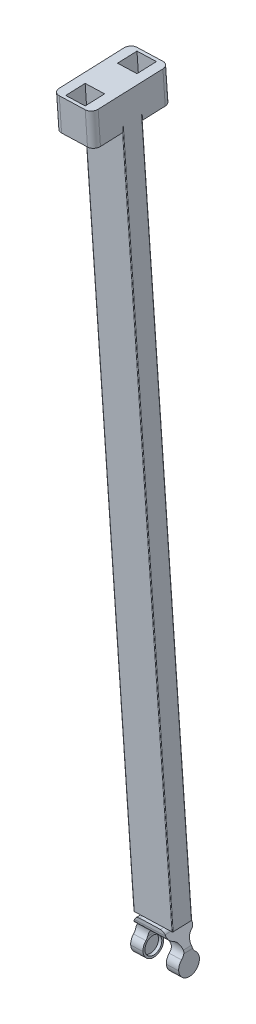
ISO-10303-21;
HEADER;
FILE_DESCRIPTION(('STEP AP214'),'2;1');
FILE_NAME('part.step','',(''),(''),'','','');
FILE_SCHEMA(('AUTOMOTIVE_DESIGN { 1 0 10303 214 1 1 1 1 }'));
ENDSEC;
DATA;
#1=APPLICATION_CONTEXT('core data for automotive mechanical design processes');
#2=APPLICATION_PROTOCOL_DEFINITION('international standard','automotive_design',2000,#1);
#3=PRODUCT_CONTEXT('',#1,'mechanical');
#4=PRODUCT('Part','Part','',(#3));
#5=PRODUCT_RELATED_PRODUCT_CATEGORY('part','',(#4));
#6=PRODUCT_DEFINITION_FORMATION('','',#4);
#7=PRODUCT_DEFINITION_CONTEXT('part definition',#1,'design');
#8=PRODUCT_DEFINITION('design','',#6,#7);
#9=PRODUCT_DEFINITION_SHAPE('','',#8);
#10=(LENGTH_UNIT() NAMED_UNIT(*) SI_UNIT(.MILLI.,.METRE.));
#11=(NAMED_UNIT(*) PLANE_ANGLE_UNIT() SI_UNIT($,.RADIAN.));
#12=(NAMED_UNIT(*) SI_UNIT($,.STERADIAN.) SOLID_ANGLE_UNIT());
#13=UNCERTAINTY_MEASURE_WITH_UNIT(LENGTH_MEASURE(1.E-05),#10,'distance_accuracy_value','');
#14=(GEOMETRIC_REPRESENTATION_CONTEXT(3) GLOBAL_UNCERTAINTY_ASSIGNED_CONTEXT((#13)) GLOBAL_UNIT_ASSIGNED_CONTEXT((#10,
#11,#12)) REPRESENTATION_CONTEXT('',''));
#15=CARTESIAN_POINT('',(0.,0.,0.));
#16=DIRECTION('',(0.,0.,1.));
#17=DIRECTION('',(1.,0.,0.));
#18=AXIS2_PLACEMENT_3D('',#15,#16,#17);
#19=CARTESIAN_POINT('',(-3.43600320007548,-212.342005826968,51.7908067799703));
#20=DIRECTION('',(0.03266075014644,-0.998728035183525,-0.0384133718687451));
#21=DIRECTION('',(-0.00125546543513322,0.0383928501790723,-0.999261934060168));
#22=AXIS2_PLACEMENT_3D('',#19,#20,#21);
#23=PLANE('',#22);
#24=DIRECTION('',(-0.00125546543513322,0.0383928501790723,-0.999261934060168));
#25=VECTOR('',#24,1.);
#26=CARTESIAN_POINT('',(-33.4199744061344,-213.322551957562,51.7908046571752));
#27=LINE('',#26,#25);
#28=CARTESIAN_POINT('',(-33.4011424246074,-213.898444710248,66.7797336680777));
#29=VERTEX_POINT('',#28);
#30=CARTESIAN_POINT('',(-33.401770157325,-213.879248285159,66.2801027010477));
#31=VERTEX_POINT('',#30);
#32=EDGE_CURVE('E1177',#29,#31,#27,.T.);
#33=ORIENTED_EDGE('',*,*,#32,.T.);
#34=CARTESIAN_POINT('',(-32.9020373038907,-213.862905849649,66.2801027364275));
#35=DIRECTION('',(-0.03266075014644,0.998728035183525,0.0384133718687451));
#36=DIRECTION('',(0.999465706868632,0.0326848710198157,7.07598368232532E-08));
#37=AXIS2_PLACEMENT_3D('',#34,#35,#36);
#38=CIRCLE('',#37,0.5);
#39=CARTESIAN_POINT('',(-32.9014095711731,-213.882102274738,66.7797337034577));
#40=VERTEX_POINT('',#39);
#41=EDGE_CURVE('E883',#31,#40,#38,.T.);
#42=ORIENTED_EDGE('',*,*,#41,.T.);
#43=DIRECTION('',(-0.999465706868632,-0.0326848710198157,-7.07598368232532E-08));
#44=VECTOR('',#43,1.);
#45=CARTESIAN_POINT('',(-33.4011424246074,-213.898444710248,66.7797336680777));
#46=LINE('',#45,#44);
#47=EDGE_CURVE('E9',#40,#29,#46,.T.);
#48=ORIENTED_EDGE('',*,*,#47,.T.);
#49=EDGE_LOOP('',(#33,#42,#48));
#50=FACE_BOUND('',#49,.T.);
#51=ADVANCED_FACE('F14',(#50),#23,.T.);
#52=CARTESIAN_POINT('',(-33.4011424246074,-213.898444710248,66.7797336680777));
#53=DIRECTION('',(0.00125546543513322,-0.0383928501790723,0.999261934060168));
#54=DIRECTION('',(0.999465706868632,0.0326848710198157,7.07598368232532E-08));
#55=AXIS2_PLACEMENT_3D('',#52,#53,#54);
#56=PLANE('',#55);
#57=DIRECTION('',(0.03266075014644,-0.998728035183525,-0.0384133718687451));
#58=VECTOR('',#57,1.);
#59=CARTESIAN_POINT('',(-32.9014095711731,-213.882102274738,66.7797337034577));
#60=LINE('',#59,#58);
#61=CARTESIAN_POINT('',(-32.7707665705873,-217.877014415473,66.6260802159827));
#62=VERTEX_POINT('',#61);
#63=EDGE_CURVE('E879',#40,#62,#60,.T.);
#64=ORIENTED_EDGE('',*,*,#63,.T.);
#65=DIRECTION('',(-0.999465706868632,-0.0326848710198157,-7.07598368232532E-08));
#66=VECTOR('',#65,1.);
#67=CARTESIAN_POINT('',(-33.2704994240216,-217.893356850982,66.6260801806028));
#68=LINE('',#67,#66);
#69=CARTESIAN_POINT('',(-33.2704994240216,-217.893356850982,66.6260801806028));
#70=VERTEX_POINT('',#69);
#71=EDGE_CURVE('E973',#62,#70,#68,.T.);
#72=ORIENTED_EDGE('',*,*,#71,.T.);
#73=DIRECTION('',(0.03266075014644,-0.998728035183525,-0.0384133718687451));
#74=VECTOR('',#73,1.);
#75=CARTESIAN_POINT('',(-33.4011424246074,-213.898444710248,66.7797336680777));
#76=LINE('',#75,#74);
#77=EDGE_CURVE('E1375',#29,#70,#76,.T.);
#78=ORIENTED_EDGE('',*,*,#77,.F.);
#79=ORIENTED_EDGE('',*,*,#47,.F.);
#80=EDGE_LOOP('',(#64,#72,#78,#79));
#81=FACE_BOUND('',#80,.T.);
#82=ADVANCED_FACE('F2141',(#81),#56,.F.);
#83=CARTESIAN_POINT('',(-33.4199744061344,-213.322551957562,51.7908046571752));
#84=DIRECTION('',(-0.00125546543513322,0.0383928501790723,-0.999261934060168));
#85=DIRECTION('',(0.03266075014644,-0.998728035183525,-0.0384133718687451));
#86=AXIS2_PLACEMENT_3D('',#83,#84,#85);
#87=PLANE('',#86);
#88=DIRECTION('',(0.03266075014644,-0.998728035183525,-0.0384133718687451));
#89=VECTOR('',#88,1.);
#90=CARTESIAN_POINT('',(-3.9357360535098,-212.358348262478,51.7908067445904));
#91=LINE('',#90,#89);
#92=CARTESIAN_POINT('',(-3.9357360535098,-212.358348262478,51.7908067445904));
#93=VERTEX_POINT('',#92);
#94=CARTESIAN_POINT('',(-3.80509305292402,-216.353260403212,51.6371532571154));
#95=VERTEX_POINT('',#94);
#96=EDGE_CURVE('E956',#93,#95,#91,.T.);
#97=ORIENTED_EDGE('',*,*,#96,.T.);
#98=DIRECTION('',(0.999465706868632,0.0326848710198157,7.07598368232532E-08));
#99=VECTOR('',#98,1.);
#100=CARTESIAN_POINT('',(-33.2893314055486,-217.317464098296,51.6371511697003));
#101=LINE('',#100,#99);
#102=CARTESIAN_POINT('',(-3.3053601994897,-216.336917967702,51.6371532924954));
#103=VERTEX_POINT('',#102);
#104=EDGE_CURVE('E922',#95,#103,#101,.T.);
#105=ORIENTED_EDGE('',*,*,#104,.T.);
#106=DIRECTION('',(0.03266075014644,-0.998728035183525,-0.0384133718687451));
#107=VECTOR('',#106,1.);
#108=CARTESIAN_POINT('',(-3.43600320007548,-212.342005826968,51.7908067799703));
#109=LINE('',#108,#107);
#110=CARTESIAN_POINT('',(-3.43600320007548,-212.342005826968,51.7908067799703));
#111=VERTEX_POINT('',#110);
#112=EDGE_CURVE('E1075',#111,#103,#109,.T.);
#113=ORIENTED_EDGE('',*,*,#112,.F.);
#114=DIRECTION('',(0.999465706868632,0.0326848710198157,7.07598368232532E-08));
#115=VECTOR('',#114,1.);
#116=CARTESIAN_POINT('',(-33.4199744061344,-213.322551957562,51.7908046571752));
#117=LINE('',#116,#115);
#118=EDGE_CURVE('E1410',#93,#111,#117,.T.);
#119=ORIENTED_EDGE('',*,*,#118,.F.);
#120=EDGE_LOOP('',(#97,#105,#113,#119));
#121=FACE_BOUND('',#120,.T.);
#122=ADVANCED_FACE('F753',(#121),#87,.F.);
#123=CARTESIAN_POINT('',(-8.32465937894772,-215.828467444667,34.1500690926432));
#124=DIRECTION('',(-0.03266075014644,0.998728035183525,0.0384133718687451));
#125=DIRECTION('',(-0.999465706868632,-0.0326848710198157,-7.07598368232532E-08));
#126=AXIS2_PLACEMENT_3D('',#123,#124,#125);
#127=CYLINDRICAL_SURFACE('',#126,5.);
#128=CARTESIAN_POINT('',(-8.32465937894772,-215.828467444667,34.1500690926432));
#129=DIRECTION('',(0.03266075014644,-0.998728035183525,-0.0384133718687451));
#130=DIRECTION('',(0.999465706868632,0.0326848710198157,7.07598368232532E-08));
#131=AXIS2_PLACEMENT_3D('',#128,#129,#130);
#132=CIRCLE('',#131,5.);
#133=CARTESIAN_POINT('',(-8.33093670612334,-215.636503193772,29.1537594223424));
#134=VERTEX_POINT('',#133);
#135=CARTESIAN_POINT('',(-3.32733084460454,-215.665043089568,34.1500694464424));
#136=VERTEX_POINT('',#135);
#137=EDGE_CURVE('E928',#134,#136,#132,.T.);
#138=ORIENTED_EDGE('',*,*,#137,.F.);
#139=DIRECTION('',(0.03266075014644,-0.998728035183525,-0.0384133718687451));
#140=VECTOR('',#139,1.);
#141=CARTESIAN_POINT('',(-8.33093670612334,-215.636503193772,29.1537594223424));
#142=LINE('',#141,#140);
#143=CARTESIAN_POINT('',(-9.14745545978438,-190.668302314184,30.114093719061));
#144=VERTEX_POINT('',#143);
#145=EDGE_CURVE('E1323',#144,#134,#142,.T.);
#146=ORIENTED_EDGE('',*,*,#145,.F.);
#147=CARTESIAN_POINT('',(-9.14117813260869,-190.860266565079,35.1104033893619));
#148=DIRECTION('',(-0.03266075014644,0.998728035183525,0.0384133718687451));
#149=DIRECTION('',(0.999465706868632,0.0326848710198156,7.07598359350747E-08));
#150=AXIS2_PLACEMENT_3D('',#147,#148,#149);
#151=CIRCLE('',#150,5.);
#152=CARTESIAN_POINT('',(-4.14384959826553,-190.69684220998,35.110403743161));
#153=VERTEX_POINT('',#152);
#154=EDGE_CURVE('E1444',#153,#144,#151,.T.);
#155=ORIENTED_EDGE('',*,*,#154,.F.);
#156=DIRECTION('',(-0.03266075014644,0.998728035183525,0.0384133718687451));
#157=VECTOR('',#156,1.);
#158=CARTESIAN_POINT('',(-3.32733084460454,-215.665043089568,34.1500694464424));
#159=LINE('',#158,#157);
#160=EDGE_CURVE('E1491',#136,#153,#159,.T.);
#161=ORIENTED_EDGE('',*,*,#160,.F.);
#162=EDGE_LOOP('',(#138,#146,#155,#161));
#163=FACE_BOUND('',#162,.T.);
#164=ADVANCED_FACE('F1862',(#163),#127,.T.);
#165=CARTESIAN_POINT('',(-8.26188610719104,-217.748109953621,84.1131657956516));
#166=DIRECTION('',(-0.03266075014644,0.998728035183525,0.0384133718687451));
#167=DIRECTION('',(-0.999465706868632,-0.0326848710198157,-7.07598368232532E-08));
#168=AXIS2_PLACEMENT_3D('',#165,#166,#167);
#169=CYLINDRICAL_SURFACE('',#168,5.);
#170=CARTESIAN_POINT('',(-8.26188610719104,-217.748109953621,84.1131657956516));
#171=DIRECTION('',(0.03266075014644,-0.998728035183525,-0.0384133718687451));
#172=DIRECTION('',(0.999465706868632,0.0326848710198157,7.07598368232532E-08));
#173=AXIS2_PLACEMENT_3D('',#170,#171,#172);
#174=CIRCLE('',#173,5.);
#175=CARTESIAN_POINT('',(-3.2645575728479,-217.584685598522,84.1131661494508));
#176=VERTEX_POINT('',#175);
#177=CARTESIAN_POINT('',(-8.25560878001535,-217.940074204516,89.1094754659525));
#178=VERTEX_POINT('',#177);
#179=EDGE_CURVE('E1439',#176,#178,#174,.T.);
#180=ORIENTED_EDGE('',*,*,#179,.F.);
#181=DIRECTION('',(0.03266075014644,-0.998728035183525,-0.0384133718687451));
#182=VECTOR('',#181,1.);
#183=CARTESIAN_POINT('',(-3.2645575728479,-217.584685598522,84.1131661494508));
#184=LINE('',#183,#182);
#185=CARTESIAN_POINT('',(-4.0810763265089,-192.616484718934,85.0735004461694));
#186=VERTEX_POINT('',#185);
#187=EDGE_CURVE('E874',#186,#176,#184,.T.);
#188=ORIENTED_EDGE('',*,*,#187,.F.);
#189=CARTESIAN_POINT('',(-9.07840486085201,-192.779909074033,85.0735000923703));
#190=DIRECTION('',(-0.03266075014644,0.998728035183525,0.0384133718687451));
#191=DIRECTION('',(0.999465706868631,0.0326848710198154,7.0759842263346E-08));
#192=AXIS2_PLACEMENT_3D('',#189,#190,#191);
#193=CIRCLE('',#192,5.);
#194=CARTESIAN_POINT('',(-9.07212753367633,-192.971873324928,90.0698097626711));
#195=VERTEX_POINT('',#194);
#196=EDGE_CURVE('E1156',#195,#186,#193,.T.);
#197=ORIENTED_EDGE('',*,*,#196,.F.);
#198=DIRECTION('',(-0.03266075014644,0.998728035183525,0.0384133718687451));
#199=VECTOR('',#198,1.);
#200=CARTESIAN_POINT('',(-8.25560878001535,-217.940074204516,89.1094754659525));
#201=LINE('',#200,#199);
#202=EDGE_CURVE('E1091',#178,#195,#201,.T.);
#203=ORIENTED_EDGE('',*,*,#202,.F.);
#204=EDGE_LOOP('',(#180,#188,#197,#203));
#205=FACE_BOUND('',#204,.T.);
#206=ADVANCED_FACE('F1856',(#205),#169,.T.);
#207=CARTESIAN_POINT('',(-28.2512002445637,-218.401807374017,84.1131643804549));
#208=DIRECTION('',(-0.03266075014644,0.998728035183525,0.0384133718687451));
#209=DIRECTION('',(-0.999465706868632,-0.0326848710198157,-7.07598368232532E-08));
#210=AXIS2_PLACEMENT_3D('',#207,#208,#209);
#211=CYLINDRICAL_SURFACE('',#210,5.);
#212=CARTESIAN_POINT('',(-28.2512002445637,-218.401807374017,84.1131643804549));
#213=DIRECTION('',(0.03266075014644,-0.998728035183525,-0.0384133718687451));
#214=DIRECTION('',(0.999465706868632,0.0326848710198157,7.07598368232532E-08));
#215=AXIS2_PLACEMENT_3D('',#212,#213,#214);
#216=CIRCLE('',#215,5.);
#217=CARTESIAN_POINT('',(-28.244922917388,-218.593771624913,89.1094740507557));
#218=VERTEX_POINT('',#217);
#219=CARTESIAN_POINT('',(-33.2485287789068,-218.565231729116,84.1131640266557));
#220=VERTEX_POINT('',#219);
#221=EDGE_CURVE('E977',#218,#220,#216,.T.);
#222=ORIENTED_EDGE('',*,*,#221,.F.);
#223=DIRECTION('',(0.03266075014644,-0.998728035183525,-0.0384133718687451));
#224=VECTOR('',#223,1.);
#225=CARTESIAN_POINT('',(-28.244922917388,-218.593771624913,89.1094740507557));
#226=LINE('',#225,#224);
#227=CARTESIAN_POINT('',(-29.061441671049,-193.625570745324,90.0698083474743));
#228=VERTEX_POINT('',#227);
#229=EDGE_CURVE('E894',#228,#218,#226,.T.);
#230=ORIENTED_EDGE('',*,*,#229,.F.);
#231=CARTESIAN_POINT('',(-29.0677189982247,-193.433606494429,85.0734986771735));
#232=DIRECTION('',(-0.03266075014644,0.998728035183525,0.0384133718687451));
#233=DIRECTION('',(0.999465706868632,0.0326848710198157,7.07598368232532E-08));
#234=AXIS2_PLACEMENT_3D('',#231,#232,#233);
#235=CIRCLE('',#234,5.);
#236=CARTESIAN_POINT('',(-34.0650475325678,-193.597030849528,85.0734983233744));
#237=VERTEX_POINT('',#236);
#238=EDGE_CURVE('E968',#237,#228,#235,.T.);
#239=ORIENTED_EDGE('',*,*,#238,.F.);
#240=DIRECTION('',(-0.03266075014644,0.998728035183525,0.0384133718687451));
#241=VECTOR('',#240,1.);
#242=CARTESIAN_POINT('',(-33.2485287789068,-218.565231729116,84.1131640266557));
#243=LINE('',#242,#241);
#244=EDGE_CURVE('E1201',#220,#237,#243,.T.);
#245=ORIENTED_EDGE('',*,*,#244,.F.);
#246=EDGE_LOOP('',(#222,#230,#239,#245));
#247=FACE_BOUND('',#246,.T.);
#248=ADVANCED_FACE('F1861',(#247),#211,.T.);
#249=CARTESIAN_POINT('',(-28.3139735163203,-216.482164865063,34.1500676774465));
#250=DIRECTION('',(-0.03266075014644,0.998728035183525,0.0384133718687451));
#251=DIRECTION('',(-0.999465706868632,-0.0326848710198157,-7.07598368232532E-08));
#252=AXIS2_PLACEMENT_3D('',#249,#250,#251);
#253=CYLINDRICAL_SURFACE('',#252,5.);
#254=CARTESIAN_POINT('',(-28.3139735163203,-216.482164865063,34.1500676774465));
#255=DIRECTION('',(0.03266075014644,-0.998728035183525,-0.0384133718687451));
#256=DIRECTION('',(0.999465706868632,0.0326848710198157,7.07598368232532E-08));
#257=AXIS2_PLACEMENT_3D('',#254,#255,#256);
#258=CIRCLE('',#257,5.);
#259=CARTESIAN_POINT('',(-33.3113020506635,-216.645589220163,34.1500673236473));
#260=VERTEX_POINT('',#259);
#261=CARTESIAN_POINT('',(-28.320250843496,-216.290200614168,29.1537580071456));
#262=VERTEX_POINT('',#261);
#263=EDGE_CURVE('E1405',#260,#262,#258,.T.);
#264=ORIENTED_EDGE('',*,*,#263,.F.);
#265=DIRECTION('',(0.03266075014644,-0.998728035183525,-0.0384133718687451));
#266=VECTOR('',#265,1.);
#267=CARTESIAN_POINT('',(-33.3113020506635,-216.645589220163,34.1500673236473));
#268=LINE('',#267,#266);
#269=CARTESIAN_POINT('',(-34.1278208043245,-191.677388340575,35.1104016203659));
#270=VERTEX_POINT('',#269);
#271=EDGE_CURVE('E1318',#270,#260,#268,.T.);
#272=ORIENTED_EDGE('',*,*,#271,.F.);
#273=CARTESIAN_POINT('',(-29.1304922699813,-191.513963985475,35.1104019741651));
#274=DIRECTION('',(-0.03266075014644,0.998728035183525,0.0384133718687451));
#275=DIRECTION('',(0.999465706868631,0.0326848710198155,7.07598377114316E-08));
#276=AXIS2_PLACEMENT_3D('',#273,#274,#275);
#277=CIRCLE('',#276,5.);
#278=CARTESIAN_POINT('',(-29.136769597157,-191.32199973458,30.1140923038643));
#279=VERTEX_POINT('',#278);
#280=EDGE_CURVE('E965',#279,#270,#277,.T.);
#281=ORIENTED_EDGE('',*,*,#280,.F.);
#282=DIRECTION('',(-0.03266075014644,0.998728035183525,0.0384133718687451));
#283=VECTOR('',#282,1.);
#284=CARTESIAN_POINT('',(-28.320250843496,-216.290200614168,29.1537580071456));
#285=LINE('',#284,#283);
#286=EDGE_CURVE('E1055',#262,#279,#285,.T.);
#287=ORIENTED_EDGE('',*,*,#286,.F.);
#288=EDGE_LOOP('',(#264,#272,#281,#287));
#289=FACE_BOUND('',#288,.T.);
#290=ADVANCED_FACE('F2110',(#289),#253,.T.);
#291=CARTESIAN_POINT('',(-11.5739304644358,-192.95760337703,87.5716547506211));
#292=DIRECTION('',(0.999465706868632,0.0326848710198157,7.07598368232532E-08));
#293=DIRECTION('',(0.00125546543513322,-0.0383928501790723,0.999261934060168));
#294=AXIS2_PLACEMENT_3D('',#291,#292,#293);
#295=PLANE('',#294);
#296=DIRECTION('',(0.00125546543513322,-0.0383928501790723,0.999261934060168));
#297=VECTOR('',#296,1.);
#298=CARTESIAN_POINT('',(-10.7574117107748,-217.925804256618,86.6113204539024));
#299=LINE('',#298,#297);
#300=CARTESIAN_POINT('',(-10.7762436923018,-217.349911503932,71.6223914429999));
#301=VERTEX_POINT('',#300);
#302=CARTESIAN_POINT('',(-10.7574117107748,-217.925804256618,86.6113204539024));
#303=VERTEX_POINT('',#302);
#304=EDGE_CURVE('E969',#301,#303,#299,.T.);
#305=ORIENTED_EDGE('',*,*,#304,.T.);
#306=DIRECTION('',(0.03266075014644,-0.998728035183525,-0.0384133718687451));
#307=VECTOR('',#306,1.);
#308=CARTESIAN_POINT('',(-11.5739304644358,-192.95760337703,87.5716547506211));
#309=LINE('',#308,#307);
#310=CARTESIAN_POINT('',(-11.5739304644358,-192.95760337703,87.5716547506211));
#311=VERTEX_POINT('',#310);
#312=EDGE_CURVE('E25',#311,#303,#309,.T.);
#313=ORIENTED_EDGE('',*,*,#312,.F.);
#314=DIRECTION('',(0.00125546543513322,-0.0383928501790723,0.999261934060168));
#315=VECTOR('',#314,1.);
#316=CARTESIAN_POINT('',(-11.5739304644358,-192.95760337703,87.5716547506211));
#317=LINE('',#316,#315);
#318=CARTESIAN_POINT('',(-11.5927624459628,-192.381710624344,72.5827257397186));
#319=VERTEX_POINT('',#318);
#320=EDGE_CURVE('E1298',#319,#311,#317,.T.);
#321=ORIENTED_EDGE('',*,*,#320,.F.);
#322=DIRECTION('',(0.03266075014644,-0.998728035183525,-0.0384133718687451));
#323=VECTOR('',#322,1.);
#324=CARTESIAN_POINT('',(-11.5927624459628,-192.381710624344,72.5827257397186));
#325=LINE('',#324,#323);
#326=EDGE_CURVE('E1218',#319,#301,#325,.T.);
#327=ORIENTED_EDGE('',*,*,#326,.T.);
#328=EDGE_LOOP('',(#305,#313,#321,#327));
#329=FACE_BOUND('',#328,.T.);
#330=ADVANCED_FACE('F1915',(#329),#295,.F.);
#331=CARTESIAN_POINT('',(-11.5739304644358,-192.95760337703,87.5716547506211));
#332=DIRECTION('',(0.00125546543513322,-0.0383928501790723,0.999261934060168));
#333=DIRECTION('',(0.999465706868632,0.0326848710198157,7.07598368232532E-08));
#334=AXIS2_PLACEMENT_3D('',#331,#332,#333);
#335=PLANE('',#334);
#336=DIRECTION('',(-0.999465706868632,-0.0326848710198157,-7.07598368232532E-08));
#337=VECTOR('',#336,1.);
#338=CARTESIAN_POINT('',(-10.7574117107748,-217.925804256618,86.6113204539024));
#339=LINE('',#338,#337);
#340=CARTESIAN_POINT('',(-25.7493973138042,-218.416077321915,86.6113193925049));
#341=VERTEX_POINT('',#340);
#342=EDGE_CURVE('E1209',#303,#341,#339,.T.);
#343=ORIENTED_EDGE('',*,*,#342,.T.);
#344=DIRECTION('',(0.03266075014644,-0.998728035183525,-0.0384133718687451));
#345=VECTOR('',#344,1.);
#346=CARTESIAN_POINT('',(-26.5659160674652,-193.447876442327,87.5716536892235));
#347=LINE('',#346,#345);
#348=CARTESIAN_POINT('',(-26.5659160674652,-193.447876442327,87.5716536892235));
#349=VERTEX_POINT('',#348);
#350=EDGE_CURVE('E1067',#349,#341,#347,.T.);
#351=ORIENTED_EDGE('',*,*,#350,.F.);
#352=DIRECTION('',(-0.999465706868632,-0.0326848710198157,-7.07598368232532E-08));
#353=VECTOR('',#352,1.);
#354=CARTESIAN_POINT('',(-11.5739304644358,-192.95760337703,87.5716547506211));
#355=LINE('',#354,#353);
#356=EDGE_CURVE('E1303',#311,#349,#355,.T.);
#357=ORIENTED_EDGE('',*,*,#356,.F.);
#358=ORIENTED_EDGE('',*,*,#312,.T.);
#359=EDGE_LOOP('',(#343,#351,#357,#358));
#360=FACE_BOUND('',#359,.T.);
#361=ADVANCED_FACE('F767',(#360),#335,.F.);
#362=CARTESIAN_POINT('',(-26.5659160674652,-193.447876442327,87.5716536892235));
#363=DIRECTION('',(-0.999465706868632,-0.0326848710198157,-7.07598368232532E-08));
#364=DIRECTION('',(0.00125546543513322,-0.0383928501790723,0.999261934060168));
#365=AXIS2_PLACEMENT_3D('',#362,#363,#364);
#366=PLANE('',#365);
#367=DIRECTION('',(-0.00125546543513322,0.0383928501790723,-0.999261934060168));
#368=VECTOR('',#367,1.);
#369=CARTESIAN_POINT('',(-25.7493973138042,-218.416077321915,86.6113193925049));
#370=LINE('',#369,#368);
#371=CARTESIAN_POINT('',(-25.7682292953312,-217.840184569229,71.6223903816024));
#372=VERTEX_POINT('',#371);
#373=EDGE_CURVE('E1213',#341,#372,#370,.T.);
#374=ORIENTED_EDGE('',*,*,#373,.T.);
#375=DIRECTION('',(0.03266075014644,-0.998728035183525,-0.0384133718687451));
#376=VECTOR('',#375,1.);
#377=CARTESIAN_POINT('',(-26.5847480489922,-192.871983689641,72.582724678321));
#378=LINE('',#377,#376);
#379=CARTESIAN_POINT('',(-26.5847480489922,-192.871983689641,72.582724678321));
#380=VERTEX_POINT('',#379);
#381=EDGE_CURVE('E1328',#380,#372,#378,.T.);
#382=ORIENTED_EDGE('',*,*,#381,.F.);
#383=DIRECTION('',(-0.00125546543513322,0.0383928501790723,-0.999261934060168));
#384=VECTOR('',#383,1.);
#385=CARTESIAN_POINT('',(-26.5659160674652,-193.447876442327,87.5716536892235));
#386=LINE('',#385,#384);
#387=EDGE_CURVE('E1430',#349,#380,#386,.T.);
#388=ORIENTED_EDGE('',*,*,#387,.F.);
#389=ORIENTED_EDGE('',*,*,#350,.T.);
#390=EDGE_LOOP('',(#374,#382,#388,#389));
#391=FACE_BOUND('',#390,.T.);
#392=ADVANCED_FACE('F755',(#391),#366,.F.);
#393=CARTESIAN_POINT('',(-11.5927624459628,-192.381710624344,72.5827257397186));
#394=DIRECTION('',(-0.00125546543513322,0.0383928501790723,-0.999261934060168));
#395=DIRECTION('',(0.03266075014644,-0.998728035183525,-0.0384133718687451));
#396=AXIS2_PLACEMENT_3D('',#393,#394,#395);
#397=PLANE('',#396);
#398=DIRECTION('',(0.999465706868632,0.0326848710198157,7.07598368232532E-08));
#399=VECTOR('',#398,1.);
#400=CARTESIAN_POINT('',(-10.7762436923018,-217.349911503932,71.6223914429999));
#401=LINE('',#400,#399);
#402=EDGE_CURVE('E976',#372,#301,#401,.T.);
#403=ORIENTED_EDGE('',*,*,#402,.T.);
#404=ORIENTED_EDGE('',*,*,#326,.F.);
#405=DIRECTION('',(0.999465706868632,0.0326848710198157,7.07598368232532E-08));
#406=VECTOR('',#405,1.);
#407=CARTESIAN_POINT('',(-11.5927624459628,-192.381710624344,72.5827257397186));
#408=LINE('',#407,#406);
#409=EDGE_CURVE('E1304',#380,#319,#408,.T.);
#410=ORIENTED_EDGE('',*,*,#409,.F.);
#411=ORIENTED_EDGE('',*,*,#381,.T.);
#412=EDGE_LOOP('',(#403,#404,#410,#411));
#413=FACE_BOUND('',#412,.T.);
#414=ADVANCED_FACE('F766',(#413),#397,.F.);
#415=CARTESIAN_POINT('',(-11.6241490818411,-191.421889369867,47.6011773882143));
#416=DIRECTION('',(0.999465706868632,0.0326848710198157,7.07598368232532E-08));
#417=DIRECTION('',(0.00125546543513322,-0.0383928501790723,0.999261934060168));
#418=AXIS2_PLACEMENT_3D('',#415,#416,#417);
#419=PLANE('',#418);
#420=DIRECTION('',(0.00125546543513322,-0.0383928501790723,0.999261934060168));
#421=VECTOR('',#420,1.);
#422=CARTESIAN_POINT('',(-10.8076303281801,-216.390090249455,46.6408430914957));
#423=LINE('',#422,#421);
#424=CARTESIAN_POINT('',(-10.8264623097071,-215.814197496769,31.6519140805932));
#425=VERTEX_POINT('',#424);
#426=CARTESIAN_POINT('',(-10.8076303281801,-216.390090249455,46.6408430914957));
#427=VERTEX_POINT('',#426);
#428=EDGE_CURVE('E937',#425,#427,#423,.T.);
#429=ORIENTED_EDGE('',*,*,#428,.T.);
#430=DIRECTION('',(0.03266075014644,-0.998728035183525,-0.0384133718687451));
#431=VECTOR('',#430,1.);
#432=CARTESIAN_POINT('',(-11.6241490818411,-191.421889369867,47.6011773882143));
#433=LINE('',#432,#431);
#434=CARTESIAN_POINT('',(-11.6241490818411,-191.421889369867,47.6011773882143));
#435=VERTEX_POINT('',#434);
#436=EDGE_CURVE('E39',#435,#427,#433,.T.);
#437=ORIENTED_EDGE('',*,*,#436,.F.);
#438=DIRECTION('',(0.00125546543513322,-0.0383928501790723,0.999261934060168));
#439=VECTOR('',#438,1.);
#440=CARTESIAN_POINT('',(-11.6241490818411,-191.421889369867,47.6011773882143));
#441=LINE('',#440,#439);
#442=CARTESIAN_POINT('',(-11.6429810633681,-190.845996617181,32.6122483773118));
#443=VERTEX_POINT('',#442);
#444=EDGE_CURVE('E1100',#443,#435,#441,.T.);
#445=ORIENTED_EDGE('',*,*,#444,.F.);
#446=DIRECTION('',(0.03266075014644,-0.998728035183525,-0.0384133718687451));
#447=VECTOR('',#446,1.);
#448=CARTESIAN_POINT('',(-11.6429810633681,-190.845996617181,32.6122483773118));
#449=LINE('',#448,#447);
#450=EDGE_CURVE('E1495',#443,#425,#449,.T.);
#451=ORIENTED_EDGE('',*,*,#450,.T.);
#452=EDGE_LOOP('',(#429,#437,#445,#451));
#453=FACE_BOUND('',#452,.T.);
#454=ADVANCED_FACE('F1891',(#453),#419,.F.);
#455=CARTESIAN_POINT('',(-11.6241490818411,-191.421889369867,47.6011773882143));
#456=DIRECTION('',(0.00125546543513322,-0.0383928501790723,0.999261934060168));
#457=DIRECTION('',(0.999465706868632,0.0326848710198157,7.07598368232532E-08));
#458=AXIS2_PLACEMENT_3D('',#455,#456,#457);
#459=PLANE('',#458);
#460=DIRECTION('',(-0.999465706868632,-0.0326848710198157,-7.07598368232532E-08));
#461=VECTOR('',#460,1.);
#462=CARTESIAN_POINT('',(-10.8076303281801,-216.390090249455,46.6408430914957));
#463=LINE('',#462,#461);
#464=CARTESIAN_POINT('',(-25.7996159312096,-216.880363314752,46.6408420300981));
#465=VERTEX_POINT('',#464);
#466=EDGE_CURVE('E932',#427,#465,#463,.T.);
#467=ORIENTED_EDGE('',*,*,#466,.T.);
#468=DIRECTION('',(0.03266075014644,-0.998728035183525,-0.0384133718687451));
#469=VECTOR('',#468,1.);
#470=CARTESIAN_POINT('',(-26.6161346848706,-191.912162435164,47.6011763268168));
#471=LINE('',#470,#469);
#472=CARTESIAN_POINT('',(-26.6161346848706,-191.912162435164,47.6011763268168));
#473=VERTEX_POINT('',#472);
#474=EDGE_CURVE('E1219',#473,#465,#471,.T.);
#475=ORIENTED_EDGE('',*,*,#474,.F.);
#476=DIRECTION('',(-0.999465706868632,-0.0326848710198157,-7.07598368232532E-08));
#477=VECTOR('',#476,1.);
#478=CARTESIAN_POINT('',(-11.6241490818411,-191.421889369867,47.6011773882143));
#479=LINE('',#478,#477);
#480=EDGE_CURVE('E1499',#435,#473,#479,.T.);
#481=ORIENTED_EDGE('',*,*,#480,.F.);
#482=ORIENTED_EDGE('',*,*,#436,.T.);
#483=EDGE_LOOP('',(#467,#475,#481,#482));
#484=FACE_BOUND('',#483,.T.);
#485=ADVANCED_FACE('F2095',(#484),#459,.F.);
#486=CARTESIAN_POINT('',(-26.6161346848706,-191.912162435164,47.6011763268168));
#487=DIRECTION('',(-0.999465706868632,-0.0326848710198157,-7.07598368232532E-08));
#488=DIRECTION('',(0.00125546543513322,-0.0383928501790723,0.999261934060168));
#489=AXIS2_PLACEMENT_3D('',#486,#487,#488);
#490=PLANE('',#489);
#491=DIRECTION('',(-0.00125546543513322,0.0383928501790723,-0.999261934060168));
#492=VECTOR('',#491,1.);
#493=CARTESIAN_POINT('',(-25.7996159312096,-216.880363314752,46.6408420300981));
#494=LINE('',#493,#492);
#495=CARTESIAN_POINT('',(-25.8184479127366,-216.304470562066,31.6519130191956));
#496=VERTEX_POINT('',#495);
#497=EDGE_CURVE('E938',#465,#496,#494,.T.);
#498=ORIENTED_EDGE('',*,*,#497,.T.);
#499=DIRECTION('',(0.03266075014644,-0.998728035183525,-0.0384133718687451));
#500=VECTOR('',#499,1.);
#501=CARTESIAN_POINT('',(-26.6349666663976,-191.336269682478,32.6122473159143));
#502=LINE('',#501,#500);
#503=CARTESIAN_POINT('',(-26.6349666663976,-191.336269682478,32.6122473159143));
#504=VERTEX_POINT('',#503);
#505=EDGE_CURVE('E890',#504,#496,#502,.T.);
#506=ORIENTED_EDGE('',*,*,#505,.F.);
#507=DIRECTION('',(-0.00125546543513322,0.0383928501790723,-0.999261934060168));
#508=VECTOR('',#507,1.);
#509=CARTESIAN_POINT('',(-26.6161346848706,-191.912162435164,47.6011763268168));
#510=LINE('',#509,#508);
#511=EDGE_CURVE('E1101',#473,#504,#510,.T.);
#512=ORIENTED_EDGE('',*,*,#511,.F.);
#513=ORIENTED_EDGE('',*,*,#474,.T.);
#514=EDGE_LOOP('',(#498,#506,#512,#513));
#515=FACE_BOUND('',#514,.T.);
#516=ADVANCED_FACE('F1929',(#515),#490,.F.);
#517=CARTESIAN_POINT('',(-11.6429810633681,-190.845996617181,32.6122483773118));
#518=DIRECTION('',(-0.00125546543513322,0.0383928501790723,-0.999261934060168));
#519=DIRECTION('',(0.03266075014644,-0.998728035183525,-0.0384133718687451));
#520=AXIS2_PLACEMENT_3D('',#517,#518,#519);
#521=PLANE('',#520);
#522=DIRECTION('',(0.999465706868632,0.0326848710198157,7.07598368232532E-08));
#523=VECTOR('',#522,1.);
#524=CARTESIAN_POINT('',(-10.8264623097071,-215.814197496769,31.6519140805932));
#525=LINE('',#524,#523);
#526=EDGE_CURVE('E927',#496,#425,#525,.T.);
#527=ORIENTED_EDGE('',*,*,#526,.T.);
#528=ORIENTED_EDGE('',*,*,#450,.F.);
#529=DIRECTION('',(0.999465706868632,0.0326848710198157,7.07598368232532E-08));
#530=VECTOR('',#529,1.);
#531=CARTESIAN_POINT('',(-11.6429810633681,-190.845996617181,32.6122483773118));
#532=LINE('',#531,#530);
#533=EDGE_CURVE('E1095',#504,#443,#532,.T.);
#534=ORIENTED_EDGE('',*,*,#533,.F.);
#535=ORIENTED_EDGE('',*,*,#505,.T.);
#536=EDGE_LOOP('',(#527,#528,#534,#535));
#537=FACE_BOUND('',#536,.T.);
#538=ADVANCED_FACE('F1924',(#537),#521,.F.);
#539=CARTESIAN_POINT('',(-4.15012692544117,-190.504877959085,30.1140940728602));
#540=DIRECTION('',(0.03266075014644,-0.998728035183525,-0.0384133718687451));
#541=DIRECTION('',(-0.00125546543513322,0.0383928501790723,-0.999261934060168));
#542=AXIS2_PLACEMENT_3D('',#539,#540,#541);
#543=PLANE('',#542);
#544=ORIENTED_EDGE('',*,*,#511,.T.);
#545=ORIENTED_EDGE('',*,*,#533,.T.);
#546=ORIENTED_EDGE('',*,*,#444,.T.);
#547=ORIENTED_EDGE('',*,*,#480,.T.);
#548=EDGE_LOOP('',(#544,#545,#546,#547));
#549=FACE_BOUND('',#548,.T.);
#550=ORIENTED_EDGE('',*,*,#387,.T.);
#551=ORIENTED_EDGE('',*,*,#409,.T.);
#552=ORIENTED_EDGE('',*,*,#320,.T.);
#553=ORIENTED_EDGE('',*,*,#356,.T.);
#554=EDGE_LOOP('',(#550,#551,#552,#553));
#555=FACE_BOUND('',#554,.T.);
#556=DIRECTION('',(0.999465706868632,0.0326848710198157,7.07598368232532E-08));
#557=VECTOR('',#556,1.);
#558=CARTESIAN_POINT('',(-34.1340981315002,-191.485424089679,30.1140919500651));
#559=LINE('',#558,#557);
#560=EDGE_CURVE('E1060',#279,#144,#559,.T.);
#561=ORIENTED_EDGE('',*,*,#560,.F.);
#562=ORIENTED_EDGE('',*,*,#280,.T.);
#563=DIRECTION('',(-0.00125546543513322,0.0383928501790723,-0.999261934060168));
#564=VECTOR('',#563,1.);
#565=CARTESIAN_POINT('',(-34.1340981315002,-191.485424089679,30.1140919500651));
#566=LINE('',#565,#564);
#567=EDGE_CURVE('E1205',#237,#270,#566,.T.);
#568=ORIENTED_EDGE('',*,*,#567,.F.);
#569=ORIENTED_EDGE('',*,*,#238,.T.);
#570=DIRECTION('',(-0.999465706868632,-0.0326848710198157,-7.07598368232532E-08));
#571=VECTOR('',#570,1.);
#572=CARTESIAN_POINT('',(-34.0587702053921,-193.788995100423,90.0698079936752));
#573=LINE('',#572,#571);
#574=EDGE_CURVE('E900',#195,#228,#573,.T.);
#575=ORIENTED_EDGE('',*,*,#574,.F.);
#576=ORIENTED_EDGE('',*,*,#196,.T.);
#577=DIRECTION('',(0.00125546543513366,-0.0383928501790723,0.999261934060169));
#578=VECTOR('',#577,1.);
#579=CARTESIAN_POINT('',(-4.15012692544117,-190.504877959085,30.1140940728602));
#580=LINE('',#579,#578);
#581=EDGE_CURVE('E1246',#153,#186,#580,.T.);
#582=ORIENTED_EDGE('',*,*,#581,.F.);
#583=ORIENTED_EDGE('',*,*,#154,.T.);
#584=EDGE_LOOP('',(#561,#562,#568,#569,#575,#576,#582,#583));
#585=FACE_BOUND('',#584,.T.);
#586=ADVANCED_FACE('F1877',(#549,#555,#585),#543,.F.);
#587=CARTESIAN_POINT('',(-3.3336081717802,-215.473078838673,29.1537597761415));
#588=DIRECTION('',(0.03266075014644,-0.998728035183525,-0.0384133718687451));
#589=DIRECTION('',(-0.00125546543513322,0.0383928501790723,-0.999261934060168));
#590=AXIS2_PLACEMENT_3D('',#587,#588,#589);
#591=PLANE('',#590);
#592=ORIENTED_EDGE('',*,*,#402,.F.);
#593=ORIENTED_EDGE('',*,*,#373,.F.);
#594=ORIENTED_EDGE('',*,*,#342,.F.);
#595=ORIENTED_EDGE('',*,*,#304,.F.);
#596=EDGE_LOOP('',(#592,#593,#594,#595));
#597=FACE_BOUND('',#596,.T.);
#598=DIRECTION('',(-0.999465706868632,-0.0326848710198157,-7.07598368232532E-08));
#599=VECTOR('',#598,1.);
#600=CARTESIAN_POINT('',(-33.2704994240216,-217.893356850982,66.6260801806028));
#601=LINE('',#600,#599);
#602=CARTESIAN_POINT('',(-3.28652821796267,-216.912810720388,66.6260823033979));
#603=VERTEX_POINT('',#602);
#604=CARTESIAN_POINT('',(-3.78626107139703,-216.929153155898,66.626082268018));
#605=VERTEX_POINT('',#604);
#606=EDGE_CURVE('E1295',#603,#605,#601,.T.);
#607=ORIENTED_EDGE('',*,*,#606,.F.);
#608=DIRECTION('',(0.00125546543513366,-0.0383928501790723,0.999261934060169));
#609=VECTOR('',#608,1.);
#610=CARTESIAN_POINT('',(-3.3336081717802,-215.473078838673,29.1537597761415));
#611=LINE('',#610,#609);
#612=EDGE_CURVE('E870',#603,#176,#611,.T.);
#613=ORIENTED_EDGE('',*,*,#612,.T.);
#614=ORIENTED_EDGE('',*,*,#179,.T.);
#615=DIRECTION('',(-0.999465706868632,-0.0326848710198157,-7.07598368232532E-08));
#616=VECTOR('',#615,1.);
#617=CARTESIAN_POINT('',(-33.2422514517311,-218.757195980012,89.1094736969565));
#618=LINE('',#617,#616);
#619=EDGE_CURVE('E899',#178,#218,#618,.T.);
#620=ORIENTED_EDGE('',*,*,#619,.T.);
#621=ORIENTED_EDGE('',*,*,#221,.T.);
#622=DIRECTION('',(-0.00125546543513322,0.0383928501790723,-0.999261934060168));
#623=VECTOR('',#622,1.);
#624=CARTESIAN_POINT('',(-33.3175793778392,-216.453624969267,29.1537576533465));
#625=LINE('',#624,#623);
#626=EDGE_CURVE('E1206',#220,#70,#625,.T.);
#627=ORIENTED_EDGE('',*,*,#626,.T.);
#628=ORIENTED_EDGE('',*,*,#71,.F.);
#629=DIRECTION('',(-0.999465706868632,-0.0326848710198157,-7.07598368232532E-08));
#630=VECTOR('',#629,1.);
#631=CARTESIAN_POINT('',(-33.2704994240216,-217.893356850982,66.6260801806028));
#632=LINE('',#631,#630);
#633=EDGE_CURVE('E1451',#605,#62,#632,.T.);
#634=ORIENTED_EDGE('',*,*,#633,.F.);
#635=EDGE_LOOP('',(#607,#613,#614,#620,#621,#627,#628,#634));
#636=FACE_BOUND('',#635,.T.);
#637=ADVANCED_FACE('F1872',(#597,#636),#591,.T.);
#638=CARTESIAN_POINT('',(-33.2422514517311,-218.757195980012,89.1094736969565));
#639=DIRECTION('',(-0.00125546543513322,0.0383928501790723,-0.999261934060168));
#640=DIRECTION('',(0.03266075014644,-0.998728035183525,-0.0384133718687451));
#641=AXIS2_PLACEMENT_3D('',#638,#639,#640);
#642=PLANE('',#641);
#643=ORIENTED_EDGE('',*,*,#574,.T.);
#644=ORIENTED_EDGE('',*,*,#229,.T.);
#645=ORIENTED_EDGE('',*,*,#619,.F.);
#646=ORIENTED_EDGE('',*,*,#202,.T.);
#647=EDGE_LOOP('',(#643,#644,#645,#646));
#648=FACE_BOUND('',#647,.T.);
#649=ADVANCED_FACE('F650',(#648),#642,.F.);
#650=CARTESIAN_POINT('',(-33.3175793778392,-216.453624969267,29.1537576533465));
#651=DIRECTION('',(0.00125546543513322,-0.0383928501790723,0.999261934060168));
#652=DIRECTION('',(0.999465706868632,0.0326848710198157,7.07598368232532E-08));
#653=AXIS2_PLACEMENT_3D('',#650,#651,#652);
#654=PLANE('',#653);
#655=DIRECTION('',(0.999465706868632,0.0326848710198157,7.07598368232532E-08));
#656=VECTOR('',#655,1.);
#657=CARTESIAN_POINT('',(-33.3175793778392,-216.453624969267,29.1537576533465));
#658=LINE('',#657,#656);
#659=EDGE_CURVE('E1409',#262,#134,#658,.T.);
#660=ORIENTED_EDGE('',*,*,#659,.F.);
#661=ORIENTED_EDGE('',*,*,#286,.T.);
#662=ORIENTED_EDGE('',*,*,#560,.T.);
#663=ORIENTED_EDGE('',*,*,#145,.T.);
#664=EDGE_LOOP('',(#660,#661,#662,#663));
#665=FACE_BOUND('',#664,.T.);
#666=ADVANCED_FACE('F2060',(#665),#654,.F.);
#667=CARTESIAN_POINT('',(-3.3336081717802,-215.473078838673,29.1537597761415));
#668=DIRECTION('',(0.03266075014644,-0.998728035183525,-0.0384133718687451));
#669=DIRECTION('',(-0.00125546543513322,0.0383928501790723,-0.999261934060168));
#670=AXIS2_PLACEMENT_3D('',#667,#668,#669);
#671=PLANE('',#670);
#672=ORIENTED_EDGE('',*,*,#526,.F.);
#673=ORIENTED_EDGE('',*,*,#497,.F.);
#674=ORIENTED_EDGE('',*,*,#466,.F.);
#675=ORIENTED_EDGE('',*,*,#428,.F.);
#676=EDGE_LOOP('',(#672,#673,#674,#675));
#677=FACE_BOUND('',#676,.T.);
#678=DIRECTION('',(0.999465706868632,0.0326848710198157,7.07598368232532E-08));
#679=VECTOR('',#678,1.);
#680=CARTESIAN_POINT('',(-33.2893314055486,-217.317464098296,51.6371511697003));
#681=LINE('',#680,#679);
#682=CARTESIAN_POINT('',(-33.2893314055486,-217.317464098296,51.6371511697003));
#683=VERTEX_POINT('',#682);
#684=CARTESIAN_POINT('',(-32.7895985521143,-217.301121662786,51.6371512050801));
#685=VERTEX_POINT('',#684);
#686=EDGE_CURVE('E882',#683,#685,#681,.T.);
#687=ORIENTED_EDGE('',*,*,#686,.F.);
#688=DIRECTION('',(-0.00125546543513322,0.0383928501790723,-0.999261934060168));
#689=VECTOR('',#688,1.);
#690=CARTESIAN_POINT('',(-33.3175793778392,-216.453624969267,29.1537576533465));
#691=LINE('',#690,#689);
#692=EDGE_CURVE('E1313',#683,#260,#691,.T.);
#693=ORIENTED_EDGE('',*,*,#692,.T.);
#694=ORIENTED_EDGE('',*,*,#263,.T.);
#695=ORIENTED_EDGE('',*,*,#659,.T.);
#696=ORIENTED_EDGE('',*,*,#137,.T.);
#697=DIRECTION('',(0.00125546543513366,-0.0383928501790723,0.999261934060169));
#698=VECTOR('',#697,1.);
#699=CARTESIAN_POINT('',(-3.3336081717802,-215.473078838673,29.1537597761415));
#700=LINE('',#699,#698);
#701=EDGE_CURVE('E1507',#136,#103,#700,.T.);
#702=ORIENTED_EDGE('',*,*,#701,.T.);
#703=ORIENTED_EDGE('',*,*,#104,.F.);
#704=DIRECTION('',(0.999465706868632,0.0326848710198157,7.07598368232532E-08));
#705=VECTOR('',#704,1.);
#706=CARTESIAN_POINT('',(-33.2893314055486,-217.317464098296,51.6371511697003));
#707=LINE('',#706,#705);
#708=EDGE_CURVE('E1140',#685,#95,#707,.T.);
#709=ORIENTED_EDGE('',*,*,#708,.F.);
#710=EDGE_LOOP('',(#687,#693,#694,#695,#696,#702,#703,#709));
#711=FACE_BOUND('',#710,.T.);
#712=ADVANCED_FACE('F16',(#677,#711),#671,.T.);
#713=CARTESIAN_POINT('',(-3.43600320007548,-212.342005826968,51.7908067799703));
#714=DIRECTION('',(0.03266075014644,-0.998728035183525,-0.0384133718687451));
#715=DIRECTION('',(-0.00125546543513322,0.0383928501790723,-0.999261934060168));
#716=AXIS2_PLACEMENT_3D('',#713,#714,#715);
#717=PLANE('',#716);
#718=DIRECTION('',(0.999465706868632,0.0326848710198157,7.07598368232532E-08));
#719=VECTOR('',#718,1.);
#720=CARTESIAN_POINT('',(-33.4199744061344,-213.322551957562,51.7908046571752));
#721=LINE('',#720,#719);
#722=CARTESIAN_POINT('',(-33.4199744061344,-213.322551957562,51.7908046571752));
#723=VERTEX_POINT('',#722);
#724=CARTESIAN_POINT('',(-32.9202415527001,-213.306209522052,51.7908046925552));
#725=VERTEX_POINT('',#724);
#726=EDGE_CURVE('E1051',#723,#725,#721,.T.);
#727=ORIENTED_EDGE('',*,*,#726,.T.);
#728=CARTESIAN_POINT('',(-32.9196138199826,-213.325405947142,52.2904356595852));
#729=DIRECTION('',(-0.03266075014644,0.998728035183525,0.0384133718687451));
#730=DIRECTION('',(0.999465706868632,0.0326848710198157,7.07598368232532E-08));
#731=AXIS2_PLACEMENT_3D('',#728,#729,#730);
#732=CIRCLE('',#731,0.5);
#733=CARTESIAN_POINT('',(-33.4193466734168,-213.341748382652,52.2904356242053));
#734=VERTEX_POINT('',#733);
#735=EDGE_CURVE('E947',#725,#734,#732,.T.);
#736=ORIENTED_EDGE('',*,*,#735,.T.);
#737=DIRECTION('',(-0.00125546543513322,0.0383928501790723,-0.999261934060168));
#738=VECTOR('',#737,1.);
#739=CARTESIAN_POINT('',(-33.4199744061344,-213.322551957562,51.7908046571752));
#740=LINE('',#739,#738);
#741=EDGE_CURVE('E1045',#734,#723,#740,.T.);
#742=ORIENTED_EDGE('',*,*,#741,.T.);
#743=EDGE_LOOP('',(#727,#736,#742));
#744=FACE_BOUND('',#743,.T.);
#745=ADVANCED_FACE('F1816',(#744),#717,.T.);
#746=CARTESIAN_POINT('',(-3.43600320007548,-212.342005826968,51.7908067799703));
#747=DIRECTION('',(0.03266075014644,-0.998728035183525,-0.0384133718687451));
#748=DIRECTION('',(-0.00125546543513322,0.0383928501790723,-0.999261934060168));
#749=AXIS2_PLACEMENT_3D('',#746,#747,#748);
#750=PLANE('',#749);
#751=DIRECTION('',(0.00125546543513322,-0.0383928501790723,0.999261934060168));
#752=VECTOR('',#751,1.);
#753=CARTESIAN_POINT('',(-3.43600320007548,-212.342005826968,51.7908067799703));
#754=LINE('',#753,#752);
#755=CARTESIAN_POINT('',(-3.43537546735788,-212.361202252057,52.2904377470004));
#756=VERTEX_POINT('',#755);
#757=EDGE_CURVE('E1070',#111,#756,#754,.T.);
#758=ORIENTED_EDGE('',*,*,#757,.T.);
#759=CARTESIAN_POINT('',(-3.9351083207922,-212.377544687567,52.2904377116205));
#760=DIRECTION('',(-0.03266075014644,0.998728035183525,0.0384133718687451));
#761=DIRECTION('',(0.999465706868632,0.0326848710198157,7.07598368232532E-08));
#762=AXIS2_PLACEMENT_3D('',#759,#760,#761);
#763=CIRCLE('',#762,0.5);
#764=EDGE_CURVE('E1197',#756,#93,#763,.T.);
#765=ORIENTED_EDGE('',*,*,#764,.T.);
#766=ORIENTED_EDGE('',*,*,#118,.T.);
#767=EDGE_LOOP('',(#758,#765,#766));
#768=FACE_BOUND('',#767,.T.);
#769=ADVANCED_FACE('F1811',(#768),#750,.T.);
#770=CARTESIAN_POINT('',(-3.43600320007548,-212.342005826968,51.7908067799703));
#771=DIRECTION('',(0.03266075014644,-0.998728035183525,-0.0384133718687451));
#772=DIRECTION('',(-0.00125546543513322,0.0383928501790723,-0.999261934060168));
#773=AXIS2_PLACEMENT_3D('',#770,#771,#772);
#774=PLANE('',#773);
#775=DIRECTION('',(-0.999465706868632,-0.0326848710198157,-7.07598368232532E-08));
#776=VECTOR('',#775,1.);
#777=CARTESIAN_POINT('',(-33.4011424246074,-213.898444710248,66.7797336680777));
#778=LINE('',#777,#776);
#779=CARTESIAN_POINT('',(-3.41717121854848,-212.917898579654,66.7797357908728));
#780=VERTEX_POINT('',#779);
#781=CARTESIAN_POINT('',(-3.91690407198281,-212.934241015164,66.7797357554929));
#782=VERTEX_POINT('',#781);
#783=EDGE_CURVE('E1427',#780,#782,#778,.T.);
#784=ORIENTED_EDGE('',*,*,#783,.T.);
#785=CARTESIAN_POINT('',(-3.91753180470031,-212.915044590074,66.2801047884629));
#786=DIRECTION('',(-0.03266075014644,0.998728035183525,0.0384133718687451));
#787=DIRECTION('',(0.999465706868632,0.0326848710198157,7.07598368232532E-08));
#788=AXIS2_PLACEMENT_3D('',#785,#786,#787);
#789=CIRCLE('',#788,0.5);
#790=CARTESIAN_POINT('',(-3.41779895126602,-212.898702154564,66.2801048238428));
#791=VERTEX_POINT('',#790);
#792=EDGE_CURVE('E865',#782,#791,#789,.T.);
#793=ORIENTED_EDGE('',*,*,#792,.T.);
#794=DIRECTION('',(0.00125546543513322,-0.0383928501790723,0.999261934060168));
#795=VECTOR('',#794,1.);
#796=CARTESIAN_POINT('',(-3.43600320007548,-212.342005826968,51.7908067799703));
#797=LINE('',#796,#795);
#798=EDGE_CURVE('E1233',#791,#780,#797,.T.);
#799=ORIENTED_EDGE('',*,*,#798,.T.);
#800=EDGE_LOOP('',(#784,#793,#799));
#801=FACE_BOUND('',#800,.T.);
#802=ADVANCED_FACE('F687',(#801),#774,.T.);
#803=CARTESIAN_POINT('',(-33.4011424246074,-213.898444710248,66.7797336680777));
#804=DIRECTION('',(0.00125546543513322,-0.0383928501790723,0.999261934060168));
#805=DIRECTION('',(0.999465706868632,0.0326848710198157,7.07598368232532E-08));
#806=AXIS2_PLACEMENT_3D('',#803,#804,#805);
#807=PLANE('',#806);
#808=ORIENTED_EDGE('',*,*,#606,.T.);
#809=DIRECTION('',(-0.03266075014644,0.998728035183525,0.0384133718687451));
#810=VECTOR('',#809,1.);
#811=CARTESIAN_POINT('',(-3.91690407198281,-212.934241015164,66.7797357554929));
#812=LINE('',#811,#810);
#813=EDGE_CURVE('E1147',#605,#782,#812,.T.);
#814=ORIENTED_EDGE('',*,*,#813,.T.);
#815=ORIENTED_EDGE('',*,*,#783,.F.);
#816=DIRECTION('',(0.03266075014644,-0.998728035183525,-0.0384133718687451));
#817=VECTOR('',#816,1.);
#818=CARTESIAN_POINT('',(-3.41717121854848,-212.917898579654,66.7797357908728));
#819=LINE('',#818,#817);
#820=EDGE_CURVE('E873',#780,#603,#819,.T.);
#821=ORIENTED_EDGE('',*,*,#820,.T.);
#822=EDGE_LOOP('',(#808,#814,#815,#821));
#823=FACE_BOUND('',#822,.T.);
#824=ADVANCED_FACE('F1944',(#823),#807,.F.);
#825=CARTESIAN_POINT('',(-33.4199744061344,-213.322551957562,51.7908046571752));
#826=DIRECTION('',(-0.00125546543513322,0.0383928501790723,-0.999261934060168));
#827=DIRECTION('',(0.03266075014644,-0.998728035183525,-0.0384133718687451));
#828=AXIS2_PLACEMENT_3D('',#825,#826,#827);
#829=PLANE('',#828);
#830=ORIENTED_EDGE('',*,*,#686,.T.);
#831=DIRECTION('',(-0.03266075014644,0.998728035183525,0.0384133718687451));
#832=VECTOR('',#831,1.);
#833=CARTESIAN_POINT('',(-32.9202415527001,-213.306209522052,51.7908046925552));
#834=LINE('',#833,#832);
#835=EDGE_CURVE('E942',#685,#725,#834,.T.);
#836=ORIENTED_EDGE('',*,*,#835,.T.);
#837=ORIENTED_EDGE('',*,*,#726,.F.);
#838=DIRECTION('',(0.03266075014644,-0.998728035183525,-0.0384133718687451));
#839=VECTOR('',#838,1.);
#840=CARTESIAN_POINT('',(-33.4199744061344,-213.322551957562,51.7908046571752));
#841=LINE('',#840,#839);
#842=EDGE_CURVE('E1107',#723,#683,#841,.T.);
#843=ORIENTED_EDGE('',*,*,#842,.T.);
#844=EDGE_LOOP('',(#830,#836,#837,#843));
#845=FACE_BOUND('',#844,.T.);
#846=ADVANCED_FACE('F1938',(#845),#829,.F.);
#847=CARTESIAN_POINT('',(-32.9020373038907,-213.862905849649,66.2801027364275));
#848=DIRECTION('',(0.03266075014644,-0.998728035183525,-0.0384133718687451));
#849=DIRECTION('',(0.999465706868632,0.0326848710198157,7.07598368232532E-08));
#850=AXIS2_PLACEMENT_3D('',#847,#848,#849);
#851=CYLINDRICAL_SURFACE('',#850,0.5);
#852=ORIENTED_EDGE('',*,*,#41,.F.);
#853=DIRECTION('',(-0.03266075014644,0.998728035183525,0.0384133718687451));
#854=VECTOR('',#853,1.);
#855=CARTESIAN_POINT('',(-33.401770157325,-213.879248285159,66.2801027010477));
#856=LINE('',#855,#854);
#857=CARTESIAN_POINT('',(-15.7649650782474,-753.192387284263,45.5368818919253));
#858=VERTEX_POINT('',#857);
#859=EDGE_CURVE('E1172',#858,#31,#856,.T.);
#860=ORIENTED_EDGE('',*,*,#859,.F.);
#861=CARTESIAN_POINT('',(-15.2652322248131,-753.176044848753,45.5368819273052));
#862=DIRECTION('',(0.03266075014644,-0.998728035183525,-0.0384133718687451));
#863=DIRECTION('',(0.999465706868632,0.0326848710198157,7.07598368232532E-08));
#864=AXIS2_PLACEMENT_3D('',#861,#862,#863);
#865=CIRCLE('',#864,0.5);
#866=CARTESIAN_POINT('',(-15.2646044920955,-753.195241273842,46.0365128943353));
#867=VERTEX_POINT('',#866);
#868=EDGE_CURVE('E866',#867,#858,#865,.T.);
#869=ORIENTED_EDGE('',*,*,#868,.F.);
#870=DIRECTION('',(0.03266075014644,-0.998728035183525,-0.0384133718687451));
#871=VECTOR('',#870,1.);
#872=CARTESIAN_POINT('',(-32.9014095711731,-213.882102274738,66.7797337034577));
#873=LINE('',#872,#871);
#874=EDGE_CURVE('E1447',#62,#867,#873,.T.);
#875=ORIENTED_EDGE('',*,*,#874,.F.);
#876=ORIENTED_EDGE('',*,*,#63,.F.);
#877=EDGE_LOOP('',(#852,#860,#869,#875,#876));
#878=FACE_BOUND('',#877,.T.);
#879=ADVANCED_FACE('F1943',(#878),#851,.T.);
#880=CARTESIAN_POINT('',(-32.9196138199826,-213.325405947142,52.2904356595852));
#881=DIRECTION('',(0.03266075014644,-0.998728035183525,-0.0384133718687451));
#882=DIRECTION('',(0.999465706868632,0.0326848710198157,7.07598368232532E-08));
#883=AXIS2_PLACEMENT_3D('',#880,#881,#882);
#884=CYLINDRICAL_SURFACE('',#883,0.5);
#885=ORIENTED_EDGE('',*,*,#735,.F.);
#886=ORIENTED_EDGE('',*,*,#835,.F.);
#887=DIRECTION('',(-0.03266075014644,0.998728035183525,0.0384133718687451));
#888=VECTOR('',#887,1.);
#889=CARTESIAN_POINT('',(-32.9202415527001,-213.306209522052,51.7908046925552));
#890=LINE('',#889,#888);
#891=CARTESIAN_POINT('',(-15.2834364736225,-752.619348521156,31.0475838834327));
#892=VERTEX_POINT('',#891);
#893=EDGE_CURVE('E1137',#892,#685,#890,.T.);
#894=ORIENTED_EDGE('',*,*,#893,.F.);
#895=CARTESIAN_POINT('',(-15.282808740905,-752.638544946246,31.5472148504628));
#896=DIRECTION('',(0.03266075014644,-0.998728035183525,-0.0384133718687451));
#897=DIRECTION('',(0.999465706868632,0.0326848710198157,7.07598368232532E-08));
#898=AXIS2_PLACEMENT_3D('',#895,#896,#897);
#899=CIRCLE('',#898,0.5);
#900=CARTESIAN_POINT('',(-15.7825415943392,-752.654887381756,31.5472148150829));
#901=VERTEX_POINT('',#900);
#902=EDGE_CURVE('E862',#901,#892,#899,.T.);
#903=ORIENTED_EDGE('',*,*,#902,.F.);
#904=DIRECTION('',(0.03266075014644,-0.998728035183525,-0.0384133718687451));
#905=VECTOR('',#904,1.);
#906=CARTESIAN_POINT('',(-33.4193466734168,-213.341748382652,52.2904356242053));
#907=LINE('',#906,#905);
#908=EDGE_CURVE('E1039',#734,#901,#907,.T.);
#909=ORIENTED_EDGE('',*,*,#908,.F.);
#910=EDGE_LOOP('',(#885,#886,#894,#903,#909));
#911=FACE_BOUND('',#910,.T.);
#912=ADVANCED_FACE('F1846',(#911),#884,.T.);
#913=CARTESIAN_POINT('',(-3.9351083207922,-212.377544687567,52.2904377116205));
#914=DIRECTION('',(0.03266075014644,-0.998728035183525,-0.0384133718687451));
#915=DIRECTION('',(0.999465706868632,0.0326848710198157,7.07598368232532E-08));
#916=AXIS2_PLACEMENT_3D('',#913,#914,#915);
#917=CYLINDRICAL_SURFACE('',#916,0.5);
#918=ORIENTED_EDGE('',*,*,#764,.F.);
#919=DIRECTION('',(-0.03266075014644,0.998728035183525,0.0384133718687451));
#920=VECTOR('',#919,1.);
#921=CARTESIAN_POINT('',(-3.43537546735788,-212.361202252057,52.2904377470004));
#922=LINE('',#921,#920);
#923=CARTESIAN_POINT('',(14.2014296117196,-751.674341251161,31.547216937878));
#924=VERTEX_POINT('',#923);
#925=EDGE_CURVE('E1076',#924,#756,#922,.T.);
#926=ORIENTED_EDGE('',*,*,#925,.F.);
#927=CARTESIAN_POINT('',(13.7016967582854,-751.690683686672,31.5472169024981));
#928=DIRECTION('',(0.03266075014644,-0.998728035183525,-0.0384133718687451));
#929=DIRECTION('',(0.999465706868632,0.0326848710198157,7.07598368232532E-08));
#930=AXIS2_PLACEMENT_3D('',#927,#928,#929);
#931=CIRCLE('',#930,0.5);
#932=CARTESIAN_POINT('',(13.7010690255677,-751.671487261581,31.047585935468));
#933=VERTEX_POINT('',#932);
#934=EDGE_CURVE('E852',#933,#924,#931,.T.);
#935=ORIENTED_EDGE('',*,*,#934,.F.);
#936=DIRECTION('',(0.03266075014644,-0.998728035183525,-0.0384133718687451));
#937=VECTOR('',#936,1.);
#938=CARTESIAN_POINT('',(-3.9357360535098,-212.358348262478,51.7908067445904));
#939=LINE('',#938,#937);
#940=EDGE_CURVE('E1442',#95,#933,#939,.T.);
#941=ORIENTED_EDGE('',*,*,#940,.F.);
#942=ORIENTED_EDGE('',*,*,#96,.F.);
#943=EDGE_LOOP('',(#918,#926,#935,#941,#942));
#944=FACE_BOUND('',#943,.T.);
#945=ADVANCED_FACE('F1841',(#944),#917,.T.);
#946=CARTESIAN_POINT('',(-3.91753180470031,-212.915044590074,66.2801047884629));
#947=DIRECTION('',(0.03266075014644,-0.998728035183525,-0.0384133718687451));
#948=DIRECTION('',(0.999465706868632,0.0326848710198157,7.07598368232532E-08));
#949=AXIS2_PLACEMENT_3D('',#946,#947,#948);
#950=CYLINDRICAL_SURFACE('',#949,0.5);
#951=ORIENTED_EDGE('',*,*,#792,.F.);
#952=ORIENTED_EDGE('',*,*,#813,.F.);
#953=DIRECTION('',(-0.03266075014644,0.998728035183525,0.0384133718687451));
#954=VECTOR('',#953,1.);
#955=CARTESIAN_POINT('',(-3.91690407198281,-212.934241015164,66.7797357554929));
#956=LINE('',#955,#954);
#957=CARTESIAN_POINT('',(13.7199010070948,-752.247380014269,46.0365149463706));
#958=VERTEX_POINT('',#957);
#959=EDGE_CURVE('E1133',#958,#605,#956,.T.);
#960=ORIENTED_EDGE('',*,*,#959,.F.);
#961=CARTESIAN_POINT('',(13.7192732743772,-752.228183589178,45.5368839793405));
#962=DIRECTION('',(0.03266075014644,-0.998728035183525,-0.0384133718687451));
#963=DIRECTION('',(0.999465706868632,0.0326848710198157,7.07598368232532E-08));
#964=AXIS2_PLACEMENT_3D('',#961,#962,#963);
#965=CIRCLE('',#964,0.5);
#966=CARTESIAN_POINT('',(14.2190061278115,-752.211841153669,45.5368840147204));
#967=VERTEX_POINT('',#966);
#968=EDGE_CURVE('E1369',#967,#958,#965,.T.);
#969=ORIENTED_EDGE('',*,*,#968,.F.);
#970=DIRECTION('',(0.03266075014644,-0.998728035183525,-0.0384133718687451));
#971=VECTOR('',#970,1.);
#972=CARTESIAN_POINT('',(-3.41779895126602,-212.898702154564,66.2801048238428));
#973=LINE('',#972,#971);
#974=EDGE_CURVE('E1274',#791,#967,#973,.T.);
#975=ORIENTED_EDGE('',*,*,#974,.F.);
#976=EDGE_LOOP('',(#951,#952,#960,#969,#975));
#977=FACE_BOUND('',#976,.T.);
#978=ADVANCED_FACE('F559',(#977),#950,.T.);
#979=CARTESIAN_POINT('',(14.2008018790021,-751.655144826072,31.0475859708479));
#980=DIRECTION('',(0.03266075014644,-0.998728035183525,-0.0384133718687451));
#981=DIRECTION('',(-0.00125546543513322,0.0383928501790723,-0.999261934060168));
#982=AXIS2_PLACEMENT_3D('',#979,#980,#981);
#983=PLANE('',#982);
#984=DIRECTION('',(-0.999465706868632,-0.0326848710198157,-7.07598368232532E-08));
#985=VECTOR('',#984,1.);
#986=CARTESIAN_POINT('',(-15.7831693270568,-752.635690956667,31.0475838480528));
#987=LINE('',#986,#985);
#988=CARTESIAN_POINT('',(-8.89454699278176,-752.410416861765,31.0475843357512));
#989=VERTEX_POINT('',#988);
#990=EDGE_CURVE('E1178',#989,#892,#987,.T.);
#991=ORIENTED_EDGE('',*,*,#990,.F.);
#992=DIRECTION('',(0.00125546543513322,-0.0383928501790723,0.999261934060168));
#993=VECTOR('',#992,1.);
#994=CARTESIAN_POINT('',(-8.89768565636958,-752.314434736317,28.5494295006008));
#995=LINE('',#994,#993);
#996=CARTESIAN_POINT('',(-8.87571501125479,-752.986309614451,46.0365133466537));
#997=VERTEX_POINT('',#996);
#998=EDGE_CURVE('E1009',#989,#997,#995,.T.);
#999=ORIENTED_EDGE('',*,*,#998,.T.);
#1000=DIRECTION('',(0.999465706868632,0.0326848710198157,7.07598368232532E-08));
#1001=VECTOR('',#1000,1.);
#1002=CARTESIAN_POINT('',(-15.7643373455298,-753.211583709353,46.0365128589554));
#1003=LINE('',#1002,#1001);
#1004=EDGE_CURVE('E1450',#867,#997,#1003,.T.);
#1005=ORIENTED_EDGE('',*,*,#1004,.F.);
#1006=ORIENTED_EDGE('',*,*,#868,.T.);
#1007=DIRECTION('',(0.00125546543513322,-0.0383928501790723,0.999261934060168));
#1008=VECTOR('',#1007,1.);
#1009=CARTESIAN_POINT('',(-15.7831693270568,-752.635690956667,31.0475838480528));
#1010=LINE('',#1009,#1008);
#1011=EDGE_CURVE('E1044',#901,#858,#1010,.T.);
#1012=ORIENTED_EDGE('',*,*,#1011,.F.);
#1013=ORIENTED_EDGE('',*,*,#902,.T.);
#1014=EDGE_LOOP('',(#991,#999,#1005,#1006,#1012,#1013));
#1015=FACE_BOUND('',#1014,.T.);
#1016=ADVANCED_FACE('F1956',(#1015),#983,.T.);
#1017=CARTESIAN_POINT('',(-3.43600320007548,-212.342005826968,51.7908067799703));
#1018=DIRECTION('',(-0.999465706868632,-0.0326848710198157,-7.07598368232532E-08));
#1019=DIRECTION('',(0.00125546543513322,-0.0383928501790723,0.999261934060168));
#1020=AXIS2_PLACEMENT_3D('',#1017,#1018,#1019);
#1021=PLANE('',#1020);
#1022=ORIENTED_EDGE('',*,*,#925,.T.);
#1023=ORIENTED_EDGE('',*,*,#757,.F.);
#1024=ORIENTED_EDGE('',*,*,#112,.T.);
#1025=ORIENTED_EDGE('',*,*,#701,.F.);
#1026=ORIENTED_EDGE('',*,*,#160,.T.);
#1027=ORIENTED_EDGE('',*,*,#581,.T.);
#1028=ORIENTED_EDGE('',*,*,#187,.T.);
#1029=ORIENTED_EDGE('',*,*,#612,.F.);
#1030=ORIENTED_EDGE('',*,*,#820,.F.);
#1031=ORIENTED_EDGE('',*,*,#798,.F.);
#1032=ORIENTED_EDGE('',*,*,#974,.T.);
#1033=DIRECTION('',(-0.00125546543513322,0.0383928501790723,-0.999261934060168));
#1034=VECTOR('',#1033,1.);
#1035=CARTESIAN_POINT('',(14.2008018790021,-751.655144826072,31.0475859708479));
#1036=LINE('',#1035,#1034);
#1037=EDGE_CURVE('E856',#967,#924,#1036,.T.);
#1038=ORIENTED_EDGE('',*,*,#1037,.T.);
#1039=EDGE_LOOP('',(#1022,#1023,#1024,#1025,#1026,#1027,#1028,#1029,#1030,#1031,#1032,#1038));
#1040=FACE_BOUND('',#1039,.T.);
#1041=ADVANCED_FACE('F561',(#1040),#1021,.F.);
#1042=CARTESIAN_POINT('',(-33.4011424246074,-213.898444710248,66.7797336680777));
#1043=DIRECTION('',(-0.00125546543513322,0.0383928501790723,-0.999261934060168));
#1044=DIRECTION('',(0.03266075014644,-0.998728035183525,-0.0384133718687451));
#1045=AXIS2_PLACEMENT_3D('',#1042,#1043,#1044);
#1046=PLANE('',#1045);
#1047=ORIENTED_EDGE('',*,*,#959,.T.);
#1048=ORIENTED_EDGE('',*,*,#633,.T.);
#1049=ORIENTED_EDGE('',*,*,#874,.T.);
#1050=ORIENTED_EDGE('',*,*,#1004,.T.);
#1051=DIRECTION('',(0.999465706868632,0.0326848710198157,7.07598368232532E-08));
#1052=VECTOR('',#1051,1.);
#1053=CARTESIAN_POINT('',(-15.7643373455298,-753.211583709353,46.0365128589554));
#1054=LINE('',#1053,#1052);
#1055=CARTESIAN_POINT('',(7.33101152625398,-752.45631167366,46.0365144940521));
#1056=VERTEX_POINT('',#1055);
#1057=EDGE_CURVE('E1185',#997,#1056,#1054,.T.);
#1058=ORIENTED_EDGE('',*,*,#1057,.T.);
#1059=DIRECTION('',(0.999465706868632,0.0326848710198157,7.07598368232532E-08));
#1060=VECTOR('',#1059,1.);
#1061=CARTESIAN_POINT('',(-15.7643373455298,-753.211583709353,46.0365128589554));
#1062=LINE('',#1061,#1060);
#1063=EDGE_CURVE('E1141',#1056,#958,#1062,.T.);
#1064=ORIENTED_EDGE('',*,*,#1063,.T.);
#1065=EDGE_LOOP('',(#1047,#1048,#1049,#1050,#1058,#1064));
#1066=FACE_BOUND('',#1065,.T.);
#1067=ADVANCED_FACE('F1978',(#1066),#1046,.F.);
#1068=CARTESIAN_POINT('',(-33.4199744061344,-213.322551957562,51.7908046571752));
#1069=DIRECTION('',(0.999465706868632,0.0326848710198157,7.07598368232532E-08));
#1070=DIRECTION('',(-0.03266075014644,0.998728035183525,0.0384133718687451));
#1071=AXIS2_PLACEMENT_3D('',#1068,#1069,#1070);
#1072=PLANE('',#1071);
#1073=ORIENTED_EDGE('',*,*,#859,.T.);
#1074=ORIENTED_EDGE('',*,*,#32,.F.);
#1075=ORIENTED_EDGE('',*,*,#77,.T.);
#1076=ORIENTED_EDGE('',*,*,#626,.F.);
#1077=ORIENTED_EDGE('',*,*,#244,.T.);
#1078=ORIENTED_EDGE('',*,*,#567,.T.);
#1079=ORIENTED_EDGE('',*,*,#271,.T.);
#1080=ORIENTED_EDGE('',*,*,#692,.F.);
#1081=ORIENTED_EDGE('',*,*,#842,.F.);
#1082=ORIENTED_EDGE('',*,*,#741,.F.);
#1083=ORIENTED_EDGE('',*,*,#908,.T.);
#1084=ORIENTED_EDGE('',*,*,#1011,.T.);
#1085=EDGE_LOOP('',(#1073,#1074,#1075,#1076,#1077,#1078,#1079,#1080,#1081,#1082,#1083,#1084));
#1086=FACE_BOUND('',#1085,.T.);
#1087=ADVANCED_FACE('F1991',(#1086),#1072,.F.);
#1088=CARTESIAN_POINT('',(-33.4199744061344,-213.322551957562,51.7908046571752));
#1089=DIRECTION('',(0.00125546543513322,-0.0383928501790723,0.999261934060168));
#1090=DIRECTION('',(0.999465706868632,0.0326848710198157,7.07598368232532E-08));
#1091=AXIS2_PLACEMENT_3D('',#1088,#1089,#1090);
#1092=PLANE('',#1091);
#1093=ORIENTED_EDGE('',*,*,#893,.T.);
#1094=ORIENTED_EDGE('',*,*,#708,.T.);
#1095=ORIENTED_EDGE('',*,*,#940,.T.);
#1096=DIRECTION('',(-0.999465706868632,-0.0326848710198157,-7.07598368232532E-08));
#1097=VECTOR('',#1096,1.);
#1098=CARTESIAN_POINT('',(-15.7831693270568,-752.635690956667,31.0475838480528));
#1099=LINE('',#1098,#1097);
#1100=CARTESIAN_POINT('',(7.31217954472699,-751.880418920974,31.0475854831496));
#1101=VERTEX_POINT('',#1100);
#1102=EDGE_CURVE('E857',#933,#1101,#1099,.T.);
#1103=ORIENTED_EDGE('',*,*,#1102,.T.);
#1104=DIRECTION('',(-0.999465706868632,-0.0326848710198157,-7.07598368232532E-08));
#1105=VECTOR('',#1104,1.);
#1106=CARTESIAN_POINT('',(-15.7831693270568,-752.635690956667,31.0475838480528));
#1107=LINE('',#1106,#1105);
#1108=EDGE_CURVE('E847',#1101,#989,#1107,.T.);
#1109=ORIENTED_EDGE('',*,*,#1108,.T.);
#1110=ORIENTED_EDGE('',*,*,#990,.T.);
#1111=EDGE_LOOP('',(#1093,#1094,#1095,#1103,#1109,#1110));
#1112=FACE_BOUND('',#1111,.T.);
#1113=ADVANCED_FACE('F1986',(#1112),#1092,.F.);
#1114=CARTESIAN_POINT('',(14.2008018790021,-751.655144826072,31.0475859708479));
#1115=DIRECTION('',(0.03266075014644,-0.998728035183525,-0.0384133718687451));
#1116=DIRECTION('',(-0.00125546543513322,0.0383928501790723,-0.999261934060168));
#1117=AXIS2_PLACEMENT_3D('',#1114,#1115,#1116);
#1118=PLANE('',#1117);
#1119=DIRECTION('',(-0.00125546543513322,0.0383928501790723,-0.999261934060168));
#1120=VECTOR('',#1119,1.);
#1121=CARTESIAN_POINT('',(7.30904088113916,-751.784436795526,28.5494306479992));
#1122=LINE('',#1121,#1120);
#1123=EDGE_CURVE('E1012',#1056,#1101,#1122,.T.);
#1124=ORIENTED_EDGE('',*,*,#1123,.T.);
#1125=ORIENTED_EDGE('',*,*,#1102,.F.);
#1126=ORIENTED_EDGE('',*,*,#934,.T.);
#1127=ORIENTED_EDGE('',*,*,#1037,.F.);
#1128=ORIENTED_EDGE('',*,*,#968,.T.);
#1129=ORIENTED_EDGE('',*,*,#1063,.F.);
#1130=EDGE_LOOP('',(#1124,#1125,#1126,#1127,#1128,#1129));
#1131=FACE_BOUND('',#1130,.T.);
#1132=ADVANCED_FACE('F774',(#1131),#1118,.T.);
#1133=CARTESIAN_POINT('',(14.2152958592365,-767.395988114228,47.9557112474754));
#1134=DIRECTION('',(0.00125546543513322,-0.0383928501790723,0.999261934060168));
#1135=DIRECTION('',(-0.999465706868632,-0.032684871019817,-7.07598368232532E-08));
#1136=AXIS2_PLACEMENT_3D('',#1133,#1134,#1135);
#1137=CYLINDRICAL_SURFACE('',#1136,4.);
#1138=CARTESIAN_POINT('',(17.5958054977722,-764.783186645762,34.963670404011));
#1139=CARTESIAN_POINT('',(17.6192439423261,-764.820822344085,34.961368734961));
#1140=CARTESIAN_POINT('',(17.6420573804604,-764.858827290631,34.9587244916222));
#1141=CARTESIAN_POINT('',(17.6863281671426,-764.935403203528,34.9527293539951));
#1142=CARTESIAN_POINT('',(17.7077895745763,-764.973972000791,34.9493807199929));
#1143=CARTESIAN_POINT('',(17.7493561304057,-765.051661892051,34.9419487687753));
#1144=CARTESIAN_POINT('',(17.7694639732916,-765.090781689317,34.9378669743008));
#1145=CARTESIAN_POINT('',(17.8083245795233,-765.169557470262,34.9289412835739));
#1146=CARTESIAN_POINT('',(17.8270785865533,-765.20921292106,34.9240981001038));
#1147=CARTESIAN_POINT('',(17.863232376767,-765.289043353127,34.9136220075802));
#1148=CARTESIAN_POINT('',(17.8806318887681,-765.329218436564,34.9079889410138));
#1149=CARTESIAN_POINT('',(17.9140777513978,-765.410070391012,34.8959055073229));
#1150=CARTESIAN_POINT('',(17.9301222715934,-765.450747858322,34.8894540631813));
#1151=CARTESIAN_POINT('',(17.9608588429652,-765.532585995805,34.8757062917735));
#1152=CARTESIAN_POINT('',(17.9755474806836,-765.573747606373,34.8684079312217));
#1153=CARTESIAN_POINT('',(18.0035742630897,-765.656534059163,34.852938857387));
#1154=CARTESIAN_POINT('',(18.0169074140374,-765.698160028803,34.8447651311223));
#1155=CARTESIAN_POINT('',(18.0420323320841,-765.781234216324,34.8276457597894));
#1156=CARTESIAN_POINT('',(18.0538384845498,-765.822679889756,34.8187088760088));
#1157=CARTESIAN_POINT('',(18.0760647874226,-765.905798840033,34.7999764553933));
#1158=CARTESIAN_POINT('',(18.0864834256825,-765.947472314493,34.7901800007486));
#1159=CARTESIAN_POINT('',(18.1059365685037,-766.031027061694,34.7697129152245));
#1160=CARTESIAN_POINT('',(18.1149680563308,-766.072908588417,34.7590404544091));
#1161=CARTESIAN_POINT('',(18.1316474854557,-766.156859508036,34.7368060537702));
#1162=CARTESIAN_POINT('',(18.1392909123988,-766.198929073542,34.7252413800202));
#1163=CARTESIAN_POINT('',(18.1531950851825,-766.283235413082,34.7012075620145));
#1164=CARTESIAN_POINT('',(18.159449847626,-766.325472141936,34.6887347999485));
#1165=CARTESIAN_POINT('',(18.1705774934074,-766.41009165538,34.6628701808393));
#1166=CARTESIAN_POINT('',(18.1754429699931,-766.452474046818,34.649473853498));
#1167=CARTESIAN_POINT('',(18.1837924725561,-766.537362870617,34.6217476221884));
#1168=CARTESIAN_POINT('',(18.1872677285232,-766.579868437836,34.6074124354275));
#1169=CARTESIAN_POINT('',(18.1928383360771,-766.664981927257,34.5777950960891));
#1170=CARTESIAN_POINT('',(18.1949236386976,-766.707588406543,34.562506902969));
#1171=CARTESIAN_POINT('',(18.196311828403,-766.75006207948,34.5468005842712));
#1172=B_SPLINE_CURVE_WITH_KNOTS('',3,(#1138,#1139,#1140,#1141,#1142,#1143,#1144,#1145,#1146,
#1147,#1148,#1149,#1150,#1151,#1152,#1153,#1154,#1155,#1156,#1157,#1158,#1159,#1160,#1161,#1162,
#1163,#1164,#1165,#1166,#1167,#1168,#1169,#1170,#1171),.UNSPECIFIED.,.F.,.F.,(4,2,2,2,2,2,2,2,2,
2,2,2,2,2,2,2,4),(0.,0.133185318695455,0.265949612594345,0.398441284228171,0.530809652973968,
0.663204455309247,0.795775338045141,0.928671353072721,1.06204046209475,1.19404390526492,
1.32619005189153,1.45861963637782,1.59147249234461,1.72488712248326,1.85900028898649,
1.99394663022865,2.12985830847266),.UNSPECIFIED.);
#1173=CARTESIAN_POINT('',(17.5958054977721,-764.783186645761,34.963670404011));
#1174=VERTEX_POINT('',#1173);
#1175=CARTESIAN_POINT('',(18.196311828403,-766.750062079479,34.5468005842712));
#1176=VERTEX_POINT('',#1175);
#1177=EDGE_CURVE('E798',#1174,#1176,#1172,.T.);
#1178=ORIENTED_EDGE('',*,*,#1177,.F.);
#1179=DIRECTION('',(-0.00125546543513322,0.0383928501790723,-0.999261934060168));
#1180=VECTOR('',#1179,1.);
#1181=CARTESIAN_POINT('',(17.595701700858,-764.780012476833,34.8810553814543));
#1182=LINE('',#1181,#1180);
#1183=CARTESIAN_POINT('',(17.6035354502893,-765.019573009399,41.11616738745));
#1184=VERTEX_POINT('',#1183);
#1185=EDGE_CURVE('E332',#1184,#1174,#1182,.T.);
#1186=ORIENTED_EDGE('',*,*,#1185,.F.);
#1187=CARTESIAN_POINT('',(18.2048962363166,-767.012578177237,41.379383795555));
#1188=CARTESIAN_POINT('',(18.2034806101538,-766.969265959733,41.36705495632));
#1189=CARTESIAN_POINT('',(18.2013764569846,-766.925854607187,41.3551501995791));
#1190=CARTESIAN_POINT('',(18.1957857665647,-766.839201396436,41.3322819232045));
#1191=CARTESIAN_POINT('',(18.1923090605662,-766.795960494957,41.3213123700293));
#1192=CARTESIAN_POINT('',(18.1839742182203,-766.709669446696,41.30029824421));
#1193=CARTESIAN_POINT('',(18.179124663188,-766.666619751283,41.2902484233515));
#1194=CARTESIAN_POINT('',(18.1680463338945,-766.580732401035,41.271056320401));
#1195=CARTESIAN_POINT('',(18.1618248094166,-766.537894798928,41.2619096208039));
#1196=CARTESIAN_POINT('',(18.1480045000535,-766.452451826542,41.2445061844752));
#1197=CARTESIAN_POINT('',(18.1404115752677,-766.409846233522,41.2362458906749));
#1198=CARTESIAN_POINT('',(18.1238504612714,-766.324886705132,41.2205973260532));
#1199=CARTESIAN_POINT('',(18.114886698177,-766.282532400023,41.2132063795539));
#1200=CARTESIAN_POINT('',(18.0955861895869,-766.1980938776,41.1992782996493));
#1201=CARTESIAN_POINT('',(18.0852524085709,-766.156009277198,41.1927393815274));
#1202=CARTESIAN_POINT('',(18.0632130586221,-766.072128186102,41.1804969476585));
#1203=CARTESIAN_POINT('',(18.0515089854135,-766.030331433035,41.1747925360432));
#1204=CARTESIAN_POINT('',(18.0264710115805,-765.946156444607,41.1640877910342));
#1205=CARTESIAN_POINT('',(18.0131077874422,-765.903784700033,41.1591049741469));
#1206=CARTESIAN_POINT('',(17.9850073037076,-765.819576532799,41.1499927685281));
#1207=CARTESIAN_POINT('',(17.9702751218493,-765.777738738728,41.1458603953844));
#1208=CARTESIAN_POINT('',(17.9394379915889,-765.694615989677,41.1384177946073));
#1209=CARTESIAN_POINT('',(17.923336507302,-765.653329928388,41.1351055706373));
#1210=CARTESIAN_POINT('',(17.8897631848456,-765.571326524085,41.1292720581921));
#1211=CARTESIAN_POINT('',(17.872293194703,-765.530608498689,41.1267497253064));
#1212=CARTESIAN_POINT('',(17.8359848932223,-765.449755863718,41.1224649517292));
#1213=CARTESIAN_POINT('',(17.8171468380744,-765.409621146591,41.1207023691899));
#1214=CARTESIAN_POINT('',(17.7781045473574,-765.329948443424,41.1179062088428));
#1215=CARTESIAN_POINT('',(17.7578990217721,-765.290411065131,41.1168733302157));
#1216=CARTESIAN_POINT('',(17.7161234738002,-765.211945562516,41.1155060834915));
#1217=CARTESIAN_POINT('',(17.6945506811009,-765.17301888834,41.1151731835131));
#1218=CARTESIAN_POINT('',(17.6500434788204,-765.095784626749,41.115175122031));
#1219=CARTESIAN_POINT('',(17.6271049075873,-765.057479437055,41.1155121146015));
#1220=CARTESIAN_POINT('',(17.6035354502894,-765.019573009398,41.11616738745));
#1221=B_SPLINE_CURVE_WITH_KNOTS('',3,(#1187,#1188,#1189,#1190,#1191,#1192,#1193,#1194,#1195,
#1196,#1197,#1198,#1199,#1200,#1201,#1202,#1203,#1204,#1205,#1206,#1207,#1208,#1209,#1210,#1211,
#1212,#1213,#1214,#1215,#1216,#1217,#1218,#1219,#1220),.UNSPECIFIED.,.F.,.F.,(4,2,2,2,2,2,2,2,2,
2,2,2,2,2,2,2,4),(0.,0.135158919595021,0.26936680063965,0.402753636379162,0.535451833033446,
0.667595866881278,0.799321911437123,0.930767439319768,1.06207080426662,1.19616144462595,
1.32977318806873,1.4630564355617,1.59616270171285,1.72924410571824,1.86245285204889,
1.99594070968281,2.12985849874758),.UNSPECIFIED.);
#1222=CARTESIAN_POINT('',(18.2048962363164,-767.012578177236,41.3793837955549));
#1223=VERTEX_POINT('',#1222);
#1224=EDGE_CURVE('E989',#1223,#1184,#1221,.T.);
#1225=ORIENTED_EDGE('',*,*,#1224,.F.);
#1226=DIRECTION('',(0.00125546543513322,-0.0383928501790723,0.999261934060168));
#1227=VECTOR('',#1226,1.);
#1228=CARTESIAN_POINT('',(18.2045728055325,-767.002687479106,41.1219557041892));
#1229=LINE('',#1228,#1227);
#1230=EDGE_CURVE('E1533',#1176,#1223,#1229,.T.);
#1231=ORIENTED_EDGE('',*,*,#1230,.F.);
#1232=EDGE_LOOP('',(#1178,#1186,#1225,#1231));
#1233=FACE_BOUND('',#1232,.T.);
#1234=ADVANCED_FACE('F769',(#1233),#1137,.T.);
#1235=CARTESIAN_POINT('',(7.43968388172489,-755.77934893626,28.3957771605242));
#1236=DIRECTION('',(-0.00125546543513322,0.0383928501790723,-0.999261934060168));
#1237=DIRECTION('',(0.999465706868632,0.0326848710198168,7.07598368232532E-08));
#1238=AXIS2_PLACEMENT_3D('',#1235,#1236,#1237);
#1239=CYLINDRICAL_SURFACE('',#1238,4.);
#1240=CARTESIAN_POINT('',(7.46479319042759,-756.547205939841,48.3810158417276));
#1241=DIRECTION('',(0.00125546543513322,-0.0383928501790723,0.999261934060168));
#1242=DIRECTION('',(0.999465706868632,0.0326848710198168,7.07598368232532E-08));
#1243=AXIS2_PLACEMENT_3D('',#1240,#1241,#1242);
#1244=CIRCLE('',#1243,4.);
#1245=CARTESIAN_POINT('',(10.8617224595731,-754.436526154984,48.4578428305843));
#1246=VERTEX_POINT('',#1245);
#1247=CARTESIAN_POINT('',(7.33415018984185,-752.552293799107,48.5346693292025));
#1248=VERTEX_POINT('',#1247);
#1249=EDGE_CURVE('E1025',#1246,#1248,#1244,.T.);
#1250=ORIENTED_EDGE('',*,*,#1249,.F.);
#1251=DIRECTION('',(0.00125546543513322,-0.0383928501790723,0.999261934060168));
#1252=VECTOR('',#1251,1.);
#1253=CARTESIAN_POINT('',(10.8617224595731,-754.436526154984,48.4578428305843));
#1254=LINE('',#1253,#1252);
#1255=CARTESIAN_POINT('',(10.8366131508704,-753.668669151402,28.4726041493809));
#1256=VERTEX_POINT('',#1255);
#1257=EDGE_CURVE('E1017',#1256,#1246,#1254,.T.);
#1258=ORIENTED_EDGE('',*,*,#1257,.F.);
#1259=CARTESIAN_POINT('',(7.43968388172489,-755.77934893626,28.3957771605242));
#1260=DIRECTION('',(-0.00125546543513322,0.0383928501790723,-0.999261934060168));
#1261=DIRECTION('',(-0.999465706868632,-0.0326848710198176,-7.0759836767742E-08));
#1262=AXIS2_PLACEMENT_3D('',#1259,#1260,#1261);
#1263=CIRCLE('',#1262,4.);
#1264=CARTESIAN_POINT('',(7.30904088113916,-751.784436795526,28.5494306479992));
#1265=VERTEX_POINT('',#1264);
#1266=EDGE_CURVE('E1114',#1265,#1256,#1263,.T.);
#1267=ORIENTED_EDGE('',*,*,#1266,.F.);
#1268=DIRECTION('',(-0.00125546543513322,0.0383928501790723,-0.999261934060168));
#1269=VECTOR('',#1268,1.);
#1270=CARTESIAN_POINT('',(7.30904088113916,-751.784436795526,28.5494306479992));
#1271=LINE('',#1270,#1269);
#1272=EDGE_CURVE('E842',#1101,#1265,#1271,.T.);
#1273=ORIENTED_EDGE('',*,*,#1272,.F.);
#1274=ORIENTED_EDGE('',*,*,#1123,.F.);
#1275=DIRECTION('',(-0.00125546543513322,0.0383928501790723,-0.999261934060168));
#1276=VECTOR('',#1275,1.);
#1277=CARTESIAN_POINT('',(7.30904088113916,-751.784436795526,28.5494306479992));
#1278=LINE('',#1277,#1276);
#1279=EDGE_CURVE('E1384',#1248,#1056,#1278,.T.);
#1280=ORIENTED_EDGE('',*,*,#1279,.F.);
#1281=EDGE_LOOP('',(#1250,#1258,#1267,#1273,#1274,#1280));
#1282=FACE_BOUND('',#1281,.T.);
#1283=ADVANCED_FACE('F773',(#1282),#1239,.T.);
#1284=CARTESIAN_POINT('',(-8.76704265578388,-756.309346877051,28.3957760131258));
#1285=DIRECTION('',(-0.00125546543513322,0.0383928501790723,-0.999261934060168));
#1286=DIRECTION('',(0.999465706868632,0.0326848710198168,7.07598368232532E-08));
#1287=AXIS2_PLACEMENT_3D('',#1284,#1285,#1286);
#1288=CYLINDRICAL_SURFACE('',#1287,4.);
#1289=CARTESIAN_POINT('',(-8.76704265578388,-756.309346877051,28.3957760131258));
#1290=DIRECTION('',(-0.00125546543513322,0.0383928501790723,-0.999261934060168));
#1291=DIRECTION('',(-0.999465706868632,-0.0326848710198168,-7.07598368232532E-08));
#1292=AXIS2_PLACEMENT_3D('',#1289,#1290,#1291);
#1293=CIRCLE('',#1292,4.);
#1294=CARTESIAN_POINT('',(-12.2946149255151,-754.425114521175,28.472602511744));
#1295=VERTEX_POINT('',#1294);
#1296=CARTESIAN_POINT('',(-8.89768565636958,-752.314434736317,28.5494295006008));
#1297=VERTEX_POINT('',#1296);
#1298=EDGE_CURVE('E1122',#1295,#1297,#1293,.T.);
#1299=ORIENTED_EDGE('',*,*,#1298,.F.);
#1300=DIRECTION('',(-0.00125546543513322,0.0383928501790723,-0.999261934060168));
#1301=VECTOR('',#1300,1.);
#1302=CARTESIAN_POINT('',(-12.2946149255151,-754.425114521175,28.472602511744));
#1303=LINE('',#1302,#1301);
#1304=CARTESIAN_POINT('',(-12.2695056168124,-755.192971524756,48.4578411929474));
#1305=VERTEX_POINT('',#1304);
#1306=EDGE_CURVE('E131',#1305,#1295,#1303,.T.);
#1307=ORIENTED_EDGE('',*,*,#1306,.F.);
#1308=CARTESIAN_POINT('',(-8.74193334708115,-757.077203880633,48.3810146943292));
#1309=DIRECTION('',(0.00125546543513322,-0.0383928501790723,0.999261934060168));
#1310=DIRECTION('',(0.999465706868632,0.0326848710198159,7.07598368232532E-08));
#1311=AXIS2_PLACEMENT_3D('',#1308,#1309,#1310);
#1312=CIRCLE('',#1311,4.);
#1313=CARTESIAN_POINT('',(-8.87257634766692,-753.082291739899,48.5346681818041));
#1314=VERTEX_POINT('',#1313);
#1315=EDGE_CURVE('E1473',#1314,#1305,#1312,.T.);
#1316=ORIENTED_EDGE('',*,*,#1315,.F.);
#1317=DIRECTION('',(0.00125546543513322,-0.0383928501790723,0.999261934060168));
#1318=VECTOR('',#1317,1.);
#1319=CARTESIAN_POINT('',(-8.87257634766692,-753.082291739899,48.5346681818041));
#1320=LINE('',#1319,#1318);
#1321=EDGE_CURVE('E1385',#997,#1314,#1320,.T.);
#1322=ORIENTED_EDGE('',*,*,#1321,.F.);
#1323=ORIENTED_EDGE('',*,*,#998,.F.);
#1324=DIRECTION('',(0.00125546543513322,-0.0383928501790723,0.999261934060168));
#1325=VECTOR('',#1324,1.);
#1326=CARTESIAN_POINT('',(-8.87257634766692,-753.082291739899,48.5346681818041));
#1327=LINE('',#1326,#1325);
#1328=EDGE_CURVE('E918',#1297,#989,#1327,.T.);
#1329=ORIENTED_EDGE('',*,*,#1328,.F.);
#1330=EDGE_LOOP('',(#1299,#1307,#1316,#1322,#1323,#1329));
#1331=FACE_BOUND('',#1330,.T.);
#1332=ADVANCED_FACE('F752',(#1331),#1288,.T.);
#1333=CARTESIAN_POINT('',(-14.7692096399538,-768.343849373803,47.9557091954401));
#1334=DIRECTION('',(-0.00125546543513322,0.0383928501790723,-0.999261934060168));
#1335=DIRECTION('',(0.999465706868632,0.032684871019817,7.07598368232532E-08));
#1336=AXIS2_PLACEMENT_3D('',#1333,#1334,#1335);
#1337=CYLINDRICAL_SURFACE('',#1336,4.);
#1338=CARTESIAN_POINT('',(-18.3054715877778,-766.193881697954,41.1161648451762));
#1339=CARTESIAN_POINT('',(-18.3263989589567,-766.233031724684,41.1155131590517));
#1340=CARTESIAN_POINT('',(-18.3466777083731,-766.272534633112,41.1151762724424));
#1341=CARTESIAN_POINT('',(-18.3858433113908,-766.352069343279,41.1151670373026));
#1342=CARTESIAN_POINT('',(-18.4047343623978,-766.392099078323,41.115492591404));
#1343=CARTESIAN_POINT('',(-18.4411252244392,-766.472675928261,41.1168372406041));
#1344=CARTESIAN_POINT('',(-18.4586278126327,-766.513221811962,41.1178549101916));
#1345=CARTESIAN_POINT('',(-18.4922439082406,-766.594817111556,41.1206123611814));
#1346=CARTESIAN_POINT('',(-18.508358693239,-766.635866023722,41.1223514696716));
#1347=CARTESIAN_POINT('',(-18.5392010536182,-766.718452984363,41.1265806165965));
#1348=CARTESIAN_POINT('',(-18.5539283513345,-766.759991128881,41.1290708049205));
#1349=CARTESIAN_POINT('',(-18.5819978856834,-766.843541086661,41.1348309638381));
#1350=CARTESIAN_POINT('',(-18.595338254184,-766.885553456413,41.1381019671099));
#1351=CARTESIAN_POINT('',(-18.6206357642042,-766.970035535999,41.1454526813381));
#1352=CARTESIAN_POINT('',(-18.6325894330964,-767.01250611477,41.1495343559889));
#1353=CARTESIAN_POINT('',(-18.6551167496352,-767.097886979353,41.1585353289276));
#1354=CARTESIAN_POINT('',(-18.6656853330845,-767.140798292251,41.1634575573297));
#1355=CARTESIAN_POINT('',(-18.6852940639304,-767.226402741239,41.1740891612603));
#1356=CARTESIAN_POINT('',(-18.694348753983,-767.26909361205,41.1797899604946));
#1357=CARTESIAN_POINT('',(-18.7110580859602,-767.354677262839,41.1920336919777));
#1358=CARTESIAN_POINT('',(-18.7187112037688,-767.397570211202,41.1985775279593));
#1359=CARTESIAN_POINT('',(-18.7326205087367,-767.48353962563,41.2125243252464));
#1360=CARTESIAN_POINT('',(-18.7388736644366,-767.526616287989,41.2199290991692));
#1361=CARTESIAN_POINT('',(-18.7499848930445,-767.612934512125,41.2356145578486));
#1362=CARTESIAN_POINT('',(-18.7548384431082,-767.656176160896,41.2438979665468));
#1363=CARTESIAN_POINT('',(-18.7631526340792,-767.742805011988,41.2613572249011));
#1364=CARTESIAN_POINT('',(-18.7666072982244,-767.786192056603,41.2705367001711));
#1365=CARTESIAN_POINT('',(-18.7721258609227,-767.873091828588,41.2898042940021));
#1366=CARTESIAN_POINT('',(-18.7741823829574,-767.916604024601,41.2998969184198));
#1367=CARTESIAN_POINT('',(-18.7769064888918,-768.003733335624,41.3210069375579));
#1368=CARTESIAN_POINT('',(-18.7775653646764,-768.047349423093,41.3320296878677));
#1369=CARTESIAN_POINT('',(-18.7774971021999,-768.134666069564,41.3550149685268));
#1370=CARTESIAN_POINT('',(-18.776760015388,-768.178365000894,41.3669836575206));
#1371=CARTESIAN_POINT('',(-18.7753349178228,-768.22191840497,41.379381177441));
#1372=B_SPLINE_CURVE_WITH_KNOTS('',3,(#1338,#1339,#1340,#1341,#1342,#1343,#1344,#1345,#1346,
#1347,#1348,#1349,#1350,#1351,#1352,#1353,#1354,#1355,#1356,#1357,#1358,#1359,#1360,#1361,#1362,
#1363,#1364,#1365,#1366,#1367,#1368,#1369,#1370,#1371),.UNSPECIFIED.,.F.,.F.,(4,2,2,2,2,2,2,2,2,
2,2,2,2,2,2,2,4),(0.,0.133185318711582,0.265949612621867,0.398441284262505,0.530809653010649,
0.663204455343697,0.795775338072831,0.928671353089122,1.06204046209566,1.19404390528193,
1.32619005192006,1.45861963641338,1.59147249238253,1.72488712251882,1.85900028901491,
1.99394663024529,2.12985830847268),.UNSPECIFIED.);
#1373=CARTESIAN_POINT('',(-18.3054715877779,-766.193881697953,41.1161648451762));
#1374=VERTEX_POINT('',#1373);
#1375=CARTESIAN_POINT('',(-18.7753349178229,-768.22191840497,41.379381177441));
#1376=VERTEX_POINT('',#1375);
#1377=EDGE_CURVE('E488',#1374,#1376,#1372,.T.);
#1378=ORIENTED_EDGE('',*,*,#1377,.F.);
#1379=DIRECTION('',(0.00125546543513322,-0.0383928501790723,0.999261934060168));
#1380=VECTOR('',#1379,1.);
#1381=CARTESIAN_POINT('',(-18.2967819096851,-766.459617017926,48.0325356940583));
#1382=LINE('',#1381,#1380);
#1383=CARTESIAN_POINT('',(-18.3132015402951,-765.957495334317,34.9636678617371));
#1384=VERTEX_POINT('',#1383);
#1385=EDGE_CURVE('E474',#1384,#1374,#1382,.T.);
#1386=ORIENTED_EDGE('',*,*,#1385,.F.);
#1387=CARTESIAN_POINT('',(-18.7839193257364,-767.959402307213,34.5467979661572));
#1388=CARTESIAN_POINT('',(-18.7853014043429,-767.917163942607,34.5624172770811));
#1389=CARTESIAN_POINT('',(-18.786003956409,-767.874749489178,34.5776230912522));
#1390=CARTESIAN_POINT('',(-18.7860209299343,-767.7899268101,34.6070867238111));
#1391=CARTESIAN_POINT('',(-18.7853450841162,-767.747520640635,34.6213504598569));
#1392=CARTESIAN_POINT('',(-18.7826047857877,-767.662736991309,34.648944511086));
#1393=CARTESIAN_POINT('',(-18.780548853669,-767.620360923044,34.6622800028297));
#1394=CARTESIAN_POINT('',(-18.7750491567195,-767.535660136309,34.6880333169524));
#1395=CARTESIAN_POINT('',(-18.7716126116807,-767.493336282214,34.7004555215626));
#1396=CARTESIAN_POINT('',(-18.7633522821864,-767.408761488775,34.7243982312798));
#1397=CARTESIAN_POINT('',(-18.7585343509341,-767.366510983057,34.7359222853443));
#1398=CARTESIAN_POINT('',(-18.7475119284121,-767.282103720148,34.7580850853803));
#1399=CARTESIAN_POINT('',(-18.7413118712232,-767.239947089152,34.768726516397));
#1400=CARTESIAN_POINT('',(-18.727526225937,-767.155747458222,34.7891408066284));
#1401=CARTESIAN_POINT('',(-18.7199436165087,-767.113704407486,34.7989154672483));
#1402=CARTESIAN_POINT('',(-18.7033928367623,-767.029751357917,34.8176131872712));
#1403=CARTESIAN_POINT('',(-18.6944261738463,-766.987841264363,34.8265371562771));
#1404=CARTESIAN_POINT('',(-18.6749061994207,-766.903282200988,34.8437318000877));
#1405=CARTESIAN_POINT('',(-18.6643232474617,-766.860636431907,34.8519845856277));
#1406=CARTESIAN_POINT('',(-18.6417534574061,-766.775722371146,34.8676016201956));
#1407=CARTESIAN_POINT('',(-18.6297717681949,-766.733453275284,34.874968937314));
#1408=CARTESIAN_POINT('',(-18.6044045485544,-766.649312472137,34.8888448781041));
#1409=CARTESIAN_POINT('',(-18.5910225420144,-766.607440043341,34.8953555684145));
#1410=CARTESIAN_POINT('',(-18.5628559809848,-766.524110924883,34.9075481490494));
#1411=CARTESIAN_POINT('',(-18.5480733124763,-766.482653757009,34.9132311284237));
#1412=CARTESIAN_POINT('',(-18.517106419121,-766.400172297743,34.9237981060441));
#1413=CARTESIAN_POINT('',(-18.5009224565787,-766.359147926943,34.928682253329));
#1414=CARTESIAN_POINT('',(-18.4671541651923,-766.277547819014,34.9376813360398));
#1415=CARTESIAN_POINT('',(-18.4495685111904,-766.236972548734,34.9417955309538));
#1416=CARTESIAN_POINT('',(-18.4129976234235,-766.156285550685,34.9492841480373));
#1417=CARTESIAN_POINT('',(-18.3940095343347,-766.116174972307,34.9526570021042));
#1418=CARTESIAN_POINT('',(-18.3546359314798,-766.036429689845,34.9586928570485));
#1419=CARTESIAN_POINT('',(-18.334246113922,-765.996796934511,34.9613535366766));
#1420=CARTESIAN_POINT('',(-18.313201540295,-765.957495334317,34.9636678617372));
#1421=B_SPLINE_CURVE_WITH_KNOTS('',3,(#1387,#1388,#1389,#1390,#1391,#1392,#1393,#1394,#1395,
#1396,#1397,#1398,#1399,#1400,#1401,#1402,#1403,#1404,#1405,#1406,#1407,#1408,#1409,#1410,#1411,
#1412,#1413,#1414,#1415,#1416,#1417,#1418,#1419,#1420),.UNSPECIFIED.,.F.,.F.,(4,2,2,2,2,2,2,2,2,
2,2,2,2,2,2,2,4),(0.,0.135158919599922,0.26936680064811,0.402753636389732,0.535451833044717,
0.667595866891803,0.799321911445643,0.930767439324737,1.06207080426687,1.1961614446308,
1.32977318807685,1.46305643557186,1.59616270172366,1.72924410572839,1.862452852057,
1.99594070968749,2.12985849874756),.UNSPECIFIED.);
#1422=CARTESIAN_POINT('',(-18.7839193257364,-767.959402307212,34.5467979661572));
#1423=VERTEX_POINT('',#1422);
#1424=EDGE_CURVE('E631',#1423,#1384,#1421,.T.);
#1425=ORIENTED_EDGE('',*,*,#1424,.F.);
#1426=DIRECTION('',(-0.00125546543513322,0.0383928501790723,-0.999261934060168));
#1427=VECTOR('',#1426,1.);
#1428=CARTESIAN_POINT('',(-18.7670724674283,-768.474588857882,47.9557089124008));
#1429=LINE('',#1428,#1427);
#1430=EDGE_CURVE('E491',#1376,#1423,#1429,.T.);
#1431=ORIENTED_EDGE('',*,*,#1430,.F.);
#1432=EDGE_LOOP('',(#1378,#1386,#1425,#1431));
#1433=FACE_BOUND('',#1432,.T.);
#1434=ADVANCED_FACE('F490',(#1433),#1337,.T.);
#1435=CARTESIAN_POINT('',(9.61720806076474,-751.708954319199,28.549430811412));
#1436=DIRECTION('',(-0.849232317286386,-0.527669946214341,-0.0192067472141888));
#1437=DIRECTION('',(-0.528017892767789,0.848581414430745,0.0332669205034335));
#1438=AXIS2_PLACEMENT_3D('',#1435,#1436,#1437);
#1439=PLANE('',#1438);
#1440=DIRECTION('',(0.528017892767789,-0.848581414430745,-0.0332669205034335));
#1441=VECTOR('',#1440,1.);
#1442=CARTESIAN_POINT('',(9.61720806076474,-751.708954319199,28.549430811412));
#1443=LINE('',#1442,#1441);
#1444=CARTESIAN_POINT('',(11.2992229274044,-754.412132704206,28.4434581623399));
#1445=VERTEX_POINT('',#1444);
#1446=EDGE_CURVE('E1110',#1256,#1445,#1443,.T.);
#1447=ORIENTED_EDGE('',*,*,#1446,.F.);
#1448=ORIENTED_EDGE('',*,*,#1257,.T.);
#1449=DIRECTION('',(-0.528017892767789,0.848581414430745,0.0332669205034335));
#1450=VECTOR('',#1449,1.);
#1451=CARTESIAN_POINT('',(9.64231736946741,-752.47681132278,48.5346694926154));
#1452=LINE('',#1451,#1450);
#1453=CARTESIAN_POINT('',(11.3243322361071,-755.179989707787,48.4286968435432));
#1454=VERTEX_POINT('',#1453);
#1455=EDGE_CURVE('E839',#1454,#1246,#1452,.T.);
#1456=ORIENTED_EDGE('',*,*,#1455,.F.);
#1457=CARTESIAN_POINT('',(13.5905531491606,-758.729831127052,45.7523765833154));
#1458=CARTESIAN_POINT('',(13.2135281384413,-758.181370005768,47.3546975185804));
#1459=CARTESIAN_POINT('',(12.3593160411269,-756.843319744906,48.3634893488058));
#1460=CARTESIAN_POINT('',(11.3243322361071,-755.179989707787,48.4286968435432));
#1461=(BOUNDED_CURVE() B_SPLINE_CURVE(3,(#1457,#1458,#1459,#1460),.UNSPECIFIED.,.F.,
.F.) B_SPLINE_CURVE_WITH_KNOTS((4,4),(0.374919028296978,1.5707963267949),
.UNSPECIFIED.) CURVE() GEOMETRIC_REPRESENTATION_ITEM() RATIONAL_B_SPLINE_CURVE((1.,
0.884331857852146,0.884331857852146,1.)) REPRESENTATION_ITEM(''));
#1462=CARTESIAN_POINT('',(13.5905531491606,-758.729831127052,45.7523765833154));
#1463=VERTEX_POINT('',#1462);
#1464=EDGE_CURVE('E319',#1463,#1454,#1461,.T.);
#1465=ORIENTED_EDGE('',*,*,#1464,.F.);
#1466=CARTESIAN_POINT('',(17.6035354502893,-765.019573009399,41.11616738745));
#1467=CARTESIAN_POINT('',(15.776013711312,-762.08020685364,41.1669484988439));
#1468=CARTESIAN_POINT('',(14.2564089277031,-759.698456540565,42.9225519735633));
#1469=CARTESIAN_POINT('',(13.5905531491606,-758.729831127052,45.7523765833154));
#1470=(BOUNDED_CURVE() B_SPLINE_CURVE(3,(#1466,#1467,#1468,#1469),.UNSPECIFIED.,.F.,
.F.) B_SPLINE_CURVE_WITH_KNOTS((4,4),(1.54931291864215,2.76667362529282),
.UNSPECIFIED.) CURVE() GEOMETRIC_REPRESENTATION_ITEM() RATIONAL_B_SPLINE_CURVE((1.,
0.880268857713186,0.880268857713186,1.)) REPRESENTATION_ITEM(''));
#1471=EDGE_CURVE('E1550',#1184,#1463,#1470,.T.);
#1472=ORIENTED_EDGE('',*,*,#1471,.F.);
#1473=ORIENTED_EDGE('',*,*,#1185,.T.);
#1474=CARTESIAN_POINT('',(17.5051326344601,-764.637523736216,34.9709796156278));
#1475=CARTESIAN_POINT('',(17.5353604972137,-764.686103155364,34.9690751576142));
#1476=CARTESIAN_POINT('',(17.5655859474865,-764.734659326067,34.9666386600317));
#1477=CARTESIAN_POINT('',(17.5958054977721,-764.783186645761,34.963670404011));
#1478=(BOUNDED_CURVE() B_SPLINE_CURVE(3,(#1474,#1475,#1476,#1477),.UNSPECIFIED.,.F.,
.F.) B_SPLINE_CURVE_WITH_KNOTS((4,4),(4.71238898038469,4.73387238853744),
.UNSPECIFIED.) CURVE() GEOMETRIC_REPRESENTATION_ITEM() RATIONAL_B_SPLINE_CURVE((1.,
0.999961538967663,0.999961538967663,1.)) REPRESENTATION_ITEM(''));
#1479=CARTESIAN_POINT('',(17.5051326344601,-764.637523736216,34.9709796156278));
#1480=VERTEX_POINT('',#1479);
#1481=EDGE_CURVE('E789',#1480,#1174,#1478,.T.);
#1482=ORIENTED_EDGE('',*,*,#1481,.F.);
#1483=CARTESIAN_POINT('',(13.5718095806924,-758.156642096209,30.8338181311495));
#1484=CARTESIAN_POINT('',(14.2312175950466,-759.315828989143,33.5244085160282));
#1485=CARTESIAN_POINT('',(15.7138145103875,-761.758683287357,35.0838387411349));
#1486=CARTESIAN_POINT('',(17.5051326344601,-764.637523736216,34.9709796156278));
#1487=(BOUNDED_CURVE() B_SPLINE_CURVE(3,(#1483,#1484,#1485,#1486),.UNSPECIFIED.,.F.,
.F.) B_SPLINE_CURVE_WITH_KNOTS((4,4),(3.51651168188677,4.71238898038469),
.UNSPECIFIED.) CURVE() GEOMETRIC_REPRESENTATION_ITEM() RATIONAL_B_SPLINE_CURVE((1.,
0.884331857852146,0.884331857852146,1.)) REPRESENTATION_ITEM(''));
#1488=CARTESIAN_POINT('',(13.5718095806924,-758.156642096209,30.8338181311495));
#1489=VERTEX_POINT('',#1488);
#1490=EDGE_CURVE('E1080',#1489,#1480,#1487,.T.);
#1491=ORIENTED_EDGE('',*,*,#1490,.F.);
#1492=CARTESIAN_POINT('',(11.2992229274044,-754.412132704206,28.4434581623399));
#1493=CARTESIAN_POINT('',(12.3342067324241,-756.075462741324,28.3782506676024));
#1494=CARTESIAN_POINT('',(13.1908182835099,-757.486889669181,29.2792547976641));
#1495=CARTESIAN_POINT('',(13.5718095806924,-758.156642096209,30.8338181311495));
#1496=(BOUNDED_CURVE() B_SPLINE_CURVE(3,(#1492,#1493,#1494,#1495),.UNSPECIFIED.,.F.,
.F.) B_SPLINE_CURVE_WITH_KNOTS((4,4),(4.71238898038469,5.90826627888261),
.UNSPECIFIED.) CURVE() GEOMETRIC_REPRESENTATION_ITEM() RATIONAL_B_SPLINE_CURVE((1.,
0.884331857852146,0.884331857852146,1.)) REPRESENTATION_ITEM(''));
#1497=EDGE_CURVE('E1359',#1445,#1489,#1496,.T.);
#1498=ORIENTED_EDGE('',*,*,#1497,.F.);
#1499=EDGE_LOOP('',(#1447,#1448,#1456,#1465,#1472,#1473,#1482,#1491,#1498));
#1500=FACE_BOUND('',#1499,.T.);
#1501=ADVANCED_FACE('F751',(#1500),#1439,.F.);
#1502=CARTESIAN_POINT('',(-18.802078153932,-767.404155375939,47.9968802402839));
#1503=DIRECTION('',(-0.881893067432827,0.471058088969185,0.0192066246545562));
#1504=DIRECTION('',(0.00125546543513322,-0.0383928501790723,0.999261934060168));
#1505=AXIS2_PLACEMENT_3D('',#1502,#1503,#1504);
#1506=PLANE('',#1505);
#1507=CARTESIAN_POINT('',(-18.3132015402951,-765.957495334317,34.9636678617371));
#1508=CARTESIAN_POINT('',(-18.2862170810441,-765.907097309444,34.9666361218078));
#1509=CARTESIAN_POINT('',(-18.2592286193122,-765.856670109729,34.9690726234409));
#1510=CARTESIAN_POINT('',(-18.2322392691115,-765.806219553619,34.9709770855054));
#1511=(BOUNDED_CURVE() B_SPLINE_CURVE(3,(#1507,#1508,#1509,#1510),.UNSPECIFIED.,.F.,
.F.) B_SPLINE_CURVE_WITH_KNOTS((4,4),(4.69090557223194,4.71238898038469),
.UNSPECIFIED.) CURVE() GEOMETRIC_REPRESENTATION_ITEM() RATIONAL_B_SPLINE_CURVE((1.,
0.999961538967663,0.999961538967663,1.)) REPRESENTATION_ITEM(''));
#1512=CARTESIAN_POINT('',(-18.2322392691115,-765.806219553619,34.9709770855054));
#1513=VERTEX_POINT('',#1512);
#1514=EDGE_CURVE('E481',#1384,#1513,#1511,.T.);
#1515=ORIENTED_EDGE('',*,*,#1514,.F.);
#1516=ORIENTED_EDGE('',*,*,#1385,.T.);
#1517=CARTESIAN_POINT('',(-14.7120032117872,-759.65539105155,45.7523745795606));
#1518=CARTESIAN_POINT('',(-15.3131509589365,-760.665450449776,42.9225498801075));
#1519=CARTESIAN_POINT('',(-16.6738974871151,-763.141395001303,41.166946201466));
#1520=CARTESIAN_POINT('',(-18.3054715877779,-766.193881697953,41.1161648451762));
#1521=(BOUNDED_CURVE() B_SPLINE_CURVE(3,(#1517,#1518,#1519,#1520),.UNSPECIFIED.,.F.,
.F.) B_SPLINE_CURVE_WITH_KNOTS((4,4),(0.374919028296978,1.59227973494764),
.UNSPECIFIED.) CURVE() GEOMETRIC_REPRESENTATION_ITEM() RATIONAL_B_SPLINE_CURVE((1.,
0.880268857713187,0.880268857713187,1.)) REPRESENTATION_ITEM(''));
#1522=CARTESIAN_POINT('',(-14.7120032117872,-759.65539105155,45.7523745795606));
#1523=VERTEX_POINT('',#1522);
#1524=EDGE_CURVE('E479',#1523,#1374,#1521,.T.);
#1525=ORIENTED_EDGE('',*,*,#1524,.F.);
#1526=CARTESIAN_POINT('',(-12.6825529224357,-755.965071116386,48.4286951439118));
#1527=CARTESIAN_POINT('',(-13.6066520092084,-757.692467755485,48.3634875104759));
#1528=CARTESIAN_POINT('',(-14.3716175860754,-759.083468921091,47.3546955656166));
#1529=CARTESIAN_POINT('',(-14.7120032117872,-759.65539105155,45.7523745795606));
#1530=(BOUNDED_CURVE() B_SPLINE_CURVE(3,(#1526,#1527,#1528,#1529),.UNSPECIFIED.,.F.,
.F.) B_SPLINE_CURVE_WITH_KNOTS((4,4),(1.5707963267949,2.76667362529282),
.UNSPECIFIED.) CURVE() GEOMETRIC_REPRESENTATION_ITEM() RATIONAL_B_SPLINE_CURVE((1.,
0.884331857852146,0.884331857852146,1.)) REPRESENTATION_ITEM(''));
#1531=CARTESIAN_POINT('',(-12.6825529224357,-755.965071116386,48.4286951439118));
#1532=VERTEX_POINT('',#1531);
#1533=EDGE_CURVE('E1363',#1532,#1523,#1530,.T.);
#1534=ORIENTED_EDGE('',*,*,#1533,.F.);
#1535=DIRECTION('',(-0.471447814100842,-0.88126628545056,-0.0332669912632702));
#1536=VECTOR('',#1535,1.);
#1537=CARTESIAN_POINT('',(-18.802078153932,-767.404155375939,47.9968802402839));
#1538=LINE('',#1537,#1536);
#1539=EDGE_CURVE('E1469',#1305,#1532,#1538,.T.);
#1540=ORIENTED_EDGE('',*,*,#1539,.F.);
#1541=ORIENTED_EDGE('',*,*,#1306,.T.);
#1542=DIRECTION('',(0.471447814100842,0.88126628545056,0.0332669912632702));
#1543=VECTOR('',#1542,1.);
#1544=CARTESIAN_POINT('',(-18.8271874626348,-766.636298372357,28.0116415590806));
#1545=LINE('',#1544,#1543);
#1546=CARTESIAN_POINT('',(-12.7076622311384,-755.197214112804,28.4434564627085));
#1547=VERTEX_POINT('',#1546);
#1548=EDGE_CURVE('E1125',#1547,#1295,#1545,.T.);
#1549=ORIENTED_EDGE('',*,*,#1548,.F.);
#1550=CARTESIAN_POINT('',(-14.7307467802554,-759.082202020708,30.8338161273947));
#1551=CARTESIAN_POINT('',(-14.3943274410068,-758.388988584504,29.2792528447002));
#1552=CARTESIAN_POINT('',(-13.6317613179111,-756.924610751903,28.3782488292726));
#1553=CARTESIAN_POINT('',(-12.7076622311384,-755.197214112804,28.4434564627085));
#1554=(BOUNDED_CURVE() B_SPLINE_CURVE(3,(#1550,#1551,#1552,#1553),.UNSPECIFIED.,.F.,
.F.) B_SPLINE_CURVE_WITH_KNOTS((4,4),(3.51651168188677,4.71238898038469),
.UNSPECIFIED.) CURVE() GEOMETRIC_REPRESENTATION_ITEM() RATIONAL_B_SPLINE_CURVE((1.,
0.884331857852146,0.884331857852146,1.)) REPRESENTATION_ITEM(''));
#1555=CARTESIAN_POINT('',(-14.7307467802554,-759.082202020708,30.8338161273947));
#1556=VERTEX_POINT('',#1555);
#1557=EDGE_CURVE('E148',#1556,#1547,#1554,.T.);
#1558=ORIENTED_EDGE('',*,*,#1557,.F.);
#1559=CARTESIAN_POINT('',(-18.2322392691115,-765.806219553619,34.9709770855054));
#1560=CARTESIAN_POINT('',(-16.6328370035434,-762.816494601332,35.0838364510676));
#1561=CARTESIAN_POINT('',(-15.3130110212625,-760.281994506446,33.5244064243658));
#1562=CARTESIAN_POINT('',(-14.7307467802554,-759.082202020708,30.8338161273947));
#1563=(BOUNDED_CURVE() B_SPLINE_CURVE(3,(#1559,#1560,#1561,#1562),.UNSPECIFIED.,.F.,
.F.) B_SPLINE_CURVE_WITH_KNOTS((4,4),(4.71238898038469,5.90826627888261),
.UNSPECIFIED.) CURVE() GEOMETRIC_REPRESENTATION_ITEM() RATIONAL_B_SPLINE_CURVE((1.,
0.884331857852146,0.884331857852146,1.)) REPRESENTATION_ITEM(''));
#1564=EDGE_CURVE('E1335',#1513,#1556,#1563,.T.);
#1565=ORIENTED_EDGE('',*,*,#1564,.F.);
#1566=EDGE_LOOP('',(#1515,#1516,#1525,#1534,#1540,#1541,#1549,#1558,#1565));
#1567=FACE_BOUND('',#1566,.T.);
#1568=ADVANCED_FACE('F476',(#1567),#1506,.T.);
#1569=CARTESIAN_POINT('',(-19.1742477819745,-756.023629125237,44.4316469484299));
#1570=DIRECTION('',(0.999465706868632,0.0326848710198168,7.07598368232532E-08));
#1571=DIRECTION('',(0.00125546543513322,-0.0383928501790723,0.999261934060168));
#1572=AXIS2_PLACEMENT_3D('',#1569,#1570,#1571);
#1573=CYLINDRICAL_SURFACE('',#1572,4.);
#1574=DIRECTION('',(0.999465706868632,0.0326848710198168,7.07598368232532E-08));
#1575=VECTOR('',#1574,1.);
#1576=CARTESIAN_POINT('',(-19.1692259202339,-756.177200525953,48.4286946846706));
#1577=LINE('',#1576,#1575);
#1578=EDGE_CURVE('E1472',#1532,#1454,#1577,.T.);
#1579=ORIENTED_EDGE('',*,*,#1578,.F.);
#1580=ORIENTED_EDGE('',*,*,#1533,.T.);
#1581=DIRECTION('',(-0.999465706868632,-0.0326848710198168,-7.07598368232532E-08));
#1582=VECTOR('',#1581,1.);
#1583=CARTESIAN_POINT('',(-19.0508406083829,-759.797281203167,45.752374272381));
#1584=LINE('',#1583,#1582);
#1585=EDGE_CURVE('E503',#1463,#1523,#1584,.T.);
#1586=ORIENTED_EDGE('',*,*,#1585,.F.);
#1587=ORIENTED_EDGE('',*,*,#1464,.T.);
#1588=EDGE_LOOP('',(#1579,#1580,#1586,#1587));
#1589=FACE_BOUND('',#1588,.T.);
#1590=ADVANCED_FACE('F1794',(#1589),#1573,.T.);
#1591=CARTESIAN_POINT('',(-19.1893133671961,-755.562914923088,32.4405037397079));
#1592=DIRECTION('',(0.999465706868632,0.0326848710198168,7.07598368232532E-08));
#1593=DIRECTION('',(0.00125546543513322,-0.0383928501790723,0.999261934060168));
#1594=AXIS2_PLACEMENT_3D('',#1591,#1592,#1593);
#1595=CYLINDRICAL_SURFACE('',#1594,4.);
#1596=DIRECTION('',(0.999465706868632,0.0326848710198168,7.07598368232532E-08));
#1597=VECTOR('',#1596,1.);
#1598=CARTESIAN_POINT('',(-19.069584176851,-759.224092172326,30.8338158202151));
#1599=LINE('',#1598,#1597);
#1600=EDGE_CURVE('E1084',#1556,#1489,#1599,.T.);
#1601=ORIENTED_EDGE('',*,*,#1600,.F.);
#1602=ORIENTED_EDGE('',*,*,#1557,.T.);
#1603=DIRECTION('',(-0.999465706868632,-0.0326848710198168,-7.07598368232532E-08));
#1604=VECTOR('',#1603,1.);
#1605=CARTESIAN_POINT('',(-19.1943352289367,-755.409343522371,28.4434560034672));
#1606=LINE('',#1605,#1604);
#1607=EDGE_CURVE('E1113',#1445,#1547,#1606,.T.);
#1608=ORIENTED_EDGE('',*,*,#1607,.F.);
#1609=ORIENTED_EDGE('',*,*,#1497,.T.);
#1610=EDGE_LOOP('',(#1601,#1602,#1608,#1609));
#1611=FACE_BOUND('',#1610,.T.);
#1612=ADVANCED_FACE('F648',(#1611),#1595,.T.);
#1613=CARTESIAN_POINT('',(-8.44541978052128,-793.444506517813,56.9907525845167));
#1614=DIRECTION('',(-0.999465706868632,-0.0326848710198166,-7.07598368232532E-08));
#1615=DIRECTION('',(-0.0326607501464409,0.998728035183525,0.0384133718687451));
#1616=AXIS2_PLACEMENT_3D('',#1613,#1614,#1615);
#1617=PLANE('',#1616);
#1618=CARTESIAN_POINT('',(-8.99310109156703,-776.697000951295,37.6201278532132));
#1619=DIRECTION('',(-0.999465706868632,-0.0326848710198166,-7.07598368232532E-08));
#1620=DIRECTION('',(-0.000253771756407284,0.00775788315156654,0.999969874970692));
#1621=AXIS2_PLACEMENT_3D('',#1618,#1619,#1620);
#1622=CIRCLE('',#1621,6.5);
#1623=CARTESIAN_POINT('',(-8.99475060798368,-776.64657471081,44.1199320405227));
#1624=VERTEX_POINT('',#1623);
#1625=EDGE_CURVE('E1389',#1624,#1624,#1622,.F.);
#1626=ORIENTED_EDGE('',*,*,#1625,.F.);
#1627=EDGE_LOOP('',(#1626));
#1628=FACE_BOUND('',#1627,.T.);
#1629=DIRECTION('',(-0.00125546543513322,0.0383928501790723,-0.999261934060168));
#1630=VECTOR('',#1629,1.);
#1631=CARTESIAN_POINT('',(-9.22927778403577,-769.475033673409,57.9126735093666));
#1632=LINE('',#1631,#1630);
#1633=CARTESIAN_POINT('',(-9.24961850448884,-768.853002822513,41.7228947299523));
#1634=VERTEX_POINT('',#1633);
#1635=CARTESIAN_POINT('',(-9.2591556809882,-768.56135051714,34.1319749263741));
#1636=VERTEX_POINT('',#1635);
#1637=EDGE_CURVE('E1564',#1634,#1636,#1632,.T.);
#1638=ORIENTED_EDGE('',*,*,#1637,.F.);
#1639=CARTESIAN_POINT('',(-9.34232705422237,-766.018095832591,48.0382491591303));
#1640=DIRECTION('',(0.999465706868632,0.0326848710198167,7.07598368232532E-08));
#1641=DIRECTION('',(-0.0326607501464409,0.998728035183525,0.0384133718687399));
#1642=AXIS2_PLACEMENT_3D('',#1639,#1640,#1641);
#1643=CIRCLE('',#1642,6.92307692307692);
#1644=CARTESIAN_POINT('',(-9.18031500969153,-770.972227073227,43.2051000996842));
#1645=VERTEX_POINT('',#1644);
#1646=EDGE_CURVE('E497',#1645,#1634,#1643,.T.);
#1647=ORIENTED_EDGE('',*,*,#1646,.F.);
#1648=CARTESIAN_POINT('',(-8.99310109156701,-776.697000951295,37.6201278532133));
#1649=DIRECTION('',(-0.999465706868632,-0.0326848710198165,-7.07598368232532E-08));
#1650=DIRECTION('',(-0.0326607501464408,0.998728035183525,0.0384133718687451));
#1651=AXIS2_PLACEMENT_3D('',#1648,#1649,#1650);
#1652=CIRCLE('',#1651,8.);
#1653=CARTESIAN_POINT('',(-8.98305736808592,-777.004143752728,45.6142233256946));
#1654=VERTEX_POINT('',#1653);
#1655=EDGE_CURVE('E724',#1654,#1645,#1652,.T.);
#1656=ORIENTED_EDGE('',*,*,#1655,.F.);
#1657=CARTESIAN_POINT('',(-8.99310109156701,-776.697000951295,37.6201278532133));
#1658=DIRECTION('',(-0.999465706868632,-0.0326848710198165,-7.07598368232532E-08));
#1659=DIRECTION('',(-0.0326607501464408,0.998728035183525,0.0384133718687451));
#1660=AXIS2_PLACEMENT_3D('',#1657,#1658,#1659);
#1661=CIRCLE('',#1660,8.);
#1662=CARTESIAN_POINT('',(-9.003144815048,-776.389858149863,29.6260323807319));
#1663=VERTEX_POINT('',#1662);
#1664=EDGE_CURVE('E994',#1663,#1654,#1661,.T.);
#1665=ORIENTED_EDGE('',*,*,#1664,.F.);
#1666=CARTESIAN_POINT('',(-8.99310109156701,-776.697000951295,37.6201278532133));
#1667=DIRECTION('',(-0.999465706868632,-0.0326848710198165,-7.07598368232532E-08));
#1668=DIRECTION('',(-0.0326607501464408,0.998728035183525,0.0384133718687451));
#1669=AXIS2_PLACEMENT_3D('',#1666,#1667,#1668);
#1670=CIRCLE('',#1669,8.);
#1671=CARTESIAN_POINT('',(-9.19377567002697,-770.560592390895,32.4913638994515));
#1672=VERTEX_POINT('',#1671);
#1673=EDGE_CURVE('E505',#1672,#1663,#1670,.T.);
#1674=ORIENTED_EDGE('',*,*,#1673,.F.);
#1675=CARTESIAN_POINT('',(-9.36743636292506,-765.25023882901,28.0530104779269));
#1676=DIRECTION('',(0.999465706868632,0.0326848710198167,7.07598368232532E-08));
#1677=DIRECTION('',(-0.0326607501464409,0.998728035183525,0.0384133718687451));
#1678=AXIS2_PLACEMENT_3D('',#1675,#1676,#1677);
#1679=CIRCLE('',#1678,6.92307692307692);
#1680=EDGE_CURVE('E673',#1636,#1672,#1679,.T.);
#1681=ORIENTED_EDGE('',*,*,#1680,.F.);
#1682=EDGE_LOOP('',(#1638,#1647,#1656,#1665,#1674,#1681));
#1683=FACE_BOUND('',#1682,.T.);
#1684=ADVANCED_FACE('F1646',(#1628,#1683),#1617,.F.);
#1685=CARTESIAN_POINT('',(8.76110493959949,-768.886705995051,57.9126747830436));
#1686=DIRECTION('',(0.999465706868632,0.0326848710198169,7.07598368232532E-08));
#1687=DIRECTION('',(-0.0326607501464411,0.998728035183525,0.0384133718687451));
#1688=AXIS2_PLACEMENT_3D('',#1685,#1686,#1687);
#1689=PLANE('',#1688);
#1690=CARTESIAN_POINT('',(8.99728163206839,-776.108673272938,37.6201291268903));
#1691=DIRECTION('',(0.999465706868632,0.0326848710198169,7.07598368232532E-08));
#1692=DIRECTION('',(0.000253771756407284,-0.00775788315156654,-0.999969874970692));
#1693=AXIS2_PLACEMENT_3D('',#1690,#1691,#1692);
#1694=CIRCLE('',#1693,6.5);
#1695=CARTESIAN_POINT('',(8.99893114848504,-776.159099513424,31.1203249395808));
#1696=VERTEX_POINT('',#1695);
#1697=EDGE_CURVE('E18',#1696,#1696,#1694,.F.);
#1698=ORIENTED_EDGE('',*,*,#1697,.F.);
#1699=EDGE_LOOP('',(#1698));
#1700=FACE_BOUND('',#1699,.T.);
#1701=CARTESIAN_POINT('',(8.99728163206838,-776.108673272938,37.6201291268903));
#1702=DIRECTION('',(0.999465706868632,0.0326848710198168,7.07598368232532E-08));
#1703=DIRECTION('',(0.032660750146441,-0.998728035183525,-0.0384133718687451));
#1704=AXIS2_PLACEMENT_3D('',#1701,#1702,#1703);
#1705=CIRCLE('',#1704,8.);
#1706=CARTESIAN_POINT('',(8.81006771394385,-770.38389939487,43.2051013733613));
#1707=VERTEX_POINT('',#1706);
#1708=CARTESIAN_POINT('',(9.00732535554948,-776.415816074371,45.6142245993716));
#1709=VERTEX_POINT('',#1708);
#1710=EDGE_CURVE('E1034',#1707,#1709,#1705,.T.);
#1711=ORIENTED_EDGE('',*,*,#1710,.F.);
#1712=CARTESIAN_POINT('',(8.648055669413,-765.429768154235,48.0382504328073));
#1713=DIRECTION('',(-0.999465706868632,-0.0326848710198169,-7.07598368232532E-08));
#1714=DIRECTION('',(0.0326607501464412,-0.998728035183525,-0.0384133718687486));
#1715=AXIS2_PLACEMENT_3D('',#1712,#1713,#1714);
#1716=CIRCLE('',#1715,6.92307692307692);
#1717=CARTESIAN_POINT('',(8.74076421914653,-768.264675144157,41.7228960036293));
#1718=VERTEX_POINT('',#1717);
#1719=EDGE_CURVE('E987',#1718,#1707,#1716,.T.);
#1720=ORIENTED_EDGE('',*,*,#1719,.F.);
#1721=DIRECTION('',(-0.00125546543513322,0.0383928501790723,-0.999261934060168));
#1722=VECTOR('',#1721,1.);
#1723=CARTESIAN_POINT('',(8.76110493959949,-768.886705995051,57.9126747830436));
#1724=LINE('',#1723,#1722);
#1725=CARTESIAN_POINT('',(8.73122704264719,-767.973022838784,34.1319762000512));
#1726=VERTEX_POINT('',#1725);
#1727=EDGE_CURVE('E1020',#1718,#1726,#1724,.T.);
#1728=ORIENTED_EDGE('',*,*,#1727,.T.);
#1729=CARTESIAN_POINT('',(8.62294636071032,-764.661911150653,28.0530117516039));
#1730=DIRECTION('',(-0.999465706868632,-0.0326848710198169,-7.07598368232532E-08));
#1731=DIRECTION('',(0.0326607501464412,-0.998728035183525,-0.0384133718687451));
#1732=AXIS2_PLACEMENT_3D('',#1729,#1730,#1731);
#1733=CIRCLE('',#1732,6.92307692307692);
#1734=CARTESIAN_POINT('',(8.79660705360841,-769.972264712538,32.4913651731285));
#1735=VERTEX_POINT('',#1734);
#1736=EDGE_CURVE('E615',#1735,#1726,#1733,.T.);
#1737=ORIENTED_EDGE('',*,*,#1736,.F.);
#1738=CARTESIAN_POINT('',(8.99728163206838,-776.108673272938,37.6201291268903));
#1739=DIRECTION('',(0.999465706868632,0.0326848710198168,7.07598368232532E-08));
#1740=DIRECTION('',(0.032660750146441,-0.998728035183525,-0.0384133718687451));
#1741=AXIS2_PLACEMENT_3D('',#1738,#1739,#1740);
#1742=CIRCLE('',#1741,8.);
#1743=CARTESIAN_POINT('',(8.98723790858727,-775.801530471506,29.6260336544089));
#1744=VERTEX_POINT('',#1743);
#1745=EDGE_CURVE('E962',#1744,#1735,#1742,.T.);
#1746=ORIENTED_EDGE('',*,*,#1745,.F.);
#1747=CARTESIAN_POINT('',(8.99728163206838,-776.108673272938,37.6201291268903));
#1748=DIRECTION('',(0.999465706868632,0.0326848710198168,7.07598368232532E-08));
#1749=DIRECTION('',(0.032660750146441,-0.998728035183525,-0.0384133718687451));
#1750=AXIS2_PLACEMENT_3D('',#1747,#1748,#1749);
#1751=CIRCLE('',#1750,8.);
#1752=EDGE_CURVE('E624',#1709,#1744,#1751,.T.);
#1753=ORIENTED_EDGE('',*,*,#1752,.F.);
#1754=EDGE_LOOP('',(#1711,#1720,#1728,#1737,#1746,#1753));
#1755=FACE_BOUND('',#1754,.T.);
#1756=ADVANCED_FACE('F684',(#1700,#1755),#1689,.F.);
#1757=CARTESIAN_POINT('',(-3.23248354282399,-769.27892444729,57.9126739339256));
#1758=DIRECTION('',(-0.00125546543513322,0.0383928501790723,-0.999261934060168));
#1759=DIRECTION('',(0.999465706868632,0.0326848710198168,7.07598368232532E-08));
#1760=AXIS2_PLACEMENT_3D('',#1757,#1758,#1759);
#1761=CYLINDRICAL_SURFACE('',#1760,6.);
#1762=DIRECTION('',(-0.00125546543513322,0.0383928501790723,-0.999261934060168));
#1763=VECTOR('',#1762,1.);
#1764=CARTESIAN_POINT('',(-3.42844804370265,-763.286556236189,58.1431541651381));
#1765=LINE('',#1764,#1763);
#1766=CARTESIAN_POINT('',(-3.44888164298,-762.661685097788,41.8794503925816));
#1767=VERTEX_POINT('',#1766);
#1768=CARTESIAN_POINT('',(-3.45823306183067,-762.375713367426,34.4363805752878));
#1769=VERTEX_POINT('',#1768);
#1770=EDGE_CURVE('E1252',#1767,#1769,#1765,.T.);
#1771=ORIENTED_EDGE('',*,*,#1770,.F.);
#1772=CARTESIAN_POINT('',(-9.24961850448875,-768.853002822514,41.7228947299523));
#1773=CARTESIAN_POINT('',(-9.25139573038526,-768.798666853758,41.6984767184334));
#1774=CARTESIAN_POINT('',(-9.25245924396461,-768.743990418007,41.6747618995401));
#1775=CARTESIAN_POINT('',(-9.25311222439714,-768.634548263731,41.6289820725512));
#1776=CARTESIAN_POINT('',(-9.25271550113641,-768.579788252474,41.6069036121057));
#1777=CARTESIAN_POINT('',(-9.25044654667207,-768.470231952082,41.5643683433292));
#1778=CARTESIAN_POINT('',(-9.24858746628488,-768.415440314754,41.5438988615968));
#1779=CARTESIAN_POINT('',(-9.24339291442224,-768.305872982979,41.5045510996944));
#1780=CARTESIAN_POINT('',(-9.2400698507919,-768.251100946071,41.4856610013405));
#1781=CARTESIAN_POINT('',(-9.23194648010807,-768.141622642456,41.4494405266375));
#1782=CARTESIAN_POINT('',(-9.22715776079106,-768.086919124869,41.4320992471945));
#1783=CARTESIAN_POINT('',(-9.21610239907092,-767.977625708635,41.3989437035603));
#1784=CARTESIAN_POINT('',(-9.20984644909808,-767.923037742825,41.3831195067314));
#1785=CARTESIAN_POINT('',(-9.19585607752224,-767.814021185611,41.3529643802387));
#1786=CARTESIAN_POINT('',(-9.18813138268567,-767.759593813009,41.3386245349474));
#1787=CARTESIAN_POINT('',(-9.17120310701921,-767.650942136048,41.3114034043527));
#1788=CARTESIAN_POINT('',(-9.16200822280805,-767.59671844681,41.2985142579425));
#1789=CARTESIAN_POINT('',(-9.14213928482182,-767.488515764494,41.2741589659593));
#1790=CARTESIAN_POINT('',(-9.1314728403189,-767.434536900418,41.2626860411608));
#1791=CARTESIAN_POINT('',(-9.10866059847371,-767.326863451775,41.2411268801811));
#1792=CARTESIAN_POINT('',(-9.09652127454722,-767.273168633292,41.2310349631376));
#1793=CARTESIAN_POINT('',(-9.07076326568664,-767.166100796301,41.212200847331));
#1794=CARTESIAN_POINT('',(-9.05714987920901,-767.112727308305,41.2034540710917));
#1795=CARTESIAN_POINT('',(-9.02844358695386,-767.006337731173,41.1872727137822));
#1796=CARTESIAN_POINT('',(-9.01335477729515,-766.953321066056,41.1798346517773));
#1797=CARTESIAN_POINT('',(-8.98169848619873,-766.847678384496,41.1662327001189));
#1798=CARTESIAN_POINT('',(-8.96513387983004,-766.795051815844,41.1600664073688));
#1799=CARTESIAN_POINT('',(-8.93052349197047,-766.690221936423,41.1489697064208));
#1800=CARTESIAN_POINT('',(-8.91247936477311,-766.638018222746,41.1440379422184));
#1801=CARTESIAN_POINT('',(-8.87442910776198,-766.532700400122,41.1352579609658));
#1802=CARTESIAN_POINT('',(-8.85438431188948,-766.479597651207,41.1314410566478));
#1803=CARTESIAN_POINT('',(-8.81277265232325,-766.373945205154,41.1250289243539));
#1804=CARTESIAN_POINT('',(-8.79120647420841,-766.321395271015,41.1224331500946));
#1805=CARTESIAN_POINT('',(-8.74654961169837,-766.216877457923,41.1184180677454));
#1806=CARTESIAN_POINT('',(-8.72345833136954,-766.164909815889,41.1169992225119));
#1807=CARTESIAN_POINT('',(-8.67575244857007,-766.061582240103,41.1152926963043));
#1808=CARTESIAN_POINT('',(-8.65113600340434,-766.010223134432,41.1150064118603));
#1809=CARTESIAN_POINT('',(-8.60037997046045,-765.908136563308,41.1155198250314));
#1810=CARTESIAN_POINT('',(-8.574237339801,-765.857410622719,41.1163217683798));
#1811=CARTESIAN_POINT('',(-8.52042966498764,-765.756612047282,41.1189666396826));
#1812=CARTESIAN_POINT('',(-8.49276043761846,-765.706541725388,41.1208125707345));
#1813=CARTESIAN_POINT('',(-8.4358991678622,-765.607074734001,41.1255006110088));
#1814=CARTESIAN_POINT('',(-8.40670186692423,-765.557681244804,41.1283463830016));
#1815=CARTESIAN_POINT('',(-8.34732924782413,-765.460470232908,41.1349298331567));
#1816=CARTESIAN_POINT('',(-8.31717265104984,-765.412640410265,41.1386548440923));
#1817=CARTESIAN_POINT('',(-8.25552084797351,-765.317888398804,41.1469611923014));
#1818=CARTESIAN_POINT('',(-8.22402488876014,-765.270966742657,41.151543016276));
#1819=CARTESIAN_POINT('',(-8.15969418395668,-765.178044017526,41.1615085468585));
#1820=CARTESIAN_POINT('',(-8.1268577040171,-765.13204426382,41.1668933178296));
#1821=CARTESIAN_POINT('',(-8.0598467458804,-765.040975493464,41.1784113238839));
#1822=CARTESIAN_POINT('',(-8.02566960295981,-764.995908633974,41.1845461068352));
#1823=CARTESIAN_POINT('',(-7.95597798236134,-764.906714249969,41.1975116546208));
#1824=CARTESIAN_POINT('',(-7.92045996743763,-764.862589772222,41.2043443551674));
#1825=CARTESIAN_POINT('',(-7.84808684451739,-764.775286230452,41.2186544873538));
#1826=CARTESIAN_POINT('',(-7.81122738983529,-764.732111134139,41.2261341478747));
#1827=CARTESIAN_POINT('',(-7.73617343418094,-764.646713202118,41.2416873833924));
#1828=CARTESIAN_POINT('',(-7.69797385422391,-764.604495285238,41.2497633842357));
#1829=CARTESIAN_POINT('',(-7.58236987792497,-764.480342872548,41.2745956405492));
#1830=CARTESIAN_POINT('',(-7.50328983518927,-764.400102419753,41.2920906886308));
#1831=CARTESIAN_POINT('',(-7.34096132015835,-764.244556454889,41.3285173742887));
#1832=CARTESIAN_POINT('',(-7.25771879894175,-764.169244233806,41.3474469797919));
#1833=CARTESIAN_POINT('',(-7.0870657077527,-764.023495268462,41.3862894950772));
#1834=CARTESIAN_POINT('',(-6.9996492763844,-763.953065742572,41.4062037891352));
#1835=CARTESIAN_POINT('',(-6.86558354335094,-763.851156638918,41.4364584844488));
#1836=CARTESIAN_POINT('',(-6.82033619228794,-763.817763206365,41.4466224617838));
#1837=CARTESIAN_POINT('',(-6.728564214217,-763.751998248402,41.4670956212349));
#1838=CARTESIAN_POINT('',(-6.68203222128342,-763.719637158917,41.477405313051));
#1839=CARTESIAN_POINT('',(-6.54166267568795,-763.624953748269,41.5082025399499));
#1840=CARTESIAN_POINT('',(-6.44648491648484,-763.564600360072,41.5286875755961));
#1841=CARTESIAN_POINT('',(-6.25333570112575,-763.449705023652,41.5690223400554));
#1842=CARTESIAN_POINT('',(-6.15538377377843,-763.395131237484,41.5888750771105));
#1843=CARTESIAN_POINT('',(-5.95669841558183,-763.29165460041,41.6275543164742));
#1844=CARTESIAN_POINT('',(-5.85597374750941,-763.242735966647,41.6463835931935));
#1845=CARTESIAN_POINT('',(-5.6508629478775,-763.150045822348,41.682824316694));
#1846=CARTESIAN_POINT('',(-5.54645230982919,-763.106323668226,41.7004235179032));
#1847=CARTESIAN_POINT('',(-5.33610067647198,-763.025147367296,41.7335917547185));
#1848=CARTESIAN_POINT('',(-5.23018454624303,-762.987636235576,41.7491789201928));
#1849=CARTESIAN_POINT('',(-5.01683019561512,-762.918737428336,41.7780336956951));
#1850=CARTESIAN_POINT('',(-4.90940630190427,-762.887311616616,41.7913156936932));
#1851=CARTESIAN_POINT('',(-4.7470592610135,-762.844646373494,41.8093355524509));
#1852=CARTESIAN_POINT('',(-4.69281415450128,-762.831185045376,41.8150187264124));
#1853=CARTESIAN_POINT('',(-4.58239776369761,-762.805384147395,41.8258767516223));
#1854=CARTESIAN_POINT('',(-4.52621486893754,-762.793086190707,41.8310330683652));
#1855=CARTESIAN_POINT('',(-4.41369114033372,-762.770121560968,41.8405905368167));
#1856=CARTESIAN_POINT('',(-4.35735186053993,-762.759448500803,41.8449946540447));
#1857=CARTESIAN_POINT('',(-4.24451593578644,-762.739720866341,41.8530283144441));
#1858=CARTESIAN_POINT('',(-4.1880203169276,-762.730661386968,41.8566602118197));
#1859=CARTESIAN_POINT('',(-4.07487260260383,-762.714151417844,41.8631330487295));
#1860=CARTESIAN_POINT('',(-4.01822109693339,-762.706697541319,41.8659756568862));
#1861=CARTESIAN_POINT('',(-3.90476222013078,-762.69339051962,41.8708577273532));
#1862=CARTESIAN_POINT('',(-3.84795510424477,-762.687535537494,41.8728981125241));
#1863=CARTESIAN_POINT('',(-3.73418548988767,-762.677420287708,41.8761667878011));
#1864=CARTESIAN_POINT('',(-3.67722301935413,-762.673159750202,41.8773952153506));
#1865=CARTESIAN_POINT('',(-3.56314298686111,-762.666228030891,41.8790366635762));
#1866=CARTESIAN_POINT('',(-3.50602533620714,-762.663558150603,41.8794490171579));
#1867=CARTESIAN_POINT('',(-3.44888164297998,-762.661685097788,41.8794503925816));
#1868=B_SPLINE_CURVE_WITH_KNOTS('',3,(#1772,#1773,#1774,#1775,#1776,#1777,#1778,#1779,#1780,
#1781,#1782,#1783,#1784,#1785,#1786,#1787,#1788,#1789,#1790,#1791,#1792,#1793,#1794,#1795,#1796,
#1797,#1798,#1799,#1800,#1801,#1802,#1803,#1804,#1805,#1806,#1807,#1808,#1809,#1810,#1811,#1812,
#1813,#1814,#1815,#1816,#1817,#1818,#1819,#1820,#1821,#1822,#1823,#1824,#1825,#1826,#1827,#1828,
#1829,#1830,#1831,#1832,#1833,#1834,#1835,#1836,#1837,#1838,#1839,#1840,#1841,#1842,#1843,#1844,
#1845,#1846,#1847,#1848,#1849,#1850,#1851,#1852,#1853,#1854,#1855,#1856,#1857,#1858,#1859,#1860,
#1861,#1862,#1863,#1864,#1865,#1866,#1867),.UNSPECIFIED.,.F.,.F.,(4,2,2,2,2,2,2,2,2,2,2,2,2,2,2,
2,2,2,2,2,2,2,2,2,2,2,2,2,2,2,2,2,2,2,2,2,2,2,2,2,2,2,2,2,2,2,2,4),(0.,0.178782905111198,
0.355879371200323,0.531401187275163,0.70546317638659,0.878183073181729,1.04968137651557,
1.22008117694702,1.38950795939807,1.55808938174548,1.72595503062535,1.89323615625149,
2.06006538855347,2.22657643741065,2.3929037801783,2.56353161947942,2.73408305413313,
2.9047015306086,3.07553032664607,3.24671219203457,3.41838899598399,3.59070138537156,
3.76066837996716,3.9307322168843,4.10102352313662,4.27167240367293,4.44280814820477,
4.61455894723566,4.78705162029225,5.12886808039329,5.4702090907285,5.81204441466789,
5.9834660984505,6.15627273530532,6.4997184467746,6.84116129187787,7.18162694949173,
7.52510419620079,7.86523075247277,8.20315139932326,8.37166716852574,8.54486991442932,
8.71737320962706,8.8893428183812,9.0609460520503,9.2323512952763,9.40372751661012,
9.5752437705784),.UNSPECIFIED.);
#1869=EDGE_CURVE('E911',#1634,#1767,#1868,.T.);
#1870=ORIENTED_EDGE('',*,*,#1869,.F.);
#1871=ORIENTED_EDGE('',*,*,#1637,.T.);
#1872=CARTESIAN_POINT('',(-8.51017339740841,-765.488285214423,34.9709777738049));
#1873=CARTESIAN_POINT('',(-8.54398731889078,-765.549288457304,34.9686774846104));
#1874=CARTESIAN_POINT('',(-8.57674602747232,-765.610849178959,34.9655741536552));
#1875=CARTESIAN_POINT('',(-8.63994989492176,-765.734698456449,34.9576937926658));
#1876=CARTESIAN_POINT('',(-8.67040461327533,-765.796982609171,34.9529241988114));
#1877=CARTESIAN_POINT('',(-8.72900270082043,-765.9222308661,34.9416429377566));
#1878=CARTESIAN_POINT('',(-8.75715314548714,-765.98519216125,34.9351368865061));
#1879=CARTESIAN_POINT('',(-8.81114710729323,-766.111738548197,34.9203170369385));
#1880=CARTESIAN_POINT('',(-8.83699503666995,-766.175322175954,34.9120068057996));
#1881=CARTESIAN_POINT('',(-8.89132700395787,-766.315827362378,34.8916637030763));
#1882=CARTESIAN_POINT('',(-8.91931098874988,-766.392883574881,34.8792190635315));
#1883=CARTESIAN_POINT('',(-8.9719710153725,-766.547706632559,34.8515198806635));
#1884=CARTESIAN_POINT('',(-8.99664384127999,-766.625474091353,34.8362626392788));
#1885=CARTESIAN_POINT('',(-9.03467163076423,-766.754401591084,34.8086563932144));
#1886=CARTESIAN_POINT('',(-9.04898864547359,-766.805456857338,34.7971279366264));
#1887=CARTESIAN_POINT('',(-9.07622892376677,-766.907802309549,34.7727955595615));
#1888=CARTESIAN_POINT('',(-9.08914803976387,-766.959092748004,34.7599880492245));
#1889=CARTESIAN_POINT('',(-9.11666314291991,-767.074777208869,34.7296870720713));
#1890=CARTESIAN_POINT('',(-9.13084588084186,-767.139175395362,34.7118317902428));
#1891=CARTESIAN_POINT('',(-9.15704227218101,-767.268208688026,34.6740256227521));
#1892=CARTESIAN_POINT('',(-9.16904315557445,-767.332843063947,34.6540634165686));
#1893=CARTESIAN_POINT('',(-9.19088114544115,-767.462273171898,34.6119880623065));
#1894=CARTESIAN_POINT('',(-9.20070304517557,-767.527067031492,34.5898612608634));
#1895=CARTESIAN_POINT('',(-9.21818806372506,-767.65673536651,34.543403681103));
#1896=CARTESIAN_POINT('',(-9.22583368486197,-767.721606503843,34.5190570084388));
#1897=CARTESIAN_POINT('',(-9.23897119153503,-767.851345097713,34.4681087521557));
#1898=CARTESIAN_POINT('',(-9.24444346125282,-767.916207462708,34.4414891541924));
#1899=CARTESIAN_POINT('',(-9.2532393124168,-768.045840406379,34.3859467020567));
#1900=CARTESIAN_POINT('',(-9.25654135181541,-768.110603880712,34.3570038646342));
#1901=CARTESIAN_POINT('',(-9.26100147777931,-768.239946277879,34.2967687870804));
#1902=CARTESIAN_POINT('',(-9.26213629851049,-768.304515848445,34.2654547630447));
#1903=CARTESIAN_POINT('',(-9.26226762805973,-768.433376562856,34.2004359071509));
#1904=CARTESIAN_POINT('',(-9.26123937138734,-768.497655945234,34.1667077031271));
#1905=CARTESIAN_POINT('',(-9.2591556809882,-768.561350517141,34.1319749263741));
#1906=B_SPLINE_CURVE_WITH_KNOTS('',3,(#1872,#1873,#1874,#1875,#1876,#1877,#1878,#1879,#1880,
#1881,#1882,#1883,#1884,#1885,#1886,#1887,#1888,#1889,#1890,#1891,#1892,#1893,#1894,#1895,#1896,
#1897,#1898,#1899,#1900,#1901,#1902,#1903,#1904,#1905),.UNSPECIFIED.,.F.,.F.,(4,2,2,2,2,2,2,2,2,
2,2,2,2,2,2,2,4),(0.,0.209346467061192,0.417770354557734,0.625528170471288,0.832878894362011,
1.08152044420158,1.33040176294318,1.49316161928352,1.65639185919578,1.86127191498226,
2.06731499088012,2.27475368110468,2.48381592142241,2.69472438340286,2.90769594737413,
3.12294125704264,3.34066435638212),.UNSPECIFIED.);
#1907=CARTESIAN_POINT('',(-8.51017339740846,-765.488285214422,34.9709777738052));
#1908=VERTEX_POINT('',#1907);
#1909=EDGE_CURVE('E667',#1908,#1636,#1906,.T.);
#1910=ORIENTED_EDGE('',*,*,#1909,.F.);
#1911=CARTESIAN_POINT('',(-3.45823306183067,-762.375713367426,34.4363805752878));
#1912=CARTESIAN_POINT('',(-3.52278245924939,-762.377828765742,34.4363811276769));
#1913=CARTESIAN_POINT('',(-3.5872976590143,-762.380994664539,34.4368255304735));
#1914=CARTESIAN_POINT('',(-3.71609290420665,-762.38942527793,34.4385939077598));
#1915=CARTESIAN_POINT('',(-3.78037314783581,-762.394687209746,34.4399167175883));
#1916=CARTESIAN_POINT('',(-3.90869842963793,-762.407312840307,34.4434336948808));
#1917=CARTESIAN_POINT('',(-3.97274348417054,-762.414676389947,34.445627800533));
#1918=CARTESIAN_POINT('',(-4.10059837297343,-762.431508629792,34.4508700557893));
#1919=CARTESIAN_POINT('',(-4.16440783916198,-762.440979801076,34.4539192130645));
#1920=CARTESIAN_POINT('',(-4.29179169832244,-762.462033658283,34.4608487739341));
#1921=CARTESIAN_POINT('',(-4.355365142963,-762.473621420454,34.4647311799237));
#1922=CARTESIAN_POINT('',(-4.4822771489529,-762.49891729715,34.4732980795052));
#1923=CARTESIAN_POINT('',(-4.5456139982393,-762.512633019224,34.4779854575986));
#1924=CARTESIAN_POINT('',(-4.67205336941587,-762.542195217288,34.4881266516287));
#1925=CARTESIAN_POINT('',(-4.73515325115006,-762.55805173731,34.4935840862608));
#1926=CARTESIAN_POINT('',(-4.86111837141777,-762.591910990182,34.5052245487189));
#1927=CARTESIAN_POINT('',(-4.92397989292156,-762.60992610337,34.511411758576));
#1928=CARTESIAN_POINT('',(-5.047760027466,-762.647588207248,34.5242824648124));
#1929=CARTESIAN_POINT('',(-5.10869223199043,-762.667194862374,34.5309534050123));
#1930=CARTESIAN_POINT('',(-5.22989412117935,-762.708346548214,34.5448459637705));
#1931=CARTESIAN_POINT('',(-5.29016319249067,-762.729893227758,34.5520680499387));
#1932=CARTESIAN_POINT('',(-5.41003806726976,-762.774942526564,34.5670109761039));
#1933=CARTESIAN_POINT('',(-5.46964236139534,-762.798448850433,34.574732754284));
#1934=CARTESIAN_POINT('',(-5.58818825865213,-762.847433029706,34.5906168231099));
#1935=CARTESIAN_POINT('',(-5.64712733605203,-762.872916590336,34.5987803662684));
#1936=CARTESIAN_POINT('',(-5.7643431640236,-762.92587216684,34.6154847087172));
#1937=CARTESIAN_POINT('',(-5.82261626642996,-762.953351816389,34.6240269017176));
#1938=CARTESIAN_POINT('',(-5.93850063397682,-763.01031670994,34.6414198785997));
#1939=CARTESIAN_POINT('',(-5.99610704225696,-763.039811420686,34.6502720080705));
#1940=CARTESIAN_POINT('',(-6.1106587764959,-763.100823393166,34.668210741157));
#1941=CARTESIAN_POINT('',(-6.16759797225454,-763.132351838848,34.6772984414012));
#1942=CARTESIAN_POINT('',(-6.28081533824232,-763.19744906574,34.6956289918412));
#1943=CARTESIAN_POINT('',(-6.33708605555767,-763.231030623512,34.7048724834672));
#1944=CARTESIAN_POINT('',(-6.44764176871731,-763.299425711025,34.7232086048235));
#1945=CARTESIAN_POINT('',(-6.50194410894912,-763.334211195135,34.7323012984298));
#1946=CARTESIAN_POINT('',(-6.60930246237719,-763.405414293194,34.7503825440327));
#1947=CARTESIAN_POINT('',(-6.66236105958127,-763.441827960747,34.7593712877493));
#1948=CARTESIAN_POINT('',(-6.7672317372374,-763.516296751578,34.7771711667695));
#1949=CARTESIAN_POINT('',(-6.81904544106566,-763.554349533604,34.7859825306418));
#1950=CARTESIAN_POINT('',(-6.921427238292,-763.632103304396,34.8033504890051));
#1951=CARTESIAN_POINT('',(-6.97199588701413,-763.671803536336,34.8119071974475));
#1952=CARTESIAN_POINT('',(-7.07188836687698,-763.752857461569,34.8286853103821));
#1953=CARTESIAN_POINT('',(-7.12121159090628,-763.794211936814,34.8369065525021));
#1954=CARTESIAN_POINT('',(-7.21861434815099,-763.878577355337,34.8529297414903));
#1955=CARTESIAN_POINT('',(-7.2666920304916,-763.92159055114,34.8607310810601));
#1956=CARTESIAN_POINT('',(-7.36160456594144,-764.009274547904,34.8758271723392));
#1957=CARTESIAN_POINT('',(-7.40843625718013,-764.053948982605,34.8831206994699));
#1958=CARTESIAN_POINT('',(-7.50085933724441,-764.144952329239,34.8971102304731));
#1959=CARTESIAN_POINT('',(-7.54644620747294,-764.191286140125,34.903804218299));
#1960=CARTESIAN_POINT('',(-7.63648579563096,-764.28572285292,34.9165169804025));
#1961=CARTESIAN_POINT('',(-7.68092908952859,-764.333835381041,34.9225310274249));
#1962=CARTESIAN_POINT('',(-7.76804848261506,-764.431240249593,34.9337120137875));
#1963=CARTESIAN_POINT('',(-7.81073312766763,-764.480524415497,34.9388835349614));
#1964=CARTESIAN_POINT('',(-7.89433798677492,-764.580256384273,34.9483076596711));
#1965=CARTESIAN_POINT('',(-7.93526556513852,-764.630697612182,34.9525644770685));
#1966=CARTESIAN_POINT('',(-8.0153577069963,-764.732726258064,34.9600864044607));
#1967=CARTESIAN_POINT('',(-8.05452831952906,-764.784308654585,34.9633551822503));
#1968=CARTESIAN_POINT('',(-8.13110857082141,-764.888598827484,34.968826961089));
#1969=CARTESIAN_POINT('',(-8.1685228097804,-764.941303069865,34.9710329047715));
#1970=CARTESIAN_POINT('',(-8.24159261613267,-765.047812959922,34.9743039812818));
#1971=CARTESIAN_POINT('',(-8.27725121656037,-765.101616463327,34.9753711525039));
#1972=CARTESIAN_POINT('',(-8.34681177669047,-765.210298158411,34.9762883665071));
#1973=CARTESIAN_POINT('',(-8.38071510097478,-765.265175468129,34.9761393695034));
#1974=CARTESIAN_POINT('',(-8.44676930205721,-765.375972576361,34.9745482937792));
#1975=CARTESIAN_POINT('',(-8.47891979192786,-765.431892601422,34.9731059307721));
#1976=CARTESIAN_POINT('',(-8.51017339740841,-765.488285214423,34.9709777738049));
#1977=B_SPLINE_CURVE_WITH_KNOTS('',3,(#1911,#1912,#1913,#1914,#1915,#1916,#1917,#1918,#1919,
#1920,#1921,#1922,#1923,#1924,#1925,#1926,#1927,#1928,#1929,#1930,#1931,#1932,#1933,#1934,#1935,
#1936,#1937,#1938,#1939,#1940,#1941,#1942,#1943,#1944,#1945,#1946,#1947,#1948,#1949,#1950,#1951,
#1952,#1953,#1954,#1955,#1956,#1957,#1958,#1959,#1960,#1961,#1962,#1963,#1964,#1965,#1966,#1967,
#1968,#1969,#1970,#1971,#1972,#1973,#1974,#1975,#1976),.UNSPECIFIED.,.F.,.F.,(4,2,2,2,2,2,2,2,2,
2,2,2,2,2,2,2,2,2,2,2,2,2,2,2,2,2,2,2,2,2,2,2,4),(0.,0.193742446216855,0.387228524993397,
0.580700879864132,0.774402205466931,0.968574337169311,1.16345735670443,1.35928873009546,
1.5563024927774,1.7493348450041,1.9425328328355,2.13610471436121,2.33025754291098,
2.5251965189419,2.72112437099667,2.91824077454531,3.11674181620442,3.31208949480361,
3.50698694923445,3.70161469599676,3.89615400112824,4.09078637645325,4.28569307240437,
4.48105457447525,4.67705011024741,4.87433389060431,5.07050614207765,5.26575431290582,
5.46026852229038,5.65424104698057,5.84786577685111,6.041337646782,6.23485205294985),.UNSPECIFIED.);
#1978=EDGE_CURVE('E512',#1769,#1908,#1977,.T.);
#1979=ORIENTED_EDGE('',*,*,#1978,.F.);
#1980=EDGE_LOOP('',(#1771,#1870,#1871,#1910,#1979));
#1981=FACE_BOUND('',#1980,.T.);
#1982=ADVANCED_FACE('F674',(#1981),#1761,.F.);
#1983=CARTESIAN_POINT('',(-3.42844804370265,-763.286556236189,58.1431541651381));
#1984=DIRECTION('',(-0.0326607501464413,0.998728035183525,0.0384133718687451));
#1985=DIRECTION('',(0.999465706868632,0.0326848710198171,7.07598368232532E-08));
#1986=AXIS2_PLACEMENT_3D('',#1983,#1984,#1985);
#1987=PLANE('',#1986);
#1988=DIRECTION('',(-0.00125546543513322,0.0383928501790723,-0.999261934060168));
#1989=VECTOR('',#1988,1.);
#1990=CARTESIAN_POINT('',(2.56834619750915,-763.09044701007,58.1431545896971));
#1991=LINE('',#1990,#1989);
#1992=CARTESIAN_POINT('',(2.5479125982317,-762.465575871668,41.8794508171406));
#1993=VERTEX_POINT('',#1992);
#1994=CARTESIAN_POINT('',(2.53856117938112,-762.179604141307,34.4363809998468));
#1995=VERTEX_POINT('',#1994);
#1996=EDGE_CURVE('E1024',#1993,#1995,#1991,.T.);
#1997=ORIENTED_EDGE('',*,*,#1996,.F.);
#1998=DIRECTION('',(0.999465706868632,0.0326848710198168,7.07598368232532E-08));
#1999=VECTOR('',#1998,1.);
#2000=CARTESIAN_POINT('',(-18.9406000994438,-763.168300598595,41.8794492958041));
#2001=LINE('',#2000,#1999);
#2002=EDGE_CURVE('E1271',#1767,#1993,#2001,.T.);
#2003=ORIENTED_EDGE('',*,*,#2002,.F.);
#2004=ORIENTED_EDGE('',*,*,#1770,.T.);
#2005=DIRECTION('',(-0.999465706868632,-0.0326848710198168,-7.07598368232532E-08));
#2006=VECTOR('',#2005,1.);
#2007=CARTESIAN_POINT('',(-18.9499515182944,-762.882328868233,34.4363794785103));
#2008=LINE('',#2007,#2006);
#2009=EDGE_CURVE('E699',#1995,#1769,#2008,.T.);
#2010=ORIENTED_EDGE('',*,*,#2009,.F.);
#2011=EDGE_LOOP('',(#1997,#2003,#2004,#2010));
#2012=FACE_BOUND('',#2011,.T.);
#2013=ADVANCED_FACE('F598',(#2012),#1987,.F.);
#2014=CARTESIAN_POINT('',(2.7643106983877,-769.08281522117,57.9126743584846));
#2015=DIRECTION('',(-0.00125546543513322,0.0383928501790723,-0.999261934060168));
#2016=DIRECTION('',(0.999465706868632,0.0326848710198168,7.07598368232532E-08));
#2017=AXIS2_PLACEMENT_3D('',#2014,#2015,#2016);
#2018=CYLINDRICAL_SURFACE('',#2017,6.);
#2019=ORIENTED_EDGE('',*,*,#1727,.F.);
#2020=CARTESIAN_POINT('',(2.54791259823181,-762.465575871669,41.8794508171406));
#2021=CARTESIAN_POINT('',(2.60468508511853,-762.463723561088,41.8794494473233));
#2022=CARTESIAN_POINT('',(2.66148330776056,-762.462657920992,41.8790423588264));
#2023=CARTESIAN_POINT('',(2.77503138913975,-762.462104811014,41.8774218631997));
#2024=CARTESIAN_POINT('',(2.83178125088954,-762.462616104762,41.8762090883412));
#2025=CARTESIAN_POINT('',(2.94523269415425,-762.465219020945,41.8729820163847));
#2026=CARTESIAN_POINT('',(3.00193426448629,-762.467310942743,41.870967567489));
#2027=CARTESIAN_POINT('',(3.1152892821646,-762.473077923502,41.8661473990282));
#2028=CARTESIAN_POINT('',(3.17194259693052,-762.476754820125,41.8633407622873));
#2029=CARTESIAN_POINT('',(3.28520148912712,-762.48569675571,41.8569495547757));
#2030=CARTESIAN_POINT('',(3.3418067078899,-762.490965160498,41.853363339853));
#2031=CARTESIAN_POINT('',(3.45496979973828,-762.503096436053,41.8454302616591));
#2032=CARTESIAN_POINT('',(3.51152698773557,-762.509964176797,41.8410810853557));
#2033=CARTESIAN_POINT('',(3.62459512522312,-762.525303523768,41.8316422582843));
#2034=CARTESIAN_POINT('',(3.68110497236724,-762.533781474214,41.8265496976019));
#2035=CARTESIAN_POINT('',(3.79307256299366,-762.552182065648,41.8157475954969));
#2036=CARTESIAN_POINT('',(3.84853447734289,-762.562084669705,41.8100468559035));
#2037=CARTESIAN_POINT('',(4.01468540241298,-762.59413325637,41.7919556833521));
#2038=CARTESIAN_POINT('',(4.12483684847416,-762.618578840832,41.778601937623));
#2039=CARTESIAN_POINT('',(4.34403949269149,-762.673705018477,41.7495610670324));
#2040=CARTESIAN_POINT('',(4.45307846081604,-762.704426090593,41.7338589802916));
#2041=CARTESIAN_POINT('',(4.67007713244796,-762.772210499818,41.700425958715));
#2042=CARTESIAN_POINT('',(4.77801499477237,-762.809334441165,41.6826762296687));
#2043=CARTESIAN_POINT('',(4.9893045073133,-762.888711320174,41.646118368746));
#2044=CARTESIAN_POINT('',(5.09270464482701,-762.930848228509,41.6273381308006));
#2045=CARTESIAN_POINT('',(5.29713767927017,-763.020903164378,41.5887613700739));
#2046=CARTESIAN_POINT('',(5.39816265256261,-763.068837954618,41.5689620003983));
#2047=CARTESIAN_POINT('',(5.59786184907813,-763.170594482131,41.5287359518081));
#2048=CARTESIAN_POINT('',(5.69651853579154,-763.224449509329,41.5083062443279));
#2049=CARTESIAN_POINT('',(5.84239884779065,-763.309510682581,41.4775912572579));
#2050=CARTESIAN_POINT('',(5.89082393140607,-763.338676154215,41.4673087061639));
#2051=CARTESIAN_POINT('',(5.98665850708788,-763.398250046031,41.446846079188));
#2052=CARTESIAN_POINT('',(6.03407119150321,-763.428653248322,41.436665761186));
#2053=CARTESIAN_POINT('',(6.17475057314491,-763.521708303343,41.4063606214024));
#2054=CARTESIAN_POINT('',(6.2667389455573,-763.586368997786,41.3864119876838));
#2055=CARTESIAN_POINT('',(6.44686023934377,-763.720866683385,41.3475013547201));
#2056=CARTESIAN_POINT('',(6.53499821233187,-763.790696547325,41.3285380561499));
#2057=CARTESIAN_POINT('',(6.70744456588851,-763.935562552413,41.2920475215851));
#2058=CARTESIAN_POINT('',(6.79174702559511,-764.010606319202,41.2745224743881));
#2059=CARTESIAN_POINT('',(6.91532041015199,-764.127064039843,41.2496730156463));
#2060=CARTESIAN_POINT('',(6.9561610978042,-764.166668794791,41.2416053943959));
#2061=CARTESIAN_POINT('',(7.03656618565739,-764.246926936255,41.2260677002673));
#2062=CARTESIAN_POINT('',(7.07613527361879,-764.287575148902,41.2185952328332));
#2063=CARTESIAN_POINT('',(7.15399625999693,-764.369911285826,41.2042983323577));
#2064=CARTESIAN_POINT('',(7.19229217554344,-764.411595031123,41.197471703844));
#2065=CARTESIAN_POINT('',(7.26760760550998,-764.495994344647,41.1845171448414));
#2066=CARTESIAN_POINT('',(7.30463038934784,-764.538706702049,41.1783873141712));
#2067=CARTESIAN_POINT('',(7.3773999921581,-764.625152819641,41.1668780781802));
#2068=CARTESIAN_POINT('',(7.41314926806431,-764.668884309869,41.1614971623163));
#2069=CARTESIAN_POINT('',(7.48337208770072,-764.757356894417,41.1515382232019));
#2070=CARTESIAN_POINT('',(7.51784721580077,-764.802096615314,41.1469591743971));
#2071=CARTESIAN_POINT('',(7.58552315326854,-764.892570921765,41.1386572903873));
#2072=CARTESIAN_POINT('',(7.61872462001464,-764.93830497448,41.1349340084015));
#2073=CARTESIAN_POINT('',(7.68417596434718,-765.031217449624,41.1283646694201));
#2074=CARTESIAN_POINT('',(7.71641259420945,-765.078405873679,41.1255279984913));
#2075=CARTESIAN_POINT('',(7.77941303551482,-765.173558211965,41.1208497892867));
#2076=CARTESIAN_POINT('',(7.81018176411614,-765.221518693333,41.1190046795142));
#2077=CARTESIAN_POINT('',(7.87024771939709,-765.318193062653,41.1163527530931));
#2078=CARTESIAN_POINT('',(7.89954885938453,-765.366904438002,41.1155430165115));
#2079=CARTESIAN_POINT('',(7.95667960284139,-765.465057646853,41.1150049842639));
#2080=CARTESIAN_POINT('',(7.98451204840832,-765.514497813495,41.1152745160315));
#2081=CARTESIAN_POINT('',(8.03870598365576,-765.614083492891,41.1169381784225));
#2082=CARTESIAN_POINT('',(8.06506918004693,-765.664228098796,41.1183309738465));
#2083=CARTESIAN_POINT('',(8.1163241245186,-765.765196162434,41.1222842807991));
#2084=CARTESIAN_POINT('',(8.14121639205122,-765.816019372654,41.1248443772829));
#2085=CARTESIAN_POINT('',(8.18953263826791,-765.918314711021,41.1311751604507));
#2086=CARTESIAN_POINT('',(8.21295590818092,-765.969787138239,41.1349464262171));
#2087=CARTESIAN_POINT('',(8.25784834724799,-766.07226965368,41.1436504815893));
#2088=CARTESIAN_POINT('',(8.27934687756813,-766.123268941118,41.148558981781));
#2089=CARTESIAN_POINT('',(8.32089091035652,-766.225788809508,41.1596131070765));
#2090=CARTESIAN_POINT('',(8.34093480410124,-766.277309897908,41.1657600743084));
#2091=CARTESIAN_POINT('',(8.37957251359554,-766.380840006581,41.1793275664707));
#2092=CARTESIAN_POINT('',(8.39816350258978,-766.43284976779,41.1867504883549));
#2093=CARTESIAN_POINT('',(8.43389477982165,-766.537323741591,41.2029059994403));
#2094=CARTESIAN_POINT('',(8.4510310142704,-766.589788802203,41.2116420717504));
#2095=CARTESIAN_POINT('',(8.48385304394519,-766.69513771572,41.2304594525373));
#2096=CARTESIAN_POINT('',(8.49953356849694,-766.748022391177,41.2405453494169));
#2097=CARTESIAN_POINT('',(8.52944411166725,-766.854173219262,41.2620973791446));
#2098=CARTESIAN_POINT('',(8.54366766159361,-766.907440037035,41.2735692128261));
#2099=CARTESIAN_POINT('',(8.5706641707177,-767.014316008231,41.2979274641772));
#2100=CARTESIAN_POINT('',(8.58342949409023,-767.067925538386,41.3108206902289));
#2101=CARTESIAN_POINT('',(8.60750934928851,-767.175445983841,41.338055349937));
#2102=CARTESIAN_POINT('',(8.61881511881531,-767.229356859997,41.3524046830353));
#2103=CARTESIAN_POINT('',(8.63997556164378,-767.337437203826,41.3825843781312));
#2104=CARTESIAN_POINT('',(8.64982039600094,-767.391606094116,41.3984237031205));
#2105=CARTESIAN_POINT('',(8.66805854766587,-767.50015781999,41.431615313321));
#2106=CARTESIAN_POINT('',(8.67644100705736,-767.554539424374,41.4489775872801));
#2107=CARTESIAN_POINT('',(8.69175385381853,-767.663470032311,41.4852460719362));
#2108=CARTESIAN_POINT('',(8.69867242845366,-767.718017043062,41.50416325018));
#2109=CARTESIAN_POINT('',(8.71105685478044,-767.827230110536,41.5435713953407));
#2110=CARTESIAN_POINT('',(8.71651000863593,-767.881893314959,41.5640742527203));
#2111=CARTESIAN_POINT('',(8.72596267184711,-767.99128818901,41.6066826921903));
#2112=CARTESIAN_POINT('',(8.72994867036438,-768.046016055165,41.6288010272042));
#2113=CARTESIAN_POINT('',(8.73646646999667,-768.155488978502,41.6746672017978));
#2114=CARTESIAN_POINT('',(8.73898402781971,-768.210229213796,41.698428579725));
#2115=CARTESIAN_POINT('',(8.74076421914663,-768.264675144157,41.7228960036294));
#2116=B_SPLINE_CURVE_WITH_KNOTS('',3,(#2020,#2021,#2022,#2023,#2024,#2025,#2026,#2027,#2028,
#2029,#2030,#2031,#2032,#2033,#2034,#2035,#2036,#2037,#2038,#2039,#2040,#2041,#2042,#2043,#2044,
#2045,#2046,#2047,#2048,#2049,#2050,#2051,#2052,#2053,#2054,#2055,#2056,#2057,#2058,#2059,#2060,
#2061,#2062,#2063,#2064,#2065,#2066,#2067,#2068,#2069,#2070,#2071,#2072,#2073,#2074,#2075,#2076,
#2077,#2078,#2079,#2080,#2081,#2082,#2083,#2084,#2085,#2086,#2087,#2088,#2089,#2090,#2091,#2092,
#2093,#2094,#2095,#2096,#2097,#2098,#2099,#2100,#2101,#2102,#2103,#2104,#2105,#2106,#2107,#2108,
#2109,#2110,#2111,#2112,#2113,#2114,#2115),.UNSPECIFIED.,.F.,.F.,(4,2,2,2,2,2,2,2,2,2,2,2,2,2,2,
2,2,2,2,2,2,2,2,2,2,2,2,2,2,2,2,2,2,2,2,2,2,2,2,2,2,2,2,2,2,2,2,4),(0.,0.170401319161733,
0.34066907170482,0.510969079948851,0.681467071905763,0.852328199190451,1.02371656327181,
1.19579475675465,1.36565421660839,1.70629148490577,2.04919959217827,2.39555197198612,
2.73505071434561,3.07555558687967,3.41808387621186,3.59043671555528,3.76212596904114,
4.1045160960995,4.44644262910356,4.78888022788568,4.96123733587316,5.13286169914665,
5.30387993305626,5.4744200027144,5.64461095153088,5.81458261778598,5.98446534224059,
6.15608995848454,6.32709218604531,6.49761108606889,6.66778690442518,6.83776073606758,
7.00767417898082,7.17766898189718,7.34432217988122,7.51115696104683,7.67830864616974,
7.84591178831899,8.01409985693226,8.18300493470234,8.35275743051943,8.52348581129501,
8.69531635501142,8.86837292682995,9.04277677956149,9.21864637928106,9.39609725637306,
9.57524188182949),.UNSPECIFIED.);
#2117=EDGE_CURVE('E990',#1993,#1718,#2116,.T.);
#2118=ORIENTED_EDGE('',*,*,#2117,.F.);
#2119=ORIENTED_EDGE('',*,*,#1996,.T.);
#2120=CARTESIAN_POINT('',(7.78306676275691,-764.955458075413,34.9709789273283));
#2121=CARTESIAN_POINT('',(7.74816106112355,-764.901174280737,34.9731091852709));
#2122=CARTESIAN_POINT('',(7.71238947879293,-764.847421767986,34.9745522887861));
#2123=CARTESIAN_POINT('',(7.63916115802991,-764.741073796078,34.9761423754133));
#2124=CARTESIAN_POINT('',(7.60170477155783,-764.688478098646,34.9762896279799));
#2125=CARTESIAN_POINT('',(7.52510811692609,-764.584473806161,34.9753666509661));
#2126=CARTESIAN_POINT('',(7.48596651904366,-764.533066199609,34.9742954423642));
#2127=CARTESIAN_POINT('',(7.40600233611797,-764.431462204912,34.9710142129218));
#2128=CARTESIAN_POINT('',(7.36517683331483,-764.381268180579,34.9688021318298));
#2129=CARTESIAN_POINT('',(7.2818470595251,-764.282112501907,34.9633161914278));
#2130=CARTESIAN_POINT('',(7.23933839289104,-764.233154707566,34.9600393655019));
#2131=CARTESIAN_POINT('',(7.15264432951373,-764.136489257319,34.9524996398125));
#2132=CARTESIAN_POINT('',(7.10845318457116,-764.088787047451,34.9482330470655));
#2133=CARTESIAN_POINT('',(7.01839627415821,-763.99464707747,34.9387878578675));
#2134=CARTESIAN_POINT('',(6.97252354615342,-763.948216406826,34.9336050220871));
#2135=CARTESIAN_POINT('',(6.8791040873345,-763.856632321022,34.922400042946));
#2136=CARTESIAN_POINT('',(6.83154931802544,-763.811487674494,34.9163732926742));
#2137=CARTESIAN_POINT('',(6.73556255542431,-763.723208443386,34.903655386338));
#2138=CARTESIAN_POINT('',(6.68714376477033,-763.680058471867,34.8969713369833));
#2139=CARTESIAN_POINT('',(6.58917125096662,-763.595492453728,34.8830047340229));
#2140=CARTESIAN_POINT('',(6.53962164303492,-763.554071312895,34.8757241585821));
#2141=CARTESIAN_POINT('',(6.43938789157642,-763.472963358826,34.8606563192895));
#2142=CARTESIAN_POINT('',(6.38870660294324,-763.433272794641,34.8528702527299));
#2143=CARTESIAN_POINT('',(6.28621093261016,-763.355622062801,34.8368793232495));
#2144=CARTESIAN_POINT('',(6.23439819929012,-763.317659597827,34.8286750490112));
#2145=CARTESIAN_POINT('',(6.12964060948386,-763.243459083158,34.8119319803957));
#2146=CARTESIAN_POINT('',(6.0766962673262,-763.207220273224,34.8033933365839));
#2147=CARTESIAN_POINT('',(5.96967644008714,-763.136458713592,34.7860620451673));
#2148=CARTESIAN_POINT('',(5.91560042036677,-763.101936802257,34.7772692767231));
#2149=CARTESIAN_POINT('',(5.8063177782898,-763.03459920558,34.7595066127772));
#2150=CARTESIAN_POINT('',(5.75110966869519,-763.00178599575,34.7505364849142));
#2151=CARTESIAN_POINT('',(5.63956424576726,-762.937853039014,34.7324919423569));
#2152=CARTESIAN_POINT('',(5.58322460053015,-762.906737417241,34.7234173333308));
#2153=CARTESIAN_POINT('',(5.46879635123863,-762.845862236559,34.7051355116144));
#2154=CARTESIAN_POINT('',(5.41069428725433,-762.81612799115,34.6959282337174));
#2155=CARTESIAN_POINT('',(5.29395126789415,-762.758747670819,34.6776676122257));
#2156=CARTESIAN_POINT('',(5.23531680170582,-762.731088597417,34.6686136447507));
#2157=CARTESIAN_POINT('',(5.11751030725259,-762.677837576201,34.6507388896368));
#2158=CARTESIAN_POINT('',(5.05834357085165,-762.652234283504,34.6419170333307));
#2159=CARTESIAN_POINT('',(4.93947294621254,-762.603074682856,34.6245803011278));
#2160=CARTESIAN_POINT('',(4.8797732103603,-762.579508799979,34.6160641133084));
#2161=CARTESIAN_POINT('',(4.75983714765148,-762.534403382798,34.5994067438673));
#2162=CARTESIAN_POINT('',(4.69960390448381,-762.51285615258,34.5912642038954));
#2163=CARTESIAN_POINT('',(4.57860133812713,-762.471767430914,34.5754164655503));
#2164=CARTESIAN_POINT('',(4.51783412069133,-762.452220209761,34.5677100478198));
#2165=CARTESIAN_POINT('',(4.39576375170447,-762.415112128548,34.5527916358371));
#2166=CARTESIAN_POINT('',(4.33446183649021,-762.39754756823,34.5455787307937));
#2167=CARTESIAN_POINT('',(4.21132324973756,-762.364383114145,34.5316978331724));
#2168=CARTESIAN_POINT('',(4.14948706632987,-762.348781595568,34.5250293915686));
#2169=CARTESIAN_POINT('',(4.02346915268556,-762.319108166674,34.5121012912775));
#2170=CARTESIAN_POINT('',(3.95927184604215,-762.305094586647,34.5058593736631));
#2171=CARTESIAN_POINT('',(3.83077447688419,-762.279271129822,34.4941150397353));
#2172=CARTESIAN_POINT('',(3.7664773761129,-762.267448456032,34.4886083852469));
#2173=CARTESIAN_POINT('',(3.63778159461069,-762.245986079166,34.4783750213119));
#2174=CARTESIAN_POINT('',(3.57338493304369,-762.236336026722,34.4736446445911));
#2175=CARTESIAN_POINT('',(3.4444903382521,-762.21920331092,34.4649986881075));
#2176=CARTESIAN_POINT('',(3.37999364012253,-762.211712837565,34.4610801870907));
#2177=CARTESIAN_POINT('',(3.25089940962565,-762.198885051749,34.4540859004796));
#2178=CARTESIAN_POINT('',(3.18630250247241,-762.19354255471,34.4510080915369));
#2179=CARTESIAN_POINT('',(3.05700811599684,-762.184998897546,34.4457163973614));
#2180=CARTESIAN_POINT('',(2.99231084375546,-762.181795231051,34.4435015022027));
#2181=CARTESIAN_POINT('',(2.86281595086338,-762.177520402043,34.4399511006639));
#2182=CARTESIAN_POINT('',(2.79801832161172,-762.176449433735,34.4386156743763));
#2183=CARTESIAN_POINT('',(2.66832258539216,-762.176431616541,34.4368303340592));
#2184=CARTESIAN_POINT('',(2.6034244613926,-762.17748765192,34.4363816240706));
#2185=CARTESIAN_POINT('',(2.53856117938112,-762.179604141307,34.4363809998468));
#2186=B_SPLINE_CURVE_WITH_KNOTS('',3,(#2120,#2121,#2122,#2123,#2124,#2125,#2126,#2127,#2128,
#2129,#2130,#2131,#2132,#2133,#2134,#2135,#2136,#2137,#2138,#2139,#2140,#2141,#2142,#2143,#2144,
#2145,#2146,#2147,#2148,#2149,#2150,#2151,#2152,#2153,#2154,#2155,#2156,#2157,#2158,#2159,#2160,
#2161,#2162,#2163,#2164,#2165,#2166,#2167,#2168,#2169,#2170,#2171,#2172,#2173,#2174,#2175,#2176,
#2177,#2178,#2179,#2180,#2181,#2182,#2183,#2184,#2185),.UNSPECIFIED.,.F.,.F.,(4,2,2,2,2,2,2,2,2,
2,2,2,2,2,2,2,2,2,2,2,2,2,2,2,2,2,2,2,2,2,2,2,4),(0.,0.193705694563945,0.387371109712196,
0.581192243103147,0.775364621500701,0.970082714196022,1.1655393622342,1.36192523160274,
1.55942829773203,1.75499161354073,1.94993080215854,2.14442401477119,2.33865063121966,
2.53279077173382,2.72702479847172,2.92153281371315,3.11649416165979,3.31420506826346,
3.51055109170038,3.70572606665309,3.89992733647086,4.09335522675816,4.28621247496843,
4.47870362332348,4.67103438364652,4.86900979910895,5.06578965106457,5.2616113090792,
5.45671564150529,5.65134618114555,5.84574824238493,6.04016800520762,6.234851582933),.UNSPECIFIED.);
#2187=CARTESIAN_POINT('',(7.78306676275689,-764.955458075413,34.9709789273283));
#2188=VERTEX_POINT('',#2187);
#2189=EDGE_CURVE('E579',#2188,#1995,#2186,.T.);
#2190=ORIENTED_EDGE('',*,*,#2189,.F.);
#2191=CARTESIAN_POINT('',(8.73122704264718,-767.973022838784,34.1319762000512));
#2192=CARTESIAN_POINT('',(8.72915078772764,-767.909512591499,34.1666084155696));
#2193=CARTESIAN_POINT('',(8.72599174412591,-767.845490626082,34.2002419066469));
#2194=CARTESIAN_POINT('',(8.71748762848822,-767.717303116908,34.2650782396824));
#2195=CARTESIAN_POINT('',(8.71216827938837,-767.653147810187,34.2963047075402));
#2196=CARTESIAN_POINT('',(8.69934736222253,-767.524792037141,34.3563725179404));
#2197=CARTESIAN_POINT('',(8.69186991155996,-767.460599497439,34.3852359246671));
#2198=CARTESIAN_POINT('',(8.67473778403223,-767.332266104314,34.4406282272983));
#2199=CARTESIAN_POINT('',(8.66510540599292,-767.268131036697,34.4671774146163));
#2200=CARTESIAN_POINT('',(8.64366821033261,-767.140004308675,34.5179943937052));
#2201=CARTESIAN_POINT('',(8.63188368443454,-767.076016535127,34.5422805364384));
#2202=CARTESIAN_POINT('',(8.60614700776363,-766.948271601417,34.5886274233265));
#2203=CARTESIAN_POINT('',(8.59221296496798,-766.884516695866,34.6107044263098));
#2204=CARTESIAN_POINT('',(8.56218245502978,-766.757321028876,34.6526912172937));
#2205=CARTESIAN_POINT('',(8.54610175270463,-766.693881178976,34.6726150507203));
#2206=CARTESIAN_POINT('',(8.51178177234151,-766.567391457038,34.7103565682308));
#2207=CARTESIAN_POINT('',(8.49355579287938,-766.504341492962,34.7281859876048));
#2208=CARTESIAN_POINT('',(8.4631956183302,-766.40553609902,34.7546225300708));
#2209=CARTESIAN_POINT('',(8.45181926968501,-766.36972256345,34.7638939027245));
#2210=CARTESIAN_POINT('',(8.42836517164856,-766.298260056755,34.7817826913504));
#2211=CARTESIAN_POINT('',(8.41628914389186,-766.262610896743,34.7904016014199));
#2212=CARTESIAN_POINT('',(8.39423857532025,-766.199497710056,34.8051285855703));
#2213=CARTESIAN_POINT('',(8.38440908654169,-766.172012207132,34.8113625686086));
#2214=CARTESIAN_POINT('',(8.36433567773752,-766.117150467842,34.823451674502));
#2215=CARTESIAN_POINT('',(8.3540922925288,-766.089774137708,34.8293072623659));
#2216=CARTESIAN_POINT('',(8.31927572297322,-765.998763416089,34.8481923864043));
#2217=CARTESIAN_POINT('',(8.29375809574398,-765.935316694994,34.8604087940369));
#2218=CARTESIAN_POINT('',(8.24046500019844,-765.809117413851,34.8828755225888));
#2219=CARTESIAN_POINT('',(8.21269213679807,-765.746364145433,34.8931280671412));
#2220=CARTESIAN_POINT('',(8.15489209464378,-765.62160999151,34.9117406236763));
#2221=CARTESIAN_POINT('',(8.12486464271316,-765.559609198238,34.9201004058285));
#2222=CARTESIAN_POINT('',(8.06256069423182,-765.436417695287,34.9350007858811));
#2223=CARTESIAN_POINT('',(8.03028114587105,-765.375228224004,34.9415388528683));
#2224=CARTESIAN_POINT('',(7.9634769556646,-765.253712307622,34.952869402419));
#2225=CARTESIAN_POINT('',(7.92894662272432,-765.193388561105,34.9576572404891));
#2226=CARTESIAN_POINT('',(7.85764684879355,-765.07364946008,34.9655628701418));
#2227=CARTESIAN_POINT('',(7.82086926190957,-765.014238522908,34.9686741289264));
#2228=CARTESIAN_POINT('',(7.78306676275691,-764.955458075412,34.9709789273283));
#2229=B_SPLINE_CURVE_WITH_KNOTS('',3,(#2191,#2192,#2193,#2194,#2195,#2196,#2197,#2198,#2199,
#2200,#2201,#2202,#2203,#2204,#2205,#2206,#2207,#2208,#2209,#2210,#2211,#2212,#2213,#2214,#2215,
#2216,#2217,#2218,#2219,#2220,#2221,#2222,#2223,#2224,#2225,#2226,#2227,#2228),.UNSPECIFIED.,
.F.,.F.,(4,2,2,2,2,2,2,2,2,2,2,2,2,2,2,2,2,2,4),(0.,0.217093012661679,0.431673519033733,
0.643943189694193,0.854110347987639,1.0623896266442,1.26900154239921,1.4741719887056,
1.678131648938,1.79423286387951,1.91005962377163,1.9995997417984,2.08902764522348,
2.29735772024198,2.50545049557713,2.71356852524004,2.921974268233,3.13092909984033,
3.34069234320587),.UNSPECIFIED.);
#2230=EDGE_CURVE('E815',#1726,#2188,#2229,.T.);
#2231=ORIENTED_EDGE('',*,*,#2230,.F.);
#2232=EDGE_LOOP('',(#2019,#2118,#2119,#2190,#2231));
#2233=FACE_BOUND('',#2232,.T.);
#2234=ADVANCED_FACE('F587',(#2233),#2018,.F.);
#2235=CARTESIAN_POINT('',(-19.2593286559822,-753.42196288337,48.5346674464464));
#2236=DIRECTION('',(-0.00125546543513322,0.0383928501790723,-0.999261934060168));
#2237=DIRECTION('',(-0.999465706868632,-0.0326848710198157,-7.07598368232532E-08));
#2238=AXIS2_PLACEMENT_3D('',#2235,#2236,#2237);
#2239=PLANE('',#2238);
#2240=DIRECTION('',(0.999465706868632,0.0326848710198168,7.07598368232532E-08));
#2241=VECTOR('',#2240,1.);
#2242=CARTESIAN_POINT('',(-19.2593286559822,-753.42196288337,48.5346674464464));
#2243=LINE('',#2242,#2241);
#2244=EDGE_CURVE('E1381',#1314,#1248,#2243,.T.);
#2245=ORIENTED_EDGE('',*,*,#2244,.F.);
#2246=ORIENTED_EDGE('',*,*,#1315,.T.);
#2247=ORIENTED_EDGE('',*,*,#1539,.T.);
#2248=ORIENTED_EDGE('',*,*,#1578,.T.);
#2249=ORIENTED_EDGE('',*,*,#1455,.T.);
#2250=ORIENTED_EDGE('',*,*,#1249,.T.);
#2251=EDGE_LOOP('',(#2245,#2246,#2247,#2248,#2249,#2250));
#2252=FACE_BOUND('',#2251,.T.);
#2253=ADVANCED_FACE('F597',(#2252),#2239,.F.);
#2254=CARTESIAN_POINT('',(-18.8372512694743,-766.32860210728,48.0382484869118));
#2255=DIRECTION('',(0.999465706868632,0.0326848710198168,7.07598368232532E-08));
#2256=DIRECTION('',(0.00125546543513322,-0.0383928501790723,0.999261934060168));
#2257=AXIS2_PLACEMENT_3D('',#2254,#2255,#2256);
#2258=CYLINDRICAL_SURFACE('',#2257,6.92307692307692);
#2259=ORIENTED_EDGE('',*,*,#1524,.T.);
#2260=ORIENTED_EDGE('',*,*,#1377,.T.);
#2261=CARTESIAN_POINT('',(-18.8372512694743,-766.32860210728,48.0382484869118));
#2262=DIRECTION('',(0.999465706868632,0.0326848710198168,7.07598368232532E-08));
#2263=DIRECTION('',(-0.00125546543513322,0.0383928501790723,-0.999261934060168));
#2264=AXIS2_PLACEMENT_3D('',#2261,#2262,#2263);
#2265=CIRCLE('',#2264,6.92307692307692);
#2266=CARTESIAN_POINT('',(-18.6752392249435,-771.282733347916,43.2050994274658));
#2267=VERTEX_POINT('',#2266);
#2268=EDGE_CURVE('E527',#2267,#1376,#2265,.T.);
#2269=ORIENTED_EDGE('',*,*,#2268,.F.);
#2270=DIRECTION('',(0.999465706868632,0.0326848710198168,7.07598368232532E-08));
#2271=VECTOR('',#2270,1.);
#2272=CARTESIAN_POINT('',(-18.6752392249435,-771.282733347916,43.2050994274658));
#2273=LINE('',#2272,#2271);
#2274=EDGE_CURVE('E717',#2267,#1645,#2273,.T.);
#2275=ORIENTED_EDGE('',*,*,#2274,.T.);
#2276=ORIENTED_EDGE('',*,*,#1646,.T.);
#2277=ORIENTED_EDGE('',*,*,#1869,.T.);
#2278=ORIENTED_EDGE('',*,*,#2002,.T.);
#2279=ORIENTED_EDGE('',*,*,#2117,.T.);
#2280=ORIENTED_EDGE('',*,*,#1719,.T.);
#2281=DIRECTION('',(0.999465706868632,0.0326848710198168,7.07598368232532E-08));
#2282=VECTOR('',#2281,1.);
#2283=CARTESIAN_POINT('',(-18.6752392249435,-771.282733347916,43.2050994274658));
#2284=LINE('',#2283,#2282);
#2285=CARTESIAN_POINT('',(18.3049919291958,-770.073393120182,43.2051020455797));
#2286=VERTEX_POINT('',#2285);
#2287=EDGE_CURVE('E1165',#1707,#2286,#2284,.T.);
#2288=ORIENTED_EDGE('',*,*,#2287,.T.);
#2289=CARTESIAN_POINT('',(18.142979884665,-765.119261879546,48.0382511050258));
#2290=DIRECTION('',(0.999465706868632,0.0326848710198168,7.07598368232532E-08));
#2291=DIRECTION('',(-0.00125546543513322,0.0383928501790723,-0.999261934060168));
#2292=AXIS2_PLACEMENT_3D('',#2289,#2290,#2291);
#2293=CIRCLE('',#2292,6.92307692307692);
#2294=EDGE_CURVE('E1356',#2286,#1223,#2293,.T.);
#2295=ORIENTED_EDGE('',*,*,#2294,.T.);
#2296=ORIENTED_EDGE('',*,*,#1224,.T.);
#2297=ORIENTED_EDGE('',*,*,#1471,.T.);
#2298=ORIENTED_EDGE('',*,*,#1585,.T.);
#2299=EDGE_LOOP('',(#2259,#2260,#2269,#2275,#2276,#2277,#2278,#2279,#2280,#2288,#2295,#2296,
#2297,#2298));
#2300=FACE_BOUND('',#2299,.T.);
#2301=ADVANCED_FACE('F501',(#2300),#2258,.F.);
#2302=CARTESIAN_POINT('',(-18.488025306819,-777.007507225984,37.6201271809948));
#2303=DIRECTION('',(0.999465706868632,0.0326848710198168,7.07598368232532E-08));
#2304=DIRECTION('',(0.00125546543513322,-0.0383928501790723,0.999261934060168));
#2305=AXIS2_PLACEMENT_3D('',#2302,#2303,#2304);
#2306=CYLINDRICAL_SURFACE('',#2305,8.);
#2307=DIRECTION('',(0.999465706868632,0.0326848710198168,7.07598368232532E-08));
#2308=VECTOR('',#2307,1.);
#2309=CARTESIAN_POINT('',(-18.4980690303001,-776.700364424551,29.6260317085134));
#2310=LINE('',#2309,#2308);
#2311=CARTESIAN_POINT('',(-18.4980690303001,-776.700364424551,29.6260317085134));
#2312=VERTEX_POINT('',#2311);
#2313=EDGE_CURVE('E999',#2312,#1663,#2310,.T.);
#2314=ORIENTED_EDGE('',*,*,#2313,.F.);
#2315=CARTESIAN_POINT('',(-18.488025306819,-777.007507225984,37.6201271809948));
#2316=DIRECTION('',(-0.999465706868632,-0.0326848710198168,-7.07598368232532E-08));
#2317=DIRECTION('',(0.00125546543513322,-0.0383928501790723,0.999261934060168));
#2318=AXIS2_PLACEMENT_3D('',#2315,#2316,#2317);
#2319=CIRCLE('',#2318,8.);
#2320=CARTESIAN_POINT('',(-18.6886998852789,-770.871098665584,32.491363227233));
#2321=VERTEX_POINT('',#2320);
#2322=EDGE_CURVE('E526',#2321,#2312,#2319,.T.);
#2323=ORIENTED_EDGE('',*,*,#2322,.F.);
#2324=DIRECTION('',(0.999465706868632,0.0326848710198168,7.07598368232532E-08));
#2325=VECTOR('',#2324,1.);
#2326=CARTESIAN_POINT('',(-18.6886998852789,-770.871098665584,32.491363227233));
#2327=LINE('',#2326,#2325);
#2328=EDGE_CURVE('E738',#2321,#1672,#2327,.T.);
#2329=ORIENTED_EDGE('',*,*,#2328,.T.);
#2330=ORIENTED_EDGE('',*,*,#1673,.T.);
#2331=EDGE_LOOP('',(#2314,#2323,#2329,#2330));
#2332=FACE_BOUND('',#2331,.T.);
#2333=ADVANCED_FACE('F558',(#2332),#2306,.T.);
#2334=CARTESIAN_POINT('',(-18.862360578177,-765.560745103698,28.0530098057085));
#2335=DIRECTION('',(0.999465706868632,0.0326848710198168,7.07598368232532E-08));
#2336=DIRECTION('',(0.00125546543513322,-0.0383928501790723,0.999261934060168));
#2337=AXIS2_PLACEMENT_3D('',#2334,#2335,#2336);
#2338=CYLINDRICAL_SURFACE('',#2337,6.92307692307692);
#2339=DIRECTION('',(0.999465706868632,0.0326848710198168,7.07598368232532E-08));
#2340=VECTOR('',#2339,1.);
#2341=CARTESIAN_POINT('',(-18.8536688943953,-765.826541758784,34.9709770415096));
#2342=LINE('',#2341,#2340);
#2343=EDGE_CURVE('E709',#1513,#1908,#2342,.T.);
#2344=ORIENTED_EDGE('',*,*,#2343,.F.);
#2345=ORIENTED_EDGE('',*,*,#1564,.T.);
#2346=ORIENTED_EDGE('',*,*,#1600,.T.);
#2347=ORIENTED_EDGE('',*,*,#1490,.T.);
#2348=DIRECTION('',(0.999465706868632,0.0326848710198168,7.07598368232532E-08));
#2349=VECTOR('',#2348,1.);
#2350=CARTESIAN_POINT('',(-18.8536688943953,-765.826541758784,34.9709770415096));
#2351=LINE('',#2350,#2349);
#2352=EDGE_CURVE('E585',#2188,#1480,#2351,.T.);
#2353=ORIENTED_EDGE('',*,*,#2352,.F.);
#2354=ORIENTED_EDGE('',*,*,#2189,.T.);
#2355=ORIENTED_EDGE('',*,*,#2009,.T.);
#2356=ORIENTED_EDGE('',*,*,#1978,.T.);
#2357=EDGE_LOOP('',(#2344,#2345,#2346,#2347,#2353,#2354,#2355,#2356));
#2358=FACE_BOUND('',#2357,.T.);
#2359=ADVANCED_FACE('F547',(#2358),#2338,.F.);
#2360=CARTESIAN_POINT('',(-19.0884734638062,-758.646474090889,28.3189485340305));
#2361=DIRECTION('',(0.00125546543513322,-0.0383928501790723,0.999261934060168));
#2362=DIRECTION('',(0.03266075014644,-0.998728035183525,-0.0384133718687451));
#2363=AXIS2_PLACEMENT_3D('',#2360,#2361,#2362);
#2364=PLANE('',#2363);
#2365=ORIENTED_EDGE('',*,*,#1548,.T.);
#2366=ORIENTED_EDGE('',*,*,#1298,.T.);
#2367=DIRECTION('',(0.999465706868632,0.0326848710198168,7.07598368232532E-08));
#2368=VECTOR('',#2367,1.);
#2369=CARTESIAN_POINT('',(-19.2844379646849,-752.654105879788,28.549428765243));
#2370=LINE('',#2369,#2368);
#2371=EDGE_CURVE('E846',#1297,#1265,#2370,.T.);
#2372=ORIENTED_EDGE('',*,*,#2371,.T.);
#2373=ORIENTED_EDGE('',*,*,#1266,.T.);
#2374=ORIENTED_EDGE('',*,*,#1446,.T.);
#2375=ORIENTED_EDGE('',*,*,#1607,.T.);
#2376=EDGE_LOOP('',(#2365,#2366,#2372,#2373,#2374,#2375));
#2377=FACE_BOUND('',#2376,.T.);
#2378=ADVANCED_FACE('F557',(#2377),#2364,.F.);
#2379=CARTESIAN_POINT('',(18.142979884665,-765.119261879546,48.0382511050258));
#2380=DIRECTION('',(-0.999465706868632,-0.0326848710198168,-7.07598368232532E-08));
#2381=DIRECTION('',(-0.0326607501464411,0.998728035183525,0.0384133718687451));
#2382=AXIS2_PLACEMENT_3D('',#2379,#2380,#2381);
#2383=PLANE('',#2382);
#2384=CARTESIAN_POINT('',(18.1178705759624,-764.351404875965,28.0530124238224));
#2385=DIRECTION('',(0.999465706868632,0.0326848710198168,7.07598368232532E-08));
#2386=DIRECTION('',(-0.00125546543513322,0.0383928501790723,-0.999261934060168));
#2387=AXIS2_PLACEMENT_3D('',#2384,#2385,#2386);
#2388=CIRCLE('',#2387,6.92307692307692);
#2389=CARTESIAN_POINT('',(18.2915312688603,-769.66175843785,32.491365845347));
#2390=VERTEX_POINT('',#2389);
#2391=EDGE_CURVE('E803',#1176,#2390,#2388,.T.);
#2392=ORIENTED_EDGE('',*,*,#2391,.F.);
#2393=ORIENTED_EDGE('',*,*,#1230,.T.);
#2394=ORIENTED_EDGE('',*,*,#2294,.F.);
#2395=CARTESIAN_POINT('',(18.4922058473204,-775.798166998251,37.6201297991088));
#2396=DIRECTION('',(-0.999465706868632,-0.0326848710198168,-7.07598368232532E-08));
#2397=DIRECTION('',(0.00125546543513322,-0.0383928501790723,0.999261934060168));
#2398=AXIS2_PLACEMENT_3D('',#2395,#2396,#2397);
#2399=CIRCLE('',#2398,8.);
#2400=CARTESIAN_POINT('',(18.5022495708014,-776.105309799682,45.6142252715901));
#2401=VERTEX_POINT('',#2400);
#2402=EDGE_CURVE('E1283',#2401,#2286,#2399,.T.);
#2403=ORIENTED_EDGE('',*,*,#2402,.F.);
#2404=CARTESIAN_POINT('',(18.4922058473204,-775.798166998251,37.6201297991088));
#2405=DIRECTION('',(-0.999465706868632,-0.0326848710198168,-7.07598368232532E-08));
#2406=DIRECTION('',(0.00125546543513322,-0.0383928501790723,0.999261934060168));
#2407=AXIS2_PLACEMENT_3D('',#2404,#2405,#2406);
#2408=CIRCLE('',#2407,8.);
#2409=CARTESIAN_POINT('',(18.4821621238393,-775.491024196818,29.6260343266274));
#2410=VERTEX_POINT('',#2409);
#2411=EDGE_CURVE('E1035',#2410,#2401,#2408,.T.);
#2412=ORIENTED_EDGE('',*,*,#2411,.F.);
#2413=CARTESIAN_POINT('',(18.4922058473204,-775.798166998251,37.6201297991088));
#2414=DIRECTION('',(-0.999465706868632,-0.0326848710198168,-7.07598368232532E-08));
#2415=DIRECTION('',(0.00125546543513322,-0.0383928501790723,0.999261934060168));
#2416=AXIS2_PLACEMENT_3D('',#2413,#2414,#2415);
#2417=CIRCLE('',#2416,8.);
#2418=EDGE_CURVE('E532',#2390,#2410,#2417,.T.);
#2419=ORIENTED_EDGE('',*,*,#2418,.F.);
#2420=EDGE_LOOP('',(#2392,#2393,#2394,#2403,#2412,#2419));
#2421=FACE_BOUND('',#2420,.T.);
#2422=ADVANCED_FACE('F2319',(#2421),#2383,.F.);
#2423=CARTESIAN_POINT('',(-18.8372512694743,-766.32860210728,48.0382484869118));
#2424=DIRECTION('',(-0.999465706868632,-0.0326848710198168,-7.07598368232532E-08));
#2425=DIRECTION('',(-0.0326607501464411,0.998728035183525,0.0384133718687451));
#2426=AXIS2_PLACEMENT_3D('',#2423,#2424,#2425);
#2427=PLANE('',#2426);
#2428=ORIENTED_EDGE('',*,*,#2268,.T.);
#2429=ORIENTED_EDGE('',*,*,#1430,.T.);
#2430=CARTESIAN_POINT('',(-18.862360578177,-765.560745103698,28.0530098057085));
#2431=DIRECTION('',(0.999465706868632,0.0326848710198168,7.07598368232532E-08));
#2432=DIRECTION('',(-0.00125546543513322,0.0383928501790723,-0.999261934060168));
#2433=AXIS2_PLACEMENT_3D('',#2430,#2431,#2432);
#2434=CIRCLE('',#2433,6.92307692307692);
#2435=EDGE_CURVE('E735',#1423,#2321,#2434,.T.);
#2436=ORIENTED_EDGE('',*,*,#2435,.T.);
#2437=ORIENTED_EDGE('',*,*,#2322,.T.);
#2438=CARTESIAN_POINT('',(-18.488025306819,-777.007507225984,37.6201271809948));
#2439=DIRECTION('',(-0.999465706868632,-0.0326848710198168,-7.07598368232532E-08));
#2440=DIRECTION('',(0.00125546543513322,-0.0383928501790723,0.999261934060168));
#2441=AXIS2_PLACEMENT_3D('',#2438,#2439,#2440);
#2442=CIRCLE('',#2441,8.);
#2443=CARTESIAN_POINT('',(-18.477981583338,-777.314650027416,45.6142226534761));
#2444=VERTEX_POINT('',#2443);
#2445=EDGE_CURVE('E1394',#2312,#2444,#2442,.T.);
#2446=ORIENTED_EDGE('',*,*,#2445,.T.);
#2447=CARTESIAN_POINT('',(-18.488025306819,-777.007507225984,37.6201271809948));
#2448=DIRECTION('',(-0.999465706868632,-0.0326848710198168,-7.07598368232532E-08));
#2449=DIRECTION('',(0.00125546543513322,-0.0383928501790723,0.999261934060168));
#2450=AXIS2_PLACEMENT_3D('',#2447,#2448,#2449);
#2451=CIRCLE('',#2450,8.);
#2452=EDGE_CURVE('E1254',#2444,#2267,#2451,.T.);
#2453=ORIENTED_EDGE('',*,*,#2452,.T.);
#2454=EDGE_LOOP('',(#2428,#2429,#2436,#2437,#2446,#2453));
#2455=FACE_BOUND('',#2454,.T.);
#2456=ADVANCED_FACE('F2307',(#2455),#2427,.T.);
#2457=CARTESIAN_POINT('',(-18.488025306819,-777.007507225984,37.6201271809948));
#2458=DIRECTION('',(0.999465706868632,0.0326848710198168,7.07598368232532E-08));
#2459=DIRECTION('',(0.00125546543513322,-0.0383928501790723,0.999261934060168));
#2460=AXIS2_PLACEMENT_3D('',#2457,#2458,#2459);
#2461=CYLINDRICAL_SURFACE('',#2460,8.);
#2462=DIRECTION('',(0.999465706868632,0.0326848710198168,7.07598368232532E-08));
#2463=VECTOR('',#2462,1.);
#2464=CARTESIAN_POINT('',(-18.4980690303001,-776.700364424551,29.6260317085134));
#2465=LINE('',#2464,#2463);
#2466=EDGE_CURVE('E1262',#1744,#2410,#2465,.T.);
#2467=ORIENTED_EDGE('',*,*,#2466,.F.);
#2468=ORIENTED_EDGE('',*,*,#1745,.T.);
#2469=DIRECTION('',(0.999465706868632,0.0326848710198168,7.07598368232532E-08));
#2470=VECTOR('',#2469,1.);
#2471=CARTESIAN_POINT('',(-18.6886998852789,-770.871098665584,32.491363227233));
#2472=LINE('',#2471,#2470);
#2473=EDGE_CURVE('E625',#1735,#2390,#2472,.T.);
#2474=ORIENTED_EDGE('',*,*,#2473,.T.);
#2475=ORIENTED_EDGE('',*,*,#2418,.T.);
#2476=EDGE_LOOP('',(#2467,#2468,#2474,#2475));
#2477=FACE_BOUND('',#2476,.T.);
#2478=ADVANCED_FACE('F2302',(#2477),#2461,.T.);
#2479=CARTESIAN_POINT('',(-19.2844379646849,-752.654105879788,28.549428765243));
#2480=DIRECTION('',(0.0326607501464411,-0.998728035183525,-0.0384133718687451));
#2481=DIRECTION('',(-0.00125546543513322,0.0383928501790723,-0.999261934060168));
#2482=AXIS2_PLACEMENT_3D('',#2479,#2480,#2481);
#2483=PLANE('',#2482);
#2484=ORIENTED_EDGE('',*,*,#1057,.F.);
#2485=ORIENTED_EDGE('',*,*,#1321,.T.);
#2486=ORIENTED_EDGE('',*,*,#2244,.T.);
#2487=ORIENTED_EDGE('',*,*,#1279,.T.);
#2488=EDGE_LOOP('',(#2484,#2485,#2486,#2487));
#2489=FACE_BOUND('',#2488,.T.);
#2490=ADVANCED_FACE('F685',(#2489),#2483,.F.);
#2491=CARTESIAN_POINT('',(-19.2844379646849,-752.654105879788,28.549428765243));
#2492=DIRECTION('',(0.0326607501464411,-0.998728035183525,-0.0384133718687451));
#2493=DIRECTION('',(-0.00125546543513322,0.0383928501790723,-0.999261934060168));
#2494=AXIS2_PLACEMENT_3D('',#2491,#2492,#2493);
#2495=PLANE('',#2494);
#2496=ORIENTED_EDGE('',*,*,#1108,.F.);
#2497=ORIENTED_EDGE('',*,*,#1272,.T.);
#2498=ORIENTED_EDGE('',*,*,#2371,.F.);
#2499=ORIENTED_EDGE('',*,*,#1328,.T.);
#2500=EDGE_LOOP('',(#2496,#2497,#2498,#2499));
#2501=FACE_BOUND('',#2500,.T.);
#2502=ADVANCED_FACE('F1826',(#2501),#2495,.F.);
#2503=CARTESIAN_POINT('',(-18.488025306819,-777.007507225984,37.6201271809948));
#2504=DIRECTION('',(0.999465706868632,0.0326848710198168,7.07598368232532E-08));
#2505=DIRECTION('',(0.00125546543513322,-0.0383928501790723,0.999261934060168));
#2506=AXIS2_PLACEMENT_3D('',#2503,#2504,#2505);
#2507=CYLINDRICAL_SURFACE('',#2506,8.);
#2508=ORIENTED_EDGE('',*,*,#1710,.T.);
#2509=DIRECTION('',(0.999465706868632,0.0326848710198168,7.07598368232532E-08));
#2510=VECTOR('',#2509,1.);
#2511=CARTESIAN_POINT('',(-18.477981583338,-777.314650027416,45.6142226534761));
#2512=LINE('',#2511,#2510);
#2513=EDGE_CURVE('E1029',#1709,#2401,#2512,.T.);
#2514=ORIENTED_EDGE('',*,*,#2513,.T.);
#2515=ORIENTED_EDGE('',*,*,#2402,.T.);
#2516=ORIENTED_EDGE('',*,*,#2287,.F.);
#2517=EDGE_LOOP('',(#2508,#2514,#2515,#2516));
#2518=FACE_BOUND('',#2517,.T.);
#2519=ADVANCED_FACE('F1831',(#2518),#2507,.T.);
#2520=CARTESIAN_POINT('',(-18.488025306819,-777.007507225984,37.6201271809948));
#2521=DIRECTION('',(0.999465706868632,0.0326848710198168,7.07598368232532E-08));
#2522=DIRECTION('',(0.00125546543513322,-0.0383928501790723,0.999261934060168));
#2523=AXIS2_PLACEMENT_3D('',#2520,#2521,#2522);
#2524=CYLINDRICAL_SURFACE('',#2523,8.);
#2525=ORIENTED_EDGE('',*,*,#1752,.T.);
#2526=ORIENTED_EDGE('',*,*,#2466,.T.);
#2527=ORIENTED_EDGE('',*,*,#2411,.T.);
#2528=ORIENTED_EDGE('',*,*,#2513,.F.);
#2529=EDGE_LOOP('',(#2525,#2526,#2527,#2528));
#2530=FACE_BOUND('',#2529,.T.);
#2531=ADVANCED_FACE('F2189',(#2530),#2524,.T.);
#2532=CARTESIAN_POINT('',(-18.862360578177,-765.560745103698,28.0530098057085));
#2533=DIRECTION('',(0.999465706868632,0.0326848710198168,7.07598368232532E-08));
#2534=DIRECTION('',(0.00125546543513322,-0.0383928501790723,0.999261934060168));
#2535=AXIS2_PLACEMENT_3D('',#2532,#2533,#2534);
#2536=CYLINDRICAL_SURFACE('',#2535,6.92307692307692);
#2537=ORIENTED_EDGE('',*,*,#2230,.T.);
#2538=ORIENTED_EDGE('',*,*,#2352,.T.);
#2539=ORIENTED_EDGE('',*,*,#1481,.T.);
#2540=ORIENTED_EDGE('',*,*,#1177,.T.);
#2541=ORIENTED_EDGE('',*,*,#2391,.T.);
#2542=ORIENTED_EDGE('',*,*,#2473,.F.);
#2543=ORIENTED_EDGE('',*,*,#1736,.T.);
#2544=EDGE_LOOP('',(#2537,#2538,#2539,#2540,#2541,#2542,#2543));
#2545=FACE_BOUND('',#2544,.T.);
#2546=ADVANCED_FACE('F647',(#2545),#2536,.F.);
#2547=CARTESIAN_POINT('',(-18.862360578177,-765.560745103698,28.0530098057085));
#2548=DIRECTION('',(0.999465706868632,0.0326848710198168,7.07598368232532E-08));
#2549=DIRECTION('',(0.00125546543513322,-0.0383928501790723,0.999261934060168));
#2550=AXIS2_PLACEMENT_3D('',#2547,#2548,#2549);
#2551=CYLINDRICAL_SURFACE('',#2550,6.92307692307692);
#2552=ORIENTED_EDGE('',*,*,#1514,.T.);
#2553=ORIENTED_EDGE('',*,*,#2343,.T.);
#2554=ORIENTED_EDGE('',*,*,#1909,.T.);
#2555=ORIENTED_EDGE('',*,*,#1680,.T.);
#2556=ORIENTED_EDGE('',*,*,#2328,.F.);
#2557=ORIENTED_EDGE('',*,*,#2435,.F.);
#2558=ORIENTED_EDGE('',*,*,#1424,.T.);
#2559=EDGE_LOOP('',(#2552,#2553,#2554,#2555,#2556,#2557,#2558));
#2560=FACE_BOUND('',#2559,.T.);
#2561=ADVANCED_FACE('F637',(#2560),#2551,.F.);
#2562=CARTESIAN_POINT('',(-18.488025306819,-777.007507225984,37.6201271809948));
#2563=DIRECTION('',(0.999465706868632,0.0326848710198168,7.07598368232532E-08));
#2564=DIRECTION('',(0.00125546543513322,-0.0383928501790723,0.999261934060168));
#2565=AXIS2_PLACEMENT_3D('',#2562,#2563,#2564);
#2566=CYLINDRICAL_SURFACE('',#2565,8.);
#2567=ORIENTED_EDGE('',*,*,#2452,.F.);
#2568=DIRECTION('',(0.999465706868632,0.0326848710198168,7.07598368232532E-08));
#2569=VECTOR('',#2568,1.);
#2570=CARTESIAN_POINT('',(-18.477981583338,-777.314650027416,45.6142226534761));
#2571=LINE('',#2570,#2569);
#2572=EDGE_CURVE('E998',#2444,#1654,#2571,.T.);
#2573=ORIENTED_EDGE('',*,*,#2572,.T.);
#2574=ORIENTED_EDGE('',*,*,#1655,.T.);
#2575=ORIENTED_EDGE('',*,*,#2274,.F.);
#2576=EDGE_LOOP('',(#2567,#2573,#2574,#2575));
#2577=FACE_BOUND('',#2576,.T.);
#2578=ADVANCED_FACE('F599',(#2577),#2566,.T.);
#2579=CARTESIAN_POINT('',(-18.488025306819,-777.007507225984,37.6201271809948));
#2580=DIRECTION('',(0.999465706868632,0.0326848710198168,7.07598368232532E-08));
#2581=DIRECTION('',(0.00125546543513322,-0.0383928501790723,0.999261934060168));
#2582=AXIS2_PLACEMENT_3D('',#2579,#2580,#2581);
#2583=CYLINDRICAL_SURFACE('',#2582,8.);
#2584=ORIENTED_EDGE('',*,*,#2445,.F.);
#2585=ORIENTED_EDGE('',*,*,#2313,.T.);
#2586=ORIENTED_EDGE('',*,*,#1664,.T.);
#2587=ORIENTED_EDGE('',*,*,#2572,.F.);
#2588=EDGE_LOOP('',(#2584,#2585,#2586,#2587));
#2589=FACE_BOUND('',#2588,.T.);
#2590=ADVANCED_FACE('F1619',(#2589),#2583,.T.);
#2591=CARTESIAN_POINT('',(11.4959458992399,-776.026961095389,37.6201293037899));
#2592=DIRECTION('',(0.999465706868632,0.0326848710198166,7.07598368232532E-08));
#2593=DIRECTION('',(0.000253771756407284,-0.00775788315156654,-0.999969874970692));
#2594=AXIS2_PLACEMENT_3D('',#2591,#2592,#2593);
#2595=PLANE('',#2594);
#2596=CARTESIAN_POINT('',(11.4959458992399,-776.026961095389,37.6201293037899));
#2597=DIRECTION('',(0.999465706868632,0.0326848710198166,7.07598368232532E-08));
#2598=DIRECTION('',(0.000253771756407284,-0.00775788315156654,-0.999969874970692));
#2599=AXIS2_PLACEMENT_3D('',#2596,#2597,#2598);
#2600=CIRCLE('',#2599,6.5);
#2601=CARTESIAN_POINT('',(11.4975954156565,-776.077387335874,31.1203251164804));
#2602=VERTEX_POINT('',#2601);
#2603=EDGE_CURVE('E1390',#2602,#2602,#2600,.T.);
#2604=ORIENTED_EDGE('',*,*,#2603,.F.);
#2605=EDGE_LOOP('',(#2604));
#2606=FACE_BOUND('',#2605,.T.);
#2607=ADVANCED_FACE('F2275',(#2606),#2595,.F.);
#2608=CARTESIAN_POINT('',(11.4959458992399,-776.026961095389,37.6201293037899));
#2609=DIRECTION('',(-0.999465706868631,-0.0326848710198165,-7.07598372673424E-08));
#2610=DIRECTION('',(-0.000253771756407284,0.00775788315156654,0.999969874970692));
#2611=AXIS2_PLACEMENT_3D('',#2608,#2609,#2610);
#2612=CYLINDRICAL_SURFACE('',#2611,6.5);
#2613=ORIENTED_EDGE('',*,*,#2603,.T.);
#2614=EDGE_LOOP('',(#2613));
#2615=FACE_BOUND('',#2614,.T.);
#2616=ORIENTED_EDGE('',*,*,#1697,.T.);
#2617=EDGE_LOOP('',(#2616));
#2618=FACE_BOUND('',#2617,.T.);
#2619=ADVANCED_FACE('F2918',(#2615,#2618),#2612,.F.);
#2620=CARTESIAN_POINT('',(-11.4917653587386,-776.778713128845,37.6201276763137));
#2621=DIRECTION('',(0.999465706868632,0.0326848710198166,7.07598368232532E-08));
#2622=DIRECTION('',(0.000253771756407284,-0.00775788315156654,-0.999969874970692));
#2623=AXIS2_PLACEMENT_3D('',#2620,#2621,#2622);
#2624=CIRCLE('',#2623,6.5);
#2625=CARTESIAN_POINT('',(-11.4901158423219,-776.82913936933,31.1203234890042));
#2626=VERTEX_POINT('',#2625);
#2627=EDGE_CURVE('E1397',#2626,#2626,#2624,.T.);
#2628=ORIENTED_EDGE('',*,*,#2627,.F.);
#2629=EDGE_LOOP('',(#2628));
#2630=FACE_BOUND('',#2629,.T.);
#2631=ORIENTED_EDGE('',*,*,#1625,.T.);
#2632=EDGE_LOOP('',(#2631));
#2633=FACE_BOUND('',#2632,.T.);
#2634=ADVANCED_FACE('F2930',(#2630,#2633),#2612,.F.);
#2635=CARTESIAN_POINT('',(-11.4917653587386,-776.778713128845,37.6201276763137));
#2636=DIRECTION('',(0.999465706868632,0.0326848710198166,7.07598368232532E-08));
#2637=DIRECTION('',(0.000253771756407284,-0.00775788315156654,-0.999969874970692));
#2638=AXIS2_PLACEMENT_3D('',#2635,#2636,#2637);
#2639=PLANE('',#2638);
#2640=ORIENTED_EDGE('',*,*,#2627,.T.);
#2641=EDGE_LOOP('',(#2640));
#2642=FACE_BOUND('',#2641,.T.);
#2643=ADVANCED_FACE('F2941',(#2642),#2639,.T.);
#2644=CLOSED_SHELL('',(#51,#82,#122,#164,#206,#248,#290,#330,#361,#392,#414,#454,#485,#516,#538,
#586,#637,#649,#666,#712,#745,#769,#802,#824,#846,#879,#912,#945,#978,#1016,#1041,#1067,#1087,
#1113,#1132,#1234,#1283,#1332,#1434,#1501,#1568,#1590,#1612,#1684,#1756,#1982,#2013,#2234,#2253,
#2301,#2333,#2359,#2378,#2422,#2456,#2478,#2490,#2502,#2519,#2531,#2546,#2561,#2578,#2590,#2607,
#2619,#2634,#2643));
#2645=MANIFOLD_SOLID_BREP('B1',#2644);
#2646=ADVANCED_BREP_SHAPE_REPRESENTATION('',(#18,#2645),#14);
#2647=SHAPE_DEFINITION_REPRESENTATION(#9,#2646);
ENDSEC;
END-ISO-10303-21;
